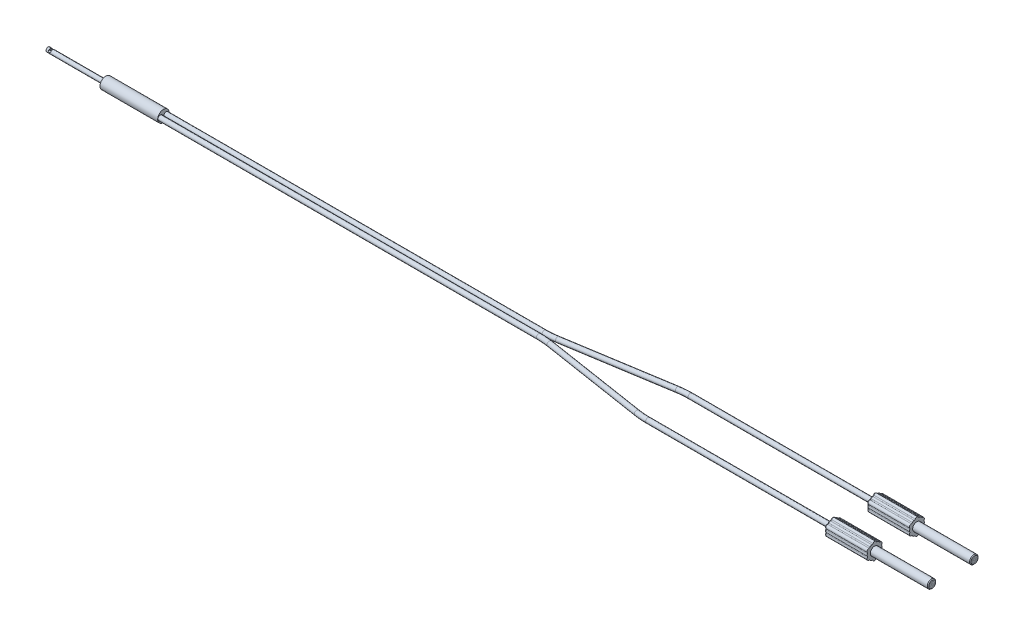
ISO-10303-21;
HEADER;
FILE_DESCRIPTION(('STEP AP214'),'2;1');
FILE_NAME('part.step','',(''),(''),'','','');
FILE_SCHEMA(('AUTOMOTIVE_DESIGN { 1 0 10303 214 1 1 1 1 }'));
ENDSEC;
DATA;
#1=APPLICATION_CONTEXT('core data for automotive mechanical design processes');
#2=APPLICATION_PROTOCOL_DEFINITION('international standard','automotive_design',2000,#1);
#3=PRODUCT_CONTEXT('',#1,'mechanical');
#4=PRODUCT('Part','Part','',(#3));
#5=PRODUCT_RELATED_PRODUCT_CATEGORY('part','',(#4));
#6=PRODUCT_DEFINITION_FORMATION('','',#4);
#7=PRODUCT_DEFINITION_CONTEXT('part definition',#1,'design');
#8=PRODUCT_DEFINITION('design','',#6,#7);
#9=PRODUCT_DEFINITION_SHAPE('','',#8);
#10=(LENGTH_UNIT() NAMED_UNIT(*) SI_UNIT(.MILLI.,.METRE.));
#11=(NAMED_UNIT(*) PLANE_ANGLE_UNIT() SI_UNIT($,.RADIAN.));
#12=(NAMED_UNIT(*) SI_UNIT($,.STERADIAN.) SOLID_ANGLE_UNIT());
#13=UNCERTAINTY_MEASURE_WITH_UNIT(LENGTH_MEASURE(1.E-05),#10,'distance_accuracy_value','');
#14=(GEOMETRIC_REPRESENTATION_CONTEXT(3) GLOBAL_UNCERTAINTY_ASSIGNED_CONTEXT((#13)) GLOBAL_UNIT_ASSIGNED_CONTEXT((#10,
#11,#12)) REPRESENTATION_CONTEXT('',''));
#15=CARTESIAN_POINT('',(0.,0.,0.));
#16=DIRECTION('',(0.,0.,1.));
#17=DIRECTION('',(1.,0.,0.));
#18=AXIS2_PLACEMENT_3D('',#15,#16,#17);
#19=CARTESIAN_POINT('',(205.5,0.,5.5));
#20=DIRECTION('',(1.,0.,0.));
#21=DIRECTION('',(0.,-0.00297522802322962,-0.99999557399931));
#22=AXIS2_PLACEMENT_3D('',#19,#20,#21);
#23=PLANE('',#22);
#24=CARTESIAN_POINT('',(205.5,0.,5.5));
#25=DIRECTION('',(1.,0.,0.));
#26=DIRECTION('',(0.,-0.00297522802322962,-0.99999557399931));
#27=AXIS2_PLACEMENT_3D('',#24,#25,#26);
#28=CIRCLE('',#27,0.9);
#29=CARTESIAN_POINT('',(205.5,-0.00267770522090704,4.60000398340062));
#30=VERTEX_POINT('',#29);
#31=EDGE_CURVE('E1267',#30,#30,#28,.T.);
#32=ORIENTED_EDGE('',*,*,#31,.T.);
#33=EDGE_LOOP('',(#32));
#34=FACE_BOUND('',#33,.T.);
#35=CARTESIAN_POINT('',(205.5,0.,5.5));
#36=DIRECTION('',(1.,0.,0.));
#37=DIRECTION('',(0.,-0.00297522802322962,-0.99999557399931));
#38=AXIS2_PLACEMENT_3D('',#35,#36,#37);
#39=CIRCLE('',#38,0.6);
#40=CARTESIAN_POINT('',(205.5,-0.00178513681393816,4.90000265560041));
#41=VERTEX_POINT('',#40);
#42=EDGE_CURVE('E31',#41,#41,#39,.F.);
#43=ORIENTED_EDGE('',*,*,#42,.T.);
#44=EDGE_LOOP('',(#43));
#45=FACE_BOUND('',#44,.T.);
#46=ADVANCED_FACE('F23',(#34,#45),#23,.T.);
#47=ORIENTED_EDGE('',*,*,#42,.F.);
#48=EDGE_LOOP('',(#47));
#49=FACE_BOUND('',#48,.T.);
#50=CARTESIAN_POINT('',(205.5,0.,5.5));
#51=DIRECTION('',(1.,0.,0.));
#52=DIRECTION('',(0.,-0.00297522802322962,-0.99999557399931));
#53=AXIS2_PLACEMENT_3D('',#50,#51,#52);
#54=CIRCLE('',#53,0.25);
#55=CARTESIAN_POINT('',(205.5,-0.000743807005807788,5.25000110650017));
#56=VERTEX_POINT('',#55);
#57=EDGE_CURVE('E1273',#56,#56,#54,.F.);
#58=ORIENTED_EDGE('',*,*,#57,.T.);
#59=EDGE_LOOP('',(#58));
#60=FACE_BOUND('',#59,.T.);
#61=ADVANCED_FACE('F1279',(#49,#60),#23,.T.);
#62=CARTESIAN_POINT('',(179.5,0.412234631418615,3.36700775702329));
#63=DIRECTION('',(1.,0.,0.));
#64=DIRECTION('',(0.,-0.00297522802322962,-0.99999557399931));
#65=AXIS2_PLACEMENT_3D('',#62,#63,#64);
#66=CYLINDRICAL_SURFACE('',#65,0.3);
#67=DIRECTION('',(1.,0.,0.));
#68=VECTOR('',#67,1.);
#69=CARTESIAN_POINT('',(179.5,0.256028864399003,3.62313225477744));
#70=LINE('',#69,#68);
#71=CARTESIAN_POINT('',(179.8,0.256028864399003,3.62313225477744));
#72=VERTEX_POINT('',#71);
#73=CARTESIAN_POINT('',(190.5,0.256028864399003,3.62313225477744));
#74=VERTEX_POINT('',#73);
#75=EDGE_CURVE('E1098',#72,#74,#70,.T.);
#76=ORIENTED_EDGE('',*,*,#75,.F.);
#77=CARTESIAN_POINT('',(179.8,0.412234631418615,3.36700775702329));
#78=DIRECTION('',(1.,0.,0.));
#79=DIRECTION('',(0.,-0.00297522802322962,-0.99999557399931));
#80=AXIS2_PLACEMENT_3D('',#77,#78,#79);
#81=CIRCLE('',#80,0.3);
#82=CARTESIAN_POINT('',(179.8,0.569961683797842,3.62219822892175));
#83=VERTEX_POINT('',#82);
#84=EDGE_CURVE('E1178',#72,#83,#81,.F.);
#85=ORIENTED_EDGE('',*,*,#84,.T.);
#86=DIRECTION('',(1.,0.,0.));
#87=VECTOR('',#86,1.);
#88=CARTESIAN_POINT('',(179.5,0.569961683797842,3.62219822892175));
#89=LINE('',#88,#87);
#90=CARTESIAN_POINT('',(190.5,0.569961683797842,3.62219822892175));
#91=VERTEX_POINT('',#90);
#92=EDGE_CURVE('E1052',#83,#91,#89,.T.);
#93=ORIENTED_EDGE('',*,*,#92,.T.);
#94=CARTESIAN_POINT('',(190.5,0.412234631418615,3.36700775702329));
#95=DIRECTION('',(1.,0.,0.));
#96=DIRECTION('',(0.,-0.00297522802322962,-0.99999557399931));
#97=AXIS2_PLACEMENT_3D('',#94,#95,#96);
#98=CIRCLE('',#97,0.3);
#99=EDGE_CURVE('E979',#91,#74,#98,.T.);
#100=ORIENTED_EDGE('',*,*,#99,.T.);
#101=EDGE_LOOP('',(#76,#85,#93,#100));
#102=FACE_BOUND('',#101,.T.);
#103=ADVANCED_FACE('F1282',(#102),#66,.F.);
#104=CARTESIAN_POINT('',(179.5,-0.00431408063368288,4.05000641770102));
#105=DIRECTION('',(1.,0.,0.));
#106=DIRECTION('',(0.,-0.00297522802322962,-0.99999557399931));
#107=AXIS2_PLACEMENT_3D('',#104,#105,#106);
#108=CYLINDRICAL_SURFACE('',#107,0.5);
#109=DIRECTION('',(1.,0.,0.));
#110=VECTOR('',#109,1.);
#111=CARTESIAN_POINT('',(179.5,-0.267192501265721,3.62468896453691));
#112=LINE('',#111,#110);
#113=CARTESIAN_POINT('',(179.8,-0.267192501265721,3.62468896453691));
#114=VERTEX_POINT('',#113);
#115=CARTESIAN_POINT('',(190.5,-0.267192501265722,3.62468896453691));
#116=VERTEX_POINT('',#115);
#117=EDGE_CURVE('E1096',#114,#116,#112,.T.);
#118=ORIENTED_EDGE('',*,*,#117,.F.);
#119=CARTESIAN_POINT('',(179.8,-0.00431408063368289,4.05000641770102));
#120=DIRECTION('',(1.,0.,0.));
#121=DIRECTION('',(0.,-0.00297522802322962,-0.99999557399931));
#122=AXIS2_PLACEMENT_3D('',#119,#120,#121);
#123=CIRCLE('',#122,0.5);
#124=EDGE_CURVE('E1176',#114,#72,#123,.T.);
#125=ORIENTED_EDGE('',*,*,#124,.T.);
#126=ORIENTED_EDGE('',*,*,#75,.T.);
#127=CARTESIAN_POINT('',(190.5,-0.00431408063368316,4.05000641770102));
#128=DIRECTION('',(-1.,0.,0.));
#129=DIRECTION('',(0.,0.00297522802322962,0.99999557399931));
#130=AXIS2_PLACEMENT_3D('',#127,#128,#129);
#131=CIRCLE('',#130,0.5);
#132=EDGE_CURVE('E982',#74,#116,#131,.T.);
#133=ORIENTED_EDGE('',*,*,#132,.T.);
#134=EDGE_LOOP('',(#118,#125,#126,#133));
#135=FACE_BOUND('',#134,.T.);
#136=ADVANCED_FACE('F1321',(#135),#108,.T.);
#137=CARTESIAN_POINT('',(179.5,-0.424919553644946,3.36949849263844));
#138=DIRECTION('',(1.,0.,0.));
#139=DIRECTION('',(0.,-0.00297522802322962,-0.99999557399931));
#140=AXIS2_PLACEMENT_3D('',#137,#138,#139);
#141=CYLINDRICAL_SURFACE('',#140,0.3);
#142=DIRECTION('',(1.,0.,0.));
#143=VECTOR('',#142,1.);
#144=CARTESIAN_POINT('',(179.5,-0.581125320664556,3.62562299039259));
#145=LINE('',#144,#143);
#146=CARTESIAN_POINT('',(179.8,-0.581125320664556,3.62562299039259));
#147=VERTEX_POINT('',#146);
#148=CARTESIAN_POINT('',(190.5,-0.581125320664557,3.62562299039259));
#149=VERTEX_POINT('',#148);
#150=EDGE_CURVE('E1094',#147,#149,#145,.T.);
#151=ORIENTED_EDGE('',*,*,#150,.F.);
#152=CARTESIAN_POINT('',(179.8,-0.424919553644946,3.36949849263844));
#153=DIRECTION('',(1.,0.,0.));
#154=DIRECTION('',(0.,-0.00297522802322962,-0.99999557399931));
#155=AXIS2_PLACEMENT_3D('',#152,#153,#154);
#156=CIRCLE('',#155,0.3);
#157=EDGE_CURVE('E1174',#147,#114,#156,.F.);
#158=ORIENTED_EDGE('',*,*,#157,.T.);
#159=ORIENTED_EDGE('',*,*,#117,.T.);
#160=CARTESIAN_POINT('',(190.5,-0.424919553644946,3.36949849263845));
#161=DIRECTION('',(1.,0.,0.));
#162=DIRECTION('',(0.,-0.00297522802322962,-0.99999557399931));
#163=AXIS2_PLACEMENT_3D('',#160,#161,#162);
#164=CIRCLE('',#163,0.3);
#165=EDGE_CURVE('E986',#116,#149,#164,.T.);
#166=ORIENTED_EDGE('',*,*,#165,.T.);
#167=EDGE_LOOP('',(#151,#158,#159,#166));
#168=FACE_BOUND('',#167,.T.);
#169=ADVANCED_FACE('F1330',(#168),#141,.F.);
#170=CARTESIAN_POINT('',(179.5,-0.841468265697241,4.05249715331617));
#171=DIRECTION('',(1.,0.,0.));
#172=DIRECTION('',(0.,-0.00297522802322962,-0.99999557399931));
#173=AXIS2_PLACEMENT_3D('',#170,#171,#172);
#174=CYLINDRICAL_SURFACE('',#173,0.5);
#175=DIRECTION('',(1.,0.,0.));
#176=VECTOR('',#175,1.);
#177=CARTESIAN_POINT('',(179.5,-1.34124319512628,4.06749781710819));
#178=LINE('',#177,#176);
#179=CARTESIAN_POINT('',(179.8,-1.34124319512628,4.06749781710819));
#180=VERTEX_POINT('',#179);
#181=CARTESIAN_POINT('',(190.5,-1.34124319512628,4.0674978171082));
#182=VERTEX_POINT('',#181);
#183=EDGE_CURVE('E1092',#180,#182,#178,.T.);
#184=ORIENTED_EDGE('',*,*,#183,.F.);
#185=CARTESIAN_POINT('',(179.8,-0.841468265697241,4.05249715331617));
#186=DIRECTION('',(1.,0.,0.));
#187=DIRECTION('',(0.,-0.00297522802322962,-0.99999557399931));
#188=AXIS2_PLACEMENT_3D('',#185,#186,#187);
#189=CIRCLE('',#188,0.5);
#190=EDGE_CURVE('E1172',#180,#147,#189,.T.);
#191=ORIENTED_EDGE('',*,*,#190,.T.);
#192=ORIENTED_EDGE('',*,*,#150,.T.);
#193=CARTESIAN_POINT('',(190.5,-0.841468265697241,4.05249715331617));
#194=DIRECTION('',(-1.,0.,0.));
#195=DIRECTION('',(0.,-0.00297522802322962,-0.99999557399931));
#196=AXIS2_PLACEMENT_3D('',#193,#194,#195);
#197=CIRCLE('',#196,0.5);
#198=EDGE_CURVE('E989',#149,#182,#197,.T.);
#199=ORIENTED_EDGE('',*,*,#198,.T.);
#200=EDGE_LOOP('',(#184,#191,#192,#199));
#201=FACE_BOUND('',#200,.T.);
#202=ADVANCED_FACE('F1339',(#201),#174,.T.);
#203=CARTESIAN_POINT('',(179.5,-1.6411081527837,4.07649821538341));
#204=DIRECTION('',(1.,0.,0.));
#205=DIRECTION('',(0.,-0.00297522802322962,-0.99999557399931));
#206=AXIS2_PLACEMENT_3D('',#203,#204,#205);
#207=CYLINDRICAL_SURFACE('',#206,0.3);
#208=DIRECTION('',(1.,0.,0.));
#209=VECTOR('',#208,1.);
#210=CARTESIAN_POINT('',(179.5,-1.49740071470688,4.3398386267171));
#211=LINE('',#210,#209);
#212=CARTESIAN_POINT('',(179.8,-1.49740071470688,4.3398386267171));
#213=VERTEX_POINT('',#212);
#214=CARTESIAN_POINT('',(190.5,-1.49740071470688,4.3398386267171));
#215=VERTEX_POINT('',#214);
#216=EDGE_CURVE('E1090',#213,#215,#211,.T.);
#217=ORIENTED_EDGE('',*,*,#216,.F.);
#218=CARTESIAN_POINT('',(179.8,-1.6411081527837,4.07649821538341));
#219=DIRECTION('',(1.,0.,0.));
#220=DIRECTION('',(0.,-0.00297522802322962,-0.99999557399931));
#221=AXIS2_PLACEMENT_3D('',#218,#219,#220);
#222=CIRCLE('',#221,0.3);
#223=EDGE_CURVE('E1170',#213,#180,#222,.F.);
#224=ORIENTED_EDGE('',*,*,#223,.T.);
#225=ORIENTED_EDGE('',*,*,#183,.T.);
#226=CARTESIAN_POINT('',(190.5,-1.6411081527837,4.07649821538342));
#227=DIRECTION('',(1.,0.,0.));
#228=DIRECTION('',(0.,-0.00297522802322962,-0.99999557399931));
#229=AXIS2_PLACEMENT_3D('',#226,#227,#228);
#230=CIRCLE('',#229,0.3);
#231=EDGE_CURVE('E992',#182,#215,#230,.T.);
#232=ORIENTED_EDGE('',*,*,#231,.T.);
#233=EDGE_LOOP('',(#217,#224,#225,#232));
#234=FACE_BOUND('',#233,.T.);
#235=ADVANCED_FACE('F1348',(#234),#207,.F.);
#236=CARTESIAN_POINT('',(179.5,-1.25788831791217,4.77873931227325));
#237=DIRECTION('',(1.,0.,0.));
#238=DIRECTION('',(0.,-0.00297522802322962,-0.99999557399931));
#239=AXIS2_PLACEMENT_3D('',#236,#237,#238);
#240=CYLINDRICAL_SURFACE('',#239,0.500000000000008);
#241=DIRECTION('',(1.,0.,0.));
#242=VECTOR('',#241,1.);
#243=CARTESIAN_POINT('',(179.5,-1.75766324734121,4.79373997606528));
#244=LINE('',#243,#242);
#245=CARTESIAN_POINT('',(179.8,-1.75766324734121,4.79373997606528));
#246=VERTEX_POINT('',#245);
#247=CARTESIAN_POINT('',(190.5,-1.75766324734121,4.79373997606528));
#248=VERTEX_POINT('',#247);
#249=EDGE_CURVE('E1088',#246,#248,#244,.T.);
#250=ORIENTED_EDGE('',*,*,#249,.F.);
#251=CARTESIAN_POINT('',(179.8,-1.25788831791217,4.77873931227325));
#252=DIRECTION('',(1.,0.,0.));
#253=DIRECTION('',(0.,-0.00297522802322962,-0.99999557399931));
#254=AXIS2_PLACEMENT_3D('',#251,#252,#253);
#255=CIRCLE('',#254,0.500000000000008);
#256=EDGE_CURVE('E1168',#246,#213,#255,.T.);
#257=ORIENTED_EDGE('',*,*,#256,.T.);
#258=ORIENTED_EDGE('',*,*,#216,.T.);
#259=CARTESIAN_POINT('',(190.5,-1.25788831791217,4.77873931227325));
#260=DIRECTION('',(-1.,0.,0.));
#261=DIRECTION('',(0.,0.00297522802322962,0.99999557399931));
#262=AXIS2_PLACEMENT_3D('',#259,#260,#261);
#263=CIRCLE('',#262,0.500000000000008);
#264=EDGE_CURVE('E995',#215,#248,#263,.T.);
#265=ORIENTED_EDGE('',*,*,#264,.T.);
#266=EDGE_LOOP('',(#250,#257,#258,#265));
#267=FACE_BOUND('',#266,.T.);
#268=ADVANCED_FACE('F1357',(#267),#240,.T.);
#269=CARTESIAN_POINT('',(179.5,-2.05752820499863,4.80274037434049));
#270=DIRECTION('',(1.,0.,0.));
#271=DIRECTION('',(0.,-0.00297522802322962,-0.99999557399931));
#272=AXIS2_PLACEMENT_3D('',#269,#270,#271);
#273=CYLINDRICAL_SURFACE('',#272,0.3);
#274=DIRECTION('',(1.,0.,0.));
#275=VECTOR('',#274,1.);
#276=CARTESIAN_POINT('',(179.5,-1.91382076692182,5.06608078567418));
#277=LINE('',#276,#275);
#278=CARTESIAN_POINT('',(179.8,-1.91382076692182,5.06608078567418));
#279=VERTEX_POINT('',#278);
#280=CARTESIAN_POINT('',(190.5,-1.91382076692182,5.06608078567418));
#281=VERTEX_POINT('',#280);
#282=EDGE_CURVE('E1086',#279,#281,#277,.T.);
#283=ORIENTED_EDGE('',*,*,#282,.F.);
#284=CARTESIAN_POINT('',(179.8,-2.05752820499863,4.80274037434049));
#285=DIRECTION('',(1.,0.,0.));
#286=DIRECTION('',(0.,-0.00297522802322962,-0.99999557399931));
#287=AXIS2_PLACEMENT_3D('',#284,#285,#286);
#288=CIRCLE('',#287,0.3);
#289=EDGE_CURVE('E1166',#279,#246,#288,.F.);
#290=ORIENTED_EDGE('',*,*,#289,.T.);
#291=ORIENTED_EDGE('',*,*,#249,.T.);
#292=CARTESIAN_POINT('',(190.5,-2.05752820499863,4.80274037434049));
#293=DIRECTION('',(1.,0.,0.));
#294=DIRECTION('',(0.,-0.00297522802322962,-0.99999557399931));
#295=AXIS2_PLACEMENT_3D('',#292,#293,#294);
#296=CIRCLE('',#295,0.3);
#297=EDGE_CURVE('E998',#248,#281,#296,.T.);
#298=ORIENTED_EDGE('',*,*,#297,.T.);
#299=EDGE_LOOP('',(#283,#290,#291,#298));
#300=FACE_BOUND('',#299,.T.);
#301=ADVANCED_FACE('F1366',(#300),#273,.F.);
#302=CARTESIAN_POINT('',(179.5,-1.67430837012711,5.50498147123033));
#303=DIRECTION('',(1.,0.,0.));
#304=DIRECTION('',(0.,-0.00297522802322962,-0.99999557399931));
#305=AXIS2_PLACEMENT_3D('',#302,#303,#304);
#306=CYLINDRICAL_SURFACE('',#305,0.5);
#307=DIRECTION('',(1.,0.,0.));
#308=VECTOR('',#307,1.);
#309=CARTESIAN_POINT('',(179.5,-1.9112048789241,5.94529958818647));
#310=LINE('',#309,#308);
#311=CARTESIAN_POINT('',(179.8,-1.9112048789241,5.94529958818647));
#312=VERTEX_POINT('',#311);
#313=CARTESIAN_POINT('',(190.5,-1.9112048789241,5.94529958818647));
#314=VERTEX_POINT('',#313);
#315=EDGE_CURVE('E1084',#312,#314,#310,.T.);
#316=ORIENTED_EDGE('',*,*,#315,.F.);
#317=CARTESIAN_POINT('',(179.8,-1.67430837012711,5.50498147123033));
#318=DIRECTION('',(1.,0.,0.));
#319=DIRECTION('',(0.,-0.00297522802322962,-0.99999557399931));
#320=AXIS2_PLACEMENT_3D('',#317,#318,#319);
#321=CIRCLE('',#320,0.5);
#322=EDGE_CURVE('E1164',#312,#279,#321,.T.);
#323=ORIENTED_EDGE('',*,*,#322,.T.);
#324=ORIENTED_EDGE('',*,*,#282,.T.);
#325=CARTESIAN_POINT('',(190.5,-1.67430837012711,5.50498147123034));
#326=DIRECTION('',(-1.,0.,0.));
#327=DIRECTION('',(0.,0.00297522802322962,0.99999557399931));
#328=AXIS2_PLACEMENT_3D('',#325,#326,#327);
#329=CIRCLE('',#328,0.5);
#330=EDGE_CURVE('E1001',#281,#314,#329,.T.);
#331=ORIENTED_EDGE('',*,*,#330,.T.);
#332=EDGE_LOOP('',(#316,#323,#324,#331));
#333=FACE_BOUND('',#332,.T.);
#334=ADVANCED_FACE('F1375',(#333),#306,.T.);
#335=CARTESIAN_POINT('',(179.5,-2.0533427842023,6.20949045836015));
#336=DIRECTION('',(1.,0.,0.));
#337=DIRECTION('',(0.,-0.00297522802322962,-0.99999557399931));
#338=AXIS2_PLACEMENT_3D('',#335,#336,#337);
#339=CYLINDRICAL_SURFACE('',#338,0.3);
#340=DIRECTION('',(1.,0.,0.));
#341=VECTOR('',#340,1.);
#342=CARTESIAN_POINT('',(179.5,-1.75342957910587,6.21670637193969));
#343=LINE('',#342,#341);
#344=CARTESIAN_POINT('',(179.8,-1.75342957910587,6.21670637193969));
#345=VERTEX_POINT('',#344);
#346=CARTESIAN_POINT('',(190.5,-1.75342957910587,6.21670637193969));
#347=VERTEX_POINT('',#346);
#348=EDGE_CURVE('E1082',#345,#347,#343,.T.);
#349=ORIENTED_EDGE('',*,*,#348,.F.);
#350=CARTESIAN_POINT('',(179.8,-2.0533427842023,6.20949045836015));
#351=DIRECTION('',(1.,0.,0.));
#352=DIRECTION('',(0.,-0.00297522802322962,-0.99999557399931));
#353=AXIS2_PLACEMENT_3D('',#350,#351,#352);
#354=CIRCLE('',#353,0.3);
#355=EDGE_CURVE('E1162',#345,#312,#354,.F.);
#356=ORIENTED_EDGE('',*,*,#355,.T.);
#357=ORIENTED_EDGE('',*,*,#315,.T.);
#358=CARTESIAN_POINT('',(190.5,-2.0533427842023,6.20949045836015));
#359=DIRECTION('',(1.,0.,0.));
#360=DIRECTION('',(0.,-0.00297522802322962,-0.99999557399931));
#361=AXIS2_PLACEMENT_3D('',#358,#359,#360);
#362=CIRCLE('',#361,0.3);
#363=EDGE_CURVE('E1004',#314,#347,#362,.T.);
#364=ORIENTED_EDGE('',*,*,#363,.T.);
#365=EDGE_LOOP('',(#349,#356,#357,#364));
#366=FACE_BOUND('',#365,.T.);
#367=ADVANCED_FACE('F1384',(#366),#339,.F.);
#368=CARTESIAN_POINT('',(179.5,-1.25357423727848,6.22873289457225));
#369=DIRECTION('',(1.,0.,0.));
#370=DIRECTION('',(0.,-0.00297522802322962,-0.99999557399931));
#371=AXIS2_PLACEMENT_3D('',#368,#369,#370);
#372=CYLINDRICAL_SURFACE('',#371,0.500000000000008);
#373=DIRECTION('',(1.,0.,0.));
#374=VECTOR('',#373,1.);
#375=CARTESIAN_POINT('',(179.5,-1.49047074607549,6.66905101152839));
#376=LINE('',#375,#374);
#377=CARTESIAN_POINT('',(179.8,-1.49047074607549,6.66905101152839));
#378=VERTEX_POINT('',#377);
#379=CARTESIAN_POINT('',(190.5,-1.49047074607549,6.66905101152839));
#380=VERTEX_POINT('',#379);
#381=EDGE_CURVE('E1080',#378,#380,#376,.T.);
#382=ORIENTED_EDGE('',*,*,#381,.F.);
#383=CARTESIAN_POINT('',(179.8,-1.25357423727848,6.22873289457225));
#384=DIRECTION('',(1.,0.,0.));
#385=DIRECTION('',(0.,-0.00297522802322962,-0.99999557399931));
#386=AXIS2_PLACEMENT_3D('',#383,#384,#385);
#387=CIRCLE('',#386,0.500000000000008);
#388=EDGE_CURVE('E1160',#378,#345,#387,.T.);
#389=ORIENTED_EDGE('',*,*,#388,.T.);
#390=ORIENTED_EDGE('',*,*,#348,.T.);
#391=CARTESIAN_POINT('',(190.5,-1.25357423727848,6.22873289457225));
#392=DIRECTION('',(-1.,0.,0.));
#393=DIRECTION('',(0.,-0.00297522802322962,-0.99999557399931));
#394=AXIS2_PLACEMENT_3D('',#391,#392,#393);
#395=CIRCLE('',#394,0.500000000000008);
#396=EDGE_CURVE('E1007',#347,#380,#395,.T.);
#397=ORIENTED_EDGE('',*,*,#396,.T.);
#398=EDGE_LOOP('',(#382,#389,#390,#397));
#399=FACE_BOUND('',#398,.T.);
#400=ADVANCED_FACE('F1393',(#399),#372,.T.);
#401=CARTESIAN_POINT('',(179.5,-1.63260865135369,6.93324188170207));
#402=DIRECTION('',(1.,0.,0.));
#403=DIRECTION('',(0.,-0.00297522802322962,-0.99999557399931));
#404=AXIS2_PLACEMENT_3D('',#401,#402,#403);
#405=CYLINDRICAL_SURFACE('',#404,0.3);
#406=DIRECTION('',(1.,0.,0.));
#407=VECTOR('',#406,1.);
#408=CARTESIAN_POINT('',(179.5,-1.33269544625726,6.94045779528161));
#409=LINE('',#408,#407);
#410=CARTESIAN_POINT('',(179.8,-1.33269544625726,6.94045779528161));
#411=VERTEX_POINT('',#410);
#412=CARTESIAN_POINT('',(190.5,-1.33269544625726,6.94045779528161));
#413=VERTEX_POINT('',#412);
#414=EDGE_CURVE('E1078',#411,#413,#409,.T.);
#415=ORIENTED_EDGE('',*,*,#414,.F.);
#416=CARTESIAN_POINT('',(179.8,-1.63260865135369,6.93324188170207));
#417=DIRECTION('',(1.,0.,0.));
#418=DIRECTION('',(0.,-0.00297522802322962,-0.99999557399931));
#419=AXIS2_PLACEMENT_3D('',#416,#417,#418);
#420=CIRCLE('',#419,0.3);
#421=EDGE_CURVE('E1158',#411,#378,#420,.F.);
#422=ORIENTED_EDGE('',*,*,#421,.T.);
#423=ORIENTED_EDGE('',*,*,#381,.T.);
#424=CARTESIAN_POINT('',(190.5,-1.63260865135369,6.93324188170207));
#425=DIRECTION('',(1.,0.,0.));
#426=DIRECTION('',(0.,-0.00297522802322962,-0.99999557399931));
#427=AXIS2_PLACEMENT_3D('',#424,#425,#426);
#428=CIRCLE('',#427,0.3);
#429=EDGE_CURVE('E1010',#380,#413,#428,.T.);
#430=ORIENTED_EDGE('',*,*,#429,.T.);
#431=EDGE_LOOP('',(#415,#422,#423,#430));
#432=FACE_BOUND('',#431,.T.);
#433=ADVANCED_FACE('F1402',(#432),#405,.F.);
#434=CARTESIAN_POINT('',(179.5,-0.832840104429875,6.95248431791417));
#435=DIRECTION('',(1.,0.,0.));
#436=DIRECTION('',(0.,-0.00297522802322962,-0.99999557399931));
#437=AXIS2_PLACEMENT_3D('',#434,#435,#436);
#438=CYLINDRICAL_SURFACE('',#437,0.5);
#439=DIRECTION('',(1.,0.,0.));
#440=VECTOR('',#439,1.);
#441=CARTESIAN_POINT('',(179.5,-0.569961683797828,7.37780177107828));
#442=LINE('',#441,#440);
#443=CARTESIAN_POINT('',(179.8,-0.569961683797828,7.37780177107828));
#444=VERTEX_POINT('',#443);
#445=CARTESIAN_POINT('',(190.5,-0.569961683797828,7.37780177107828));
#446=VERTEX_POINT('',#445);
#447=EDGE_CURVE('E1076',#444,#446,#442,.T.);
#448=ORIENTED_EDGE('',*,*,#447,.F.);
#449=CARTESIAN_POINT('',(179.8,-0.832840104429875,6.95248431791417));
#450=DIRECTION('',(1.,0.,0.));
#451=DIRECTION('',(0.,-0.00297522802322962,-0.99999557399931));
#452=AXIS2_PLACEMENT_3D('',#449,#450,#451);
#453=CIRCLE('',#452,0.5);
#454=EDGE_CURVE('E1156',#444,#411,#453,.T.);
#455=ORIENTED_EDGE('',*,*,#454,.T.);
#456=ORIENTED_EDGE('',*,*,#414,.T.);
#457=CARTESIAN_POINT('',(190.5,-0.832840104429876,6.95248431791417));
#458=DIRECTION('',(-1.,0.,0.));
#459=DIRECTION('',(0.,0.00297522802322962,0.99999557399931));
#460=AXIS2_PLACEMENT_3D('',#457,#458,#459);
#461=CIRCLE('',#460,0.5);
#462=EDGE_CURVE('E1013',#413,#446,#461,.T.);
#463=ORIENTED_EDGE('',*,*,#462,.T.);
#464=EDGE_LOOP('',(#448,#455,#456,#463));
#465=FACE_BOUND('',#464,.T.);
#466=ADVANCED_FACE('F1411',(#465),#438,.T.);
#467=CARTESIAN_POINT('',(179.5,-0.4122346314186,7.63299224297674));
#468=DIRECTION('',(1.,0.,0.));
#469=DIRECTION('',(0.,-0.00297522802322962,-0.99999557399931));
#470=AXIS2_PLACEMENT_3D('',#467,#468,#469);
#471=CYLINDRICAL_SURFACE('',#470,0.3);
#472=DIRECTION('',(1.,0.,0.));
#473=VECTOR('',#472,1.);
#474=CARTESIAN_POINT('',(179.5,-0.256028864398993,7.37686774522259));
#475=LINE('',#474,#473);
#476=CARTESIAN_POINT('',(179.8,-0.256028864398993,7.37686774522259));
#477=VERTEX_POINT('',#476);
#478=CARTESIAN_POINT('',(190.5,-0.256028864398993,7.37686774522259));
#479=VERTEX_POINT('',#478);
#480=EDGE_CURVE('E1074',#477,#479,#475,.T.);
#481=ORIENTED_EDGE('',*,*,#480,.F.);
#482=CARTESIAN_POINT('',(179.8,-0.4122346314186,7.63299224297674));
#483=DIRECTION('',(1.,0.,0.));
#484=DIRECTION('',(0.,-0.00297522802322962,-0.99999557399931));
#485=AXIS2_PLACEMENT_3D('',#482,#483,#484);
#486=CIRCLE('',#485,0.3);
#487=EDGE_CURVE('E1154',#477,#444,#486,.F.);
#488=ORIENTED_EDGE('',*,*,#487,.T.);
#489=ORIENTED_EDGE('',*,*,#447,.T.);
#490=CARTESIAN_POINT('',(190.5,-0.4122346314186,7.63299224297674));
#491=DIRECTION('',(1.,0.,0.));
#492=DIRECTION('',(0.,-0.00297522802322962,-0.99999557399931));
#493=AXIS2_PLACEMENT_3D('',#490,#491,#492);
#494=CIRCLE('',#493,0.3);
#495=EDGE_CURVE('E1016',#446,#479,#494,.T.);
#496=ORIENTED_EDGE('',*,*,#495,.T.);
#497=EDGE_LOOP('',(#481,#488,#489,#496));
#498=FACE_BOUND('',#497,.T.);
#499=ADVANCED_FACE('F1420',(#498),#471,.F.);
#500=CARTESIAN_POINT('',(179.5,0.00431408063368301,6.949993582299));
#501=DIRECTION('',(1.,0.,0.));
#502=DIRECTION('',(0.,-0.00297522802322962,-0.99999557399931));
#503=AXIS2_PLACEMENT_3D('',#500,#501,#502);
#504=CYLINDRICAL_SURFACE('',#503,0.5);
#505=DIRECTION('',(1.,0.,0.));
#506=VECTOR('',#505,1.);
#507=CARTESIAN_POINT('',(179.5,0.267192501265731,7.3753110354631));
#508=LINE('',#507,#506);
#509=CARTESIAN_POINT('',(179.8,0.267192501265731,7.3753110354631));
#510=VERTEX_POINT('',#509);
#511=CARTESIAN_POINT('',(190.5,0.267192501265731,7.37531103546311));
#512=VERTEX_POINT('',#511);
#513=EDGE_CURVE('E1072',#510,#512,#508,.T.);
#514=ORIENTED_EDGE('',*,*,#513,.F.);
#515=CARTESIAN_POINT('',(179.8,0.004314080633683,6.949993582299));
#516=DIRECTION('',(1.,0.,0.));
#517=DIRECTION('',(0.,-0.00297522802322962,-0.99999557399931));
#518=AXIS2_PLACEMENT_3D('',#515,#516,#517);
#519=CIRCLE('',#518,0.5);
#520=EDGE_CURVE('E1152',#510,#477,#519,.T.);
#521=ORIENTED_EDGE('',*,*,#520,.T.);
#522=ORIENTED_EDGE('',*,*,#480,.T.);
#523=CARTESIAN_POINT('',(190.5,0.00431408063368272,6.94999358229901));
#524=DIRECTION('',(-1.,0.,0.));
#525=DIRECTION('',(0.,-0.00297522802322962,-0.99999557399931));
#526=AXIS2_PLACEMENT_3D('',#523,#524,#525);
#527=CIRCLE('',#526,0.5);
#528=EDGE_CURVE('E1019',#479,#512,#527,.T.);
#529=ORIENTED_EDGE('',*,*,#528,.T.);
#530=EDGE_LOOP('',(#514,#521,#522,#529));
#531=FACE_BOUND('',#530,.T.);
#532=ADVANCED_FACE('F1429',(#531),#504,.T.);
#533=CARTESIAN_POINT('',(179.5,0.42491955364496,7.63050150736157));
#534=DIRECTION('',(1.,0.,0.));
#535=DIRECTION('',(0.,-0.00297522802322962,-0.99999557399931));
#536=AXIS2_PLACEMENT_3D('',#533,#534,#535);
#537=CYLINDRICAL_SURFACE('',#536,0.3);
#538=DIRECTION('',(1.,0.,0.));
#539=VECTOR('',#538,1.);
#540=CARTESIAN_POINT('',(179.5,0.58112532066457,7.37437700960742));
#541=LINE('',#540,#539);
#542=CARTESIAN_POINT('',(179.8,0.58112532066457,7.37437700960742));
#543=VERTEX_POINT('',#542);
#544=CARTESIAN_POINT('',(190.5,0.58112532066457,7.37437700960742));
#545=VERTEX_POINT('',#544);
#546=EDGE_CURVE('E1070',#543,#545,#541,.T.);
#547=ORIENTED_EDGE('',*,*,#546,.F.);
#548=CARTESIAN_POINT('',(179.8,0.42491955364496,7.63050150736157));
#549=DIRECTION('',(1.,0.,0.));
#550=DIRECTION('',(0.,-0.00297522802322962,-0.99999557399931));
#551=AXIS2_PLACEMENT_3D('',#548,#549,#550);
#552=CIRCLE('',#551,0.3);
#553=EDGE_CURVE('E1149',#543,#510,#552,.F.);
#554=ORIENTED_EDGE('',*,*,#553,.T.);
#555=ORIENTED_EDGE('',*,*,#513,.T.);
#556=CARTESIAN_POINT('',(190.5,0.42491955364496,7.63050150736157));
#557=DIRECTION('',(1.,0.,0.));
#558=DIRECTION('',(0.,-0.00297522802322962,-0.99999557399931));
#559=AXIS2_PLACEMENT_3D('',#556,#557,#558);
#560=CIRCLE('',#559,0.3);
#561=EDGE_CURVE('E1022',#512,#545,#560,.T.);
#562=ORIENTED_EDGE('',*,*,#561,.T.);
#563=EDGE_LOOP('',(#547,#554,#555,#562));
#564=FACE_BOUND('',#563,.T.);
#565=ADVANCED_FACE('F1438',(#564),#537,.F.);
#566=CARTESIAN_POINT('',(179.5,0.841468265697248,6.94750284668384));
#567=DIRECTION('',(1.,0.,0.));
#568=DIRECTION('',(0.,-0.00297522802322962,-0.99999557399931));
#569=AXIS2_PLACEMENT_3D('',#566,#567,#568);
#570=CYLINDRICAL_SURFACE('',#569,0.499999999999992);
#571=DIRECTION('',(1.,0.,0.));
#572=VECTOR('',#571,1.);
#573=CARTESIAN_POINT('',(179.5,1.34124319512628,6.93250218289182));
#574=LINE('',#573,#572);
#575=CARTESIAN_POINT('',(179.8,1.34124319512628,6.93250218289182));
#576=VERTEX_POINT('',#575);
#577=CARTESIAN_POINT('',(190.5,1.34124319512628,6.93250218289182));
#578=VERTEX_POINT('',#577);
#579=EDGE_CURVE('E1068',#576,#578,#574,.T.);
#580=ORIENTED_EDGE('',*,*,#579,.F.);
#581=CARTESIAN_POINT('',(179.8,0.841468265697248,6.94750284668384));
#582=DIRECTION('',(1.,0.,0.));
#583=DIRECTION('',(0.,-0.00297522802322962,-0.99999557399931));
#584=AXIS2_PLACEMENT_3D('',#581,#582,#583);
#585=CIRCLE('',#584,0.499999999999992);
#586=EDGE_CURVE('E1194',#576,#543,#585,.T.);
#587=ORIENTED_EDGE('',*,*,#586,.T.);
#588=ORIENTED_EDGE('',*,*,#546,.T.);
#589=CARTESIAN_POINT('',(190.5,0.841468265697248,6.94750284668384));
#590=DIRECTION('',(-1.,0.,0.));
#591=DIRECTION('',(0.,-0.00297522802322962,-0.99999557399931));
#592=AXIS2_PLACEMENT_3D('',#589,#590,#591);
#593=CIRCLE('',#592,0.499999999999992);
#594=EDGE_CURVE('E1025',#545,#578,#593,.T.);
#595=ORIENTED_EDGE('',*,*,#594,.T.);
#596=EDGE_LOOP('',(#580,#587,#588,#595));
#597=FACE_BOUND('',#596,.T.);
#598=ADVANCED_FACE('F1447',(#597),#570,.T.);
#599=CARTESIAN_POINT('',(179.5,1.6411081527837,6.9235017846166));
#600=DIRECTION('',(1.,0.,0.));
#601=DIRECTION('',(0.,-0.00297522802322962,-0.99999557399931));
#602=AXIS2_PLACEMENT_3D('',#599,#600,#601);
#603=CYLINDRICAL_SURFACE('',#602,0.3);
#604=DIRECTION('',(1.,0.,0.));
#605=VECTOR('',#604,1.);
#606=CARTESIAN_POINT('',(179.5,1.49740071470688,6.66016137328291));
#607=LINE('',#606,#605);
#608=CARTESIAN_POINT('',(179.8,1.49740071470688,6.66016137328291));
#609=VERTEX_POINT('',#608);
#610=CARTESIAN_POINT('',(190.5,1.49740071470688,6.66016137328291));
#611=VERTEX_POINT('',#610);
#612=EDGE_CURVE('E1066',#609,#611,#607,.T.);
#613=ORIENTED_EDGE('',*,*,#612,.F.);
#614=CARTESIAN_POINT('',(179.8,1.6411081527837,6.9235017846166));
#615=DIRECTION('',(1.,0.,0.));
#616=DIRECTION('',(0.,-0.00297522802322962,-0.99999557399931));
#617=AXIS2_PLACEMENT_3D('',#614,#615,#616);
#618=CIRCLE('',#617,0.3);
#619=EDGE_CURVE('E38',#609,#576,#618,.F.);
#620=ORIENTED_EDGE('',*,*,#619,.T.);
#621=ORIENTED_EDGE('',*,*,#579,.T.);
#622=CARTESIAN_POINT('',(190.5,1.6411081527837,6.9235017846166));
#623=DIRECTION('',(1.,0.,0.));
#624=DIRECTION('',(0.,-0.00297522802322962,-0.99999557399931));
#625=AXIS2_PLACEMENT_3D('',#622,#623,#624);
#626=CIRCLE('',#625,0.3);
#627=EDGE_CURVE('E1028',#578,#611,#626,.T.);
#628=ORIENTED_EDGE('',*,*,#627,.T.);
#629=EDGE_LOOP('',(#613,#620,#621,#628));
#630=FACE_BOUND('',#629,.T.);
#631=ADVANCED_FACE('F1456',(#630),#603,.F.);
#632=CARTESIAN_POINT('',(179.5,1.25788831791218,6.22126068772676));
#633=DIRECTION('',(1.,0.,0.));
#634=DIRECTION('',(0.,-0.00297522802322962,-0.99999557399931));
#635=AXIS2_PLACEMENT_3D('',#632,#633,#634);
#636=CYLINDRICAL_SURFACE('',#635,0.5);
#637=DIRECTION('',(1.,0.,0.));
#638=VECTOR('',#637,1.);
#639=CARTESIAN_POINT('',(179.5,1.75766324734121,6.20626002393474));
#640=LINE('',#639,#638);
#641=CARTESIAN_POINT('',(179.8,1.75766324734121,6.20626002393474));
#642=VERTEX_POINT('',#641);
#643=CARTESIAN_POINT('',(190.5,1.75766324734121,6.20626002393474));
#644=VERTEX_POINT('',#643);
#645=EDGE_CURVE('E1064',#642,#644,#640,.T.);
#646=ORIENTED_EDGE('',*,*,#645,.F.);
#647=CARTESIAN_POINT('',(179.8,1.25788831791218,6.22126068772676));
#648=DIRECTION('',(1.,0.,0.));
#649=DIRECTION('',(0.,-0.00297522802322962,-0.99999557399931));
#650=AXIS2_PLACEMENT_3D('',#647,#648,#649);
#651=CIRCLE('',#650,0.5);
#652=EDGE_CURVE('E46',#642,#609,#651,.T.);
#653=ORIENTED_EDGE('',*,*,#652,.T.);
#654=ORIENTED_EDGE('',*,*,#612,.T.);
#655=CARTESIAN_POINT('',(190.5,1.25788831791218,6.22126068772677));
#656=DIRECTION('',(-1.,0.,0.));
#657=DIRECTION('',(0.,-0.00297522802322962,-0.99999557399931));
#658=AXIS2_PLACEMENT_3D('',#655,#656,#657);
#659=CIRCLE('',#658,0.5);
#660=EDGE_CURVE('E1031',#611,#644,#659,.T.);
#661=ORIENTED_EDGE('',*,*,#660,.T.);
#662=EDGE_LOOP('',(#646,#653,#654,#661));
#663=FACE_BOUND('',#662,.T.);
#664=ADVANCED_FACE('F1465',(#663),#636,.T.);
#665=CARTESIAN_POINT('',(179.5,2.05752820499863,6.19725962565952));
#666=DIRECTION('',(1.,0.,0.));
#667=DIRECTION('',(0.,-0.00297522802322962,-0.99999557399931));
#668=AXIS2_PLACEMENT_3D('',#665,#666,#667);
#669=CYLINDRICAL_SURFACE('',#668,0.3);
#670=DIRECTION('',(1.,0.,0.));
#671=VECTOR('',#670,1.);
#672=CARTESIAN_POINT('',(179.5,1.91382076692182,5.93391921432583));
#673=LINE('',#672,#671);
#674=CARTESIAN_POINT('',(179.8,1.91382076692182,5.93391921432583));
#675=VERTEX_POINT('',#674);
#676=CARTESIAN_POINT('',(190.5,1.91382076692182,5.93391921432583));
#677=VERTEX_POINT('',#676);
#678=EDGE_CURVE('E1062',#675,#677,#673,.T.);
#679=ORIENTED_EDGE('',*,*,#678,.F.);
#680=CARTESIAN_POINT('',(179.8,2.05752820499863,6.19725962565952));
#681=DIRECTION('',(1.,0.,0.));
#682=DIRECTION('',(0.,-0.00297522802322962,-0.99999557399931));
#683=AXIS2_PLACEMENT_3D('',#680,#681,#682);
#684=CIRCLE('',#683,0.3);
#685=EDGE_CURVE('E1190',#675,#642,#684,.F.);
#686=ORIENTED_EDGE('',*,*,#685,.T.);
#687=ORIENTED_EDGE('',*,*,#645,.T.);
#688=CARTESIAN_POINT('',(190.5,2.05752820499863,6.19725962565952));
#689=DIRECTION('',(1.,0.,0.));
#690=DIRECTION('',(0.,-0.00297522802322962,-0.99999557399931));
#691=AXIS2_PLACEMENT_3D('',#688,#689,#690);
#692=CIRCLE('',#691,0.3);
#693=EDGE_CURVE('E1034',#644,#677,#692,.T.);
#694=ORIENTED_EDGE('',*,*,#693,.T.);
#695=EDGE_LOOP('',(#679,#686,#687,#694));
#696=FACE_BOUND('',#695,.T.);
#697=ADVANCED_FACE('F1473',(#696),#669,.F.);
#698=CARTESIAN_POINT('',(179.5,1.67430837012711,5.49501852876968));
#699=DIRECTION('',(1.,0.,0.));
#700=DIRECTION('',(0.,-0.00297522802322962,-0.99999557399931));
#701=AXIS2_PLACEMENT_3D('',#698,#699,#700);
#702=CYLINDRICAL_SURFACE('',#701,0.5);
#703=DIRECTION('',(1.,0.,0.));
#704=VECTOR('',#703,1.);
#705=CARTESIAN_POINT('',(179.5,1.91120487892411,5.05470041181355));
#706=LINE('',#705,#704);
#707=CARTESIAN_POINT('',(179.8,1.91120487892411,5.05470041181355));
#708=VERTEX_POINT('',#707);
#709=CARTESIAN_POINT('',(190.5,1.91120487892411,5.05470041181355));
#710=VERTEX_POINT('',#709);
#711=EDGE_CURVE('E1060',#708,#710,#706,.T.);
#712=ORIENTED_EDGE('',*,*,#711,.F.);
#713=CARTESIAN_POINT('',(179.8,1.67430837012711,5.49501852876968));
#714=DIRECTION('',(1.,0.,0.));
#715=DIRECTION('',(0.,-0.00297522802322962,-0.99999557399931));
#716=AXIS2_PLACEMENT_3D('',#713,#714,#715);
#717=CIRCLE('',#716,0.5);
#718=EDGE_CURVE('E1188',#708,#675,#717,.T.);
#719=ORIENTED_EDGE('',*,*,#718,.T.);
#720=ORIENTED_EDGE('',*,*,#678,.T.);
#721=CARTESIAN_POINT('',(190.5,1.67430837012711,5.49501852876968));
#722=DIRECTION('',(-1.,0.,0.));
#723=DIRECTION('',(0.,0.00297522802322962,0.99999557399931));
#724=AXIS2_PLACEMENT_3D('',#721,#722,#723);
#725=CIRCLE('',#724,0.5);
#726=EDGE_CURVE('E1037',#677,#710,#725,.T.);
#727=ORIENTED_EDGE('',*,*,#726,.T.);
#728=EDGE_LOOP('',(#712,#719,#720,#727));
#729=FACE_BOUND('',#728,.T.);
#730=ADVANCED_FACE('F1481',(#729),#702,.T.);
#731=CARTESIAN_POINT('',(179.5,2.05334278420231,4.79050954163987));
#732=DIRECTION('',(1.,0.,0.));
#733=DIRECTION('',(0.,-0.00297522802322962,-0.99999557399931));
#734=AXIS2_PLACEMENT_3D('',#731,#732,#733);
#735=CYLINDRICAL_SURFACE('',#734,0.3);
#736=DIRECTION('',(1.,0.,0.));
#737=VECTOR('',#736,1.);
#738=CARTESIAN_POINT('',(179.5,1.75342957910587,4.78329362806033));
#739=LINE('',#738,#737);
#740=CARTESIAN_POINT('',(179.8,1.75342957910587,4.78329362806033));
#741=VERTEX_POINT('',#740);
#742=CARTESIAN_POINT('',(190.5,1.75342957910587,4.78329362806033));
#743=VERTEX_POINT('',#742);
#744=EDGE_CURVE('E1058',#741,#743,#739,.T.);
#745=ORIENTED_EDGE('',*,*,#744,.F.);
#746=CARTESIAN_POINT('',(179.8,2.05334278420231,4.79050954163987));
#747=DIRECTION('',(1.,0.,0.));
#748=DIRECTION('',(0.,-0.00297522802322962,-0.99999557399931));
#749=AXIS2_PLACEMENT_3D('',#746,#747,#748);
#750=CIRCLE('',#749,0.3);
#751=EDGE_CURVE('E1186',#741,#708,#750,.F.);
#752=ORIENTED_EDGE('',*,*,#751,.T.);
#753=ORIENTED_EDGE('',*,*,#711,.T.);
#754=CARTESIAN_POINT('',(190.5,2.05334278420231,4.79050954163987));
#755=DIRECTION('',(1.,0.,0.));
#756=DIRECTION('',(0.,-0.00297522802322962,-0.99999557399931));
#757=AXIS2_PLACEMENT_3D('',#754,#755,#756);
#758=CIRCLE('',#757,0.3);
#759=EDGE_CURVE('E1040',#710,#743,#758,.T.);
#760=ORIENTED_EDGE('',*,*,#759,.T.);
#761=EDGE_LOOP('',(#745,#752,#753,#760));
#762=FACE_BOUND('',#761,.T.);
#763=ADVANCED_FACE('F1490',(#762),#735,.F.);
#764=CARTESIAN_POINT('',(179.5,1.25357423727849,4.77126710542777));
#765=DIRECTION('',(1.,0.,0.));
#766=DIRECTION('',(0.,-0.00297522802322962,-0.99999557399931));
#767=AXIS2_PLACEMENT_3D('',#764,#765,#766);
#768=CYLINDRICAL_SURFACE('',#767,0.5);
#769=DIRECTION('',(1.,0.,0.));
#770=VECTOR('',#769,1.);
#771=CARTESIAN_POINT('',(179.5,1.49047074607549,4.33094898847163));
#772=LINE('',#771,#770);
#773=CARTESIAN_POINT('',(179.8,1.49047074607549,4.33094898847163));
#774=VERTEX_POINT('',#773);
#775=CARTESIAN_POINT('',(190.5,1.49047074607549,4.33094898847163));
#776=VERTEX_POINT('',#775);
#777=EDGE_CURVE('E1056',#774,#776,#772,.T.);
#778=ORIENTED_EDGE('',*,*,#777,.F.);
#779=CARTESIAN_POINT('',(179.8,1.25357423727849,4.77126710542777));
#780=DIRECTION('',(1.,0.,0.));
#781=DIRECTION('',(0.,-0.00297522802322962,-0.99999557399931));
#782=AXIS2_PLACEMENT_3D('',#779,#780,#781);
#783=CIRCLE('',#782,0.5);
#784=EDGE_CURVE('E1184',#774,#741,#783,.T.);
#785=ORIENTED_EDGE('',*,*,#784,.T.);
#786=ORIENTED_EDGE('',*,*,#744,.T.);
#787=CARTESIAN_POINT('',(190.5,1.25357423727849,4.77126710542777));
#788=DIRECTION('',(-1.,0.,0.));
#789=DIRECTION('',(0.,0.00297522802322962,0.99999557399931));
#790=AXIS2_PLACEMENT_3D('',#787,#788,#789);
#791=CIRCLE('',#790,0.5);
#792=EDGE_CURVE('E1043',#743,#776,#791,.T.);
#793=ORIENTED_EDGE('',*,*,#792,.T.);
#794=EDGE_LOOP('',(#778,#785,#786,#793));
#795=FACE_BOUND('',#794,.T.);
#796=ADVANCED_FACE('F1499',(#795),#768,.T.);
#797=CARTESIAN_POINT('',(179.5,1.63260865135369,4.06675811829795));
#798=DIRECTION('',(1.,0.,0.));
#799=DIRECTION('',(0.,-0.00297522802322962,-0.99999557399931));
#800=AXIS2_PLACEMENT_3D('',#797,#798,#799);
#801=CYLINDRICAL_SURFACE('',#800,0.3);
#802=DIRECTION('',(1.,0.,0.));
#803=VECTOR('',#802,1.);
#804=CARTESIAN_POINT('',(179.5,1.33269544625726,4.05954220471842));
#805=LINE('',#804,#803);
#806=CARTESIAN_POINT('',(179.8,1.33269544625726,4.05954220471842));
#807=VERTEX_POINT('',#806);
#808=CARTESIAN_POINT('',(190.5,1.33269544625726,4.05954220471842));
#809=VERTEX_POINT('',#808);
#810=EDGE_CURVE('E1054',#807,#809,#805,.T.);
#811=ORIENTED_EDGE('',*,*,#810,.F.);
#812=CARTESIAN_POINT('',(179.8,1.63260865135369,4.06675811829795));
#813=DIRECTION('',(1.,0.,0.));
#814=DIRECTION('',(0.,-0.00297522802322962,-0.99999557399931));
#815=AXIS2_PLACEMENT_3D('',#812,#813,#814);
#816=CIRCLE('',#815,0.3);
#817=EDGE_CURVE('E1182',#807,#774,#816,.F.);
#818=ORIENTED_EDGE('',*,*,#817,.T.);
#819=ORIENTED_EDGE('',*,*,#777,.T.);
#820=CARTESIAN_POINT('',(190.5,1.63260865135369,4.06675811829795));
#821=DIRECTION('',(1.,0.,0.));
#822=DIRECTION('',(0.,0.00297522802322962,0.99999557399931));
#823=AXIS2_PLACEMENT_3D('',#820,#821,#822);
#824=CIRCLE('',#823,0.3);
#825=EDGE_CURVE('E1046',#776,#809,#824,.T.);
#826=ORIENTED_EDGE('',*,*,#825,.T.);
#827=EDGE_LOOP('',(#811,#818,#819,#826));
#828=FACE_BOUND('',#827,.T.);
#829=ADVANCED_FACE('F1508',(#828),#801,.F.);
#830=CARTESIAN_POINT('',(179.5,0.832840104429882,4.04751568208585));
#831=DIRECTION('',(1.,0.,0.));
#832=DIRECTION('',(0.,-0.00297522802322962,-0.99999557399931));
#833=AXIS2_PLACEMENT_3D('',#830,#831,#832);
#834=CYLINDRICAL_SURFACE('',#833,0.499999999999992);
#835=ORIENTED_EDGE('',*,*,#92,.F.);
#836=CARTESIAN_POINT('',(179.8,0.832840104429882,4.04751568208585));
#837=DIRECTION('',(1.,0.,0.));
#838=DIRECTION('',(0.,-0.00297522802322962,-0.99999557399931));
#839=AXIS2_PLACEMENT_3D('',#836,#837,#838);
#840=CIRCLE('',#839,0.499999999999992);
#841=EDGE_CURVE('E1180',#83,#807,#840,.T.);
#842=ORIENTED_EDGE('',*,*,#841,.T.);
#843=ORIENTED_EDGE('',*,*,#810,.T.);
#844=CARTESIAN_POINT('',(190.5,0.832840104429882,4.04751568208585));
#845=DIRECTION('',(-1.,0.,0.));
#846=DIRECTION('',(0.,0.00297522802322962,0.99999557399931));
#847=AXIS2_PLACEMENT_3D('',#844,#845,#846);
#848=CIRCLE('',#847,0.499999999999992);
#849=EDGE_CURVE('E1049',#809,#91,#848,.T.);
#850=ORIENTED_EDGE('',*,*,#849,.T.);
#851=EDGE_LOOP('',(#835,#842,#843,#850));
#852=FACE_BOUND('',#851,.T.);
#853=ADVANCED_FACE('F1517',(#852),#834,.T.);
#854=CARTESIAN_POINT('',(179.5,0.203960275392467,3.70850708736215));
#855=DIRECTION('',(1.,0.,0.));
#856=DIRECTION('',(0.,-0.00297522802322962,-0.99999557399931));
#857=AXIS2_PLACEMENT_3D('',#854,#855,#856);
#858=PLANE('',#857);
#859=CARTESIAN_POINT('',(179.5,0.,5.5));
#860=DIRECTION('',(1.,0.,0.));
#861=DIRECTION('',(0.,-0.00297522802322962,-0.99999557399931));
#862=AXIS2_PLACEMENT_3D('',#859,#860,#861);
#863=CIRCLE('',#862,1.1);
#864=CARTESIAN_POINT('',(179.5,-0.00327275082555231,4.40000486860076));
#865=VERTEX_POINT('',#864);
#866=EDGE_CURVE('E1196',#865,#865,#863,.T.);
#867=ORIENTED_EDGE('',*,*,#866,.T.);
#868=EDGE_LOOP('',(#867));
#869=FACE_BOUND('',#868,.T.);
#870=CARTESIAN_POINT('',(179.5,0.00431408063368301,6.949993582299));
#871=DIRECTION('',(1.,0.,0.));
#872=DIRECTION('',(0.,-0.00297522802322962,-0.99999557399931));
#873=AXIS2_PLACEMENT_3D('',#870,#871,#872);
#874=CIRCLE('',#873,0.199999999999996);
#875=CARTESIAN_POINT('',(179.5,-0.0998230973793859,7.12074324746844));
#876=VERTEX_POINT('',#875);
#877=CARTESIAN_POINT('',(179.5,0.109465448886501,7.12012056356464));
#878=VERTEX_POINT('',#877);
#879=EDGE_CURVE('E1144',#876,#878,#874,.F.);
#880=ORIENTED_EDGE('',*,*,#879,.T.);
#881=CARTESIAN_POINT('',(179.5,0.42491955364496,7.63050150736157));
#882=DIRECTION('',(1.,0.,0.));
#883=DIRECTION('',(0.,-0.00297522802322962,-0.99999557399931));
#884=AXIS2_PLACEMENT_3D('',#881,#882,#883);
#885=CIRCLE('',#884,0.6);
#886=CARTESIAN_POINT('',(179.5,0.737331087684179,7.11825251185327));
#887=VERTEX_POINT('',#886);
#888=EDGE_CURVE('E1146',#878,#887,#885,.T.);
#889=ORIENTED_EDGE('',*,*,#888,.T.);
#890=CARTESIAN_POINT('',(179.5,0.841468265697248,6.94750284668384));
#891=DIRECTION('',(1.,0.,0.));
#892=DIRECTION('',(0.,-0.00297522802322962,-0.99999557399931));
#893=AXIS2_PLACEMENT_3D('',#890,#891,#892);
#894=CIRCLE('',#893,0.199999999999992);
#895=CARTESIAN_POINT('',(179.5,1.04137823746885,6.94150258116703));
#896=VERTEX_POINT('',#895);
#897=EDGE_CURVE('E1100',#887,#896,#894,.F.);
#898=ORIENTED_EDGE('',*,*,#897,.T.);
#899=CARTESIAN_POINT('',(179.5,1.6411081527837,6.9235017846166));
#900=DIRECTION('',(1.,0.,0.));
#901=DIRECTION('',(0.,-0.00297522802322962,-0.99999557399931));
#902=AXIS2_PLACEMENT_3D('',#899,#900,#901);
#903=CIRCLE('',#902,0.6);
#904=CARTESIAN_POINT('',(179.5,1.35369327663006,6.39682096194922));
#905=VERTEX_POINT('',#904);
#906=EDGE_CURVE('E1102',#896,#905,#903,.T.);
#907=ORIENTED_EDGE('',*,*,#906,.T.);
#908=CARTESIAN_POINT('',(179.5,1.25788831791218,6.22126068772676));
#909=DIRECTION('',(1.,0.,0.));
#910=DIRECTION('',(0.,-0.00297522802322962,-0.99999557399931));
#911=AXIS2_PLACEMENT_3D('',#908,#909,#910);
#912=CIRCLE('',#911,0.2);
#913=CARTESIAN_POINT('',(179.5,1.45779828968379,6.21526042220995));
#914=VERTEX_POINT('',#913);
#915=EDGE_CURVE('E1104',#905,#914,#912,.F.);
#916=ORIENTED_EDGE('',*,*,#915,.T.);
#917=CARTESIAN_POINT('',(179.5,2.05752820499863,6.19725962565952));
#918=DIRECTION('',(1.,0.,0.));
#919=DIRECTION('',(0.,-0.00297522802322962,-0.99999557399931));
#920=AXIS2_PLACEMENT_3D('',#917,#918,#919);
#921=CIRCLE('',#920,0.6);
#922=CARTESIAN_POINT('',(179.5,1.770113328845,5.67057880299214));
#923=VERTEX_POINT('',#922);
#924=EDGE_CURVE('E1106',#914,#923,#921,.T.);
#925=ORIENTED_EDGE('',*,*,#924,.T.);
#926=CARTESIAN_POINT('',(179.5,1.67430837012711,5.49501852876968));
#927=DIRECTION('',(1.,0.,0.));
#928=DIRECTION('',(0.,-0.00297522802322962,-0.99999557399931));
#929=AXIS2_PLACEMENT_3D('',#926,#927,#928);
#930=CIRCLE('',#929,0.2);
#931=CARTESIAN_POINT('',(179.5,1.76906697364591,5.31889128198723));
#932=VERTEX_POINT('',#931);
#933=EDGE_CURVE('E1108',#923,#932,#930,.F.);
#934=ORIENTED_EDGE('',*,*,#933,.T.);
#935=CARTESIAN_POINT('',(179.5,2.05334278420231,4.79050954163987));
#936=DIRECTION('',(1.,0.,0.));
#937=DIRECTION('',(0.,-0.00297522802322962,-0.99999557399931));
#938=AXIS2_PLACEMENT_3D('',#935,#936,#937);
#939=CIRCLE('',#938,0.6);
#940=CARTESIAN_POINT('',(179.5,1.45351637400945,4.77607771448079));
#941=VERTEX_POINT('',#940);
#942=EDGE_CURVE('E1110',#932,#941,#939,.T.);
#943=ORIENTED_EDGE('',*,*,#942,.T.);
#944=CARTESIAN_POINT('',(179.5,1.25357423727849,4.77126710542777));
#945=DIRECTION('',(1.,0.,0.));
#946=DIRECTION('',(0.,-0.00297522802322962,-0.99999557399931));
#947=AXIS2_PLACEMENT_3D('',#944,#945,#946);
#948=CIRCLE('',#947,0.2);
#949=CARTESIAN_POINT('',(179.5,1.34833284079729,4.59513985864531));
#950=VERTEX_POINT('',#949);
#951=EDGE_CURVE('E1112',#941,#950,#948,.F.);
#952=ORIENTED_EDGE('',*,*,#951,.T.);
#953=CARTESIAN_POINT('',(179.5,1.63260865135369,4.06675811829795));
#954=DIRECTION('',(1.,0.,0.));
#955=DIRECTION('',(0.,-0.00297522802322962,-0.99999557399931));
#956=AXIS2_PLACEMENT_3D('',#953,#954,#955);
#957=CIRCLE('',#956,0.6);
#958=CARTESIAN_POINT('',(179.5,1.03278224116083,4.05232629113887));
#959=VERTEX_POINT('',#958);
#960=EDGE_CURVE('E1114',#950,#959,#957,.T.);
#961=ORIENTED_EDGE('',*,*,#960,.T.);
#962=CARTESIAN_POINT('',(179.5,0.832840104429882,4.04751568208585));
#963=DIRECTION('',(1.,0.,0.));
#964=DIRECTION('',(0.,-0.00297522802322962,-0.99999557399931));
#965=AXIS2_PLACEMENT_3D('',#962,#963,#964);
#966=CIRCLE('',#965,0.199999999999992);
#967=CARTESIAN_POINT('',(179.5,0.727688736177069,3.87738870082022));
#968=VERTEX_POINT('',#967);
#969=EDGE_CURVE('E1116',#959,#968,#966,.F.);
#970=ORIENTED_EDGE('',*,*,#969,.T.);
#971=CARTESIAN_POINT('',(179.5,0.412234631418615,3.36700775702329));
#972=DIRECTION('',(1.,0.,0.));
#973=DIRECTION('',(0.,-0.00297522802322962,-0.99999557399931));
#974=AXIS2_PLACEMENT_3D('',#971,#972,#973);
#975=CIRCLE('',#974,0.6);
#976=CARTESIAN_POINT('',(179.5,0.0998230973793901,3.87925675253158));
#977=VERTEX_POINT('',#976);
#978=EDGE_CURVE('E1118',#968,#977,#975,.T.);
#979=ORIENTED_EDGE('',*,*,#978,.T.);
#980=CARTESIAN_POINT('',(179.5,-0.00431408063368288,4.05000641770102));
#981=DIRECTION('',(1.,0.,0.));
#982=DIRECTION('',(0.,-0.00297522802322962,-0.99999557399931));
#983=AXIS2_PLACEMENT_3D('',#980,#981,#982);
#984=CIRCLE('',#983,0.199999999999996);
#985=CARTESIAN_POINT('',(179.5,-0.109465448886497,3.87987943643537));
#986=VERTEX_POINT('',#985);
#987=EDGE_CURVE('E1120',#977,#986,#984,.F.);
#988=ORIENTED_EDGE('',*,*,#987,.T.);
#989=CARTESIAN_POINT('',(179.5,-0.424919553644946,3.36949849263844));
#990=DIRECTION('',(1.,0.,0.));
#991=DIRECTION('',(0.,-0.00297522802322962,-0.99999557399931));
#992=AXIS2_PLACEMENT_3D('',#989,#990,#991);
#993=CIRCLE('',#992,0.6);
#994=CARTESIAN_POINT('',(179.5,-0.737331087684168,3.88174748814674));
#995=VERTEX_POINT('',#994);
#996=EDGE_CURVE('E1122',#986,#995,#993,.T.);
#997=ORIENTED_EDGE('',*,*,#996,.T.);
#998=CARTESIAN_POINT('',(179.5,-0.841468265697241,4.05249715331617));
#999=DIRECTION('',(1.,0.,0.));
#1000=DIRECTION('',(0.,-0.00297522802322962,-0.99999557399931));
#1001=AXIS2_PLACEMENT_3D('',#998,#999,#1000);
#1002=CIRCLE('',#1001,0.2);
#1003=CARTESIAN_POINT('',(179.5,-1.04137823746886,4.05849741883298));
#1004=VERTEX_POINT('',#1003);
#1005=EDGE_CURVE('E1124',#995,#1004,#1002,.F.);
#1006=ORIENTED_EDGE('',*,*,#1005,.T.);
#1007=CARTESIAN_POINT('',(179.5,-1.6411081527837,4.07649821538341));
#1008=DIRECTION('',(1.,0.,0.));
#1009=DIRECTION('',(0.,-0.00297522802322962,-0.99999557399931));
#1010=AXIS2_PLACEMENT_3D('',#1007,#1008,#1009);
#1011=CIRCLE('',#1010,0.6);
#1012=CARTESIAN_POINT('',(179.5,-1.35369327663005,4.60317903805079));
#1013=VERTEX_POINT('',#1012);
#1014=EDGE_CURVE('E1126',#1004,#1013,#1011,.T.);
#1015=ORIENTED_EDGE('',*,*,#1014,.T.);
#1016=CARTESIAN_POINT('',(179.5,-1.25788831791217,4.77873931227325));
#1017=DIRECTION('',(1.,0.,0.));
#1018=DIRECTION('',(0.,-0.00297522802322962,-0.99999557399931));
#1019=AXIS2_PLACEMENT_3D('',#1016,#1017,#1018);
#1020=CIRCLE('',#1019,0.200000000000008);
#1021=CARTESIAN_POINT('',(179.5,-1.45779828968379,4.78473957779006));
#1022=VERTEX_POINT('',#1021);
#1023=EDGE_CURVE('E1128',#1013,#1022,#1020,.F.);
#1024=ORIENTED_EDGE('',*,*,#1023,.T.);
#1025=CARTESIAN_POINT('',(179.5,-2.05752820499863,4.80274037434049));
#1026=DIRECTION('',(1.,0.,0.));
#1027=DIRECTION('',(0.,-0.00297522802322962,-0.99999557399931));
#1028=AXIS2_PLACEMENT_3D('',#1025,#1026,#1027);
#1029=CIRCLE('',#1028,0.6);
#1030=CARTESIAN_POINT('',(179.5,-1.770113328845,5.32942119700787));
#1031=VERTEX_POINT('',#1030);
#1032=EDGE_CURVE('E1130',#1022,#1031,#1029,.T.);
#1033=ORIENTED_EDGE('',*,*,#1032,.T.);
#1034=CARTESIAN_POINT('',(179.5,-1.67430837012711,5.50498147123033));
#1035=DIRECTION('',(1.,0.,0.));
#1036=DIRECTION('',(0.,-0.00297522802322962,-0.99999557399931));
#1037=AXIS2_PLACEMENT_3D('',#1034,#1035,#1036);
#1038=CIRCLE('',#1037,0.2);
#1039=CARTESIAN_POINT('',(179.5,-1.76906697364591,5.68110871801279));
#1040=VERTEX_POINT('',#1039);
#1041=EDGE_CURVE('E1132',#1031,#1040,#1038,.F.);
#1042=ORIENTED_EDGE('',*,*,#1041,.T.);
#1043=CARTESIAN_POINT('',(179.5,-2.0533427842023,6.20949045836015));
#1044=DIRECTION('',(1.,0.,0.));
#1045=DIRECTION('',(0.,-0.00297522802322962,-0.99999557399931));
#1046=AXIS2_PLACEMENT_3D('',#1043,#1044,#1045);
#1047=CIRCLE('',#1046,0.6);
#1048=CARTESIAN_POINT('',(179.5,-1.45351637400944,6.22392228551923));
#1049=VERTEX_POINT('',#1048);
#1050=EDGE_CURVE('E1134',#1040,#1049,#1047,.T.);
#1051=ORIENTED_EDGE('',*,*,#1050,.T.);
#1052=CARTESIAN_POINT('',(179.5,-1.25357423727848,6.22873289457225));
#1053=DIRECTION('',(1.,0.,0.));
#1054=DIRECTION('',(0.,-0.00297522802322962,-0.99999557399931));
#1055=AXIS2_PLACEMENT_3D('',#1052,#1053,#1054);
#1056=CIRCLE('',#1055,0.200000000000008);
#1057=CARTESIAN_POINT('',(179.5,-1.34833284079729,6.40486014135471));
#1058=VERTEX_POINT('',#1057);
#1059=EDGE_CURVE('E1136',#1049,#1058,#1056,.F.);
#1060=ORIENTED_EDGE('',*,*,#1059,.T.);
#1061=CARTESIAN_POINT('',(179.5,-1.63260865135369,6.93324188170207));
#1062=DIRECTION('',(1.,0.,0.));
#1063=DIRECTION('',(0.,-0.00297522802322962,-0.99999557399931));
#1064=AXIS2_PLACEMENT_3D('',#1061,#1062,#1063);
#1065=CIRCLE('',#1064,0.6);
#1066=CARTESIAN_POINT('',(179.5,-1.03278224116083,6.94767370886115));
#1067=VERTEX_POINT('',#1066);
#1068=EDGE_CURVE('E1138',#1058,#1067,#1065,.T.);
#1069=ORIENTED_EDGE('',*,*,#1068,.T.);
#1070=CARTESIAN_POINT('',(179.5,-0.832840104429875,6.95248431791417));
#1071=DIRECTION('',(1.,0.,0.));
#1072=DIRECTION('',(0.,-0.00297522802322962,-0.99999557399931));
#1073=AXIS2_PLACEMENT_3D('',#1070,#1071,#1072);
#1074=CIRCLE('',#1073,0.2);
#1075=CARTESIAN_POINT('',(179.5,-0.727688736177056,7.12261129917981));
#1076=VERTEX_POINT('',#1075);
#1077=EDGE_CURVE('E1140',#1067,#1076,#1074,.F.);
#1078=ORIENTED_EDGE('',*,*,#1077,.T.);
#1079=CARTESIAN_POINT('',(179.5,-0.4122346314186,7.63299224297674));
#1080=DIRECTION('',(1.,0.,0.));
#1081=DIRECTION('',(0.,-0.00297522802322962,-0.99999557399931));
#1082=AXIS2_PLACEMENT_3D('',#1079,#1080,#1081);
#1083=CIRCLE('',#1082,0.6);
#1084=EDGE_CURVE('E1142',#1076,#876,#1083,.T.);
#1085=ORIENTED_EDGE('',*,*,#1084,.T.);
#1086=EDGE_LOOP('',(#880,#889,#898,#907,#916,#925,#934,#943,#952,#961,#970,#979,#988,#997,#1006,
#1015,#1024,#1033,#1042,#1051,#1060,#1069,#1078,#1085));
#1087=FACE_BOUND('',#1086,.T.);
#1088=ADVANCED_FACE('F1526',(#869,#1087),#858,.F.);
#1089=CARTESIAN_POINT('',(190.5,0.203960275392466,3.70850708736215));
#1090=DIRECTION('',(1.,0.,0.));
#1091=DIRECTION('',(0.,-0.00297522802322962,-0.99999557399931));
#1092=AXIS2_PLACEMENT_3D('',#1089,#1090,#1091);
#1093=PLANE('',#1092);
#1094=CARTESIAN_POINT('',(190.5,0.,5.5));
#1095=DIRECTION('',(1.,0.,0.));
#1096=DIRECTION('',(0.,-0.00297522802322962,-0.99999557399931));
#1097=AXIS2_PLACEMENT_3D('',#1094,#1095,#1096);
#1098=CIRCLE('',#1097,1.1);
#1099=CARTESIAN_POINT('',(190.5,-0.00327275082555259,4.40000486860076));
#1100=VERTEX_POINT('',#1099);
#1101=EDGE_CURVE('E856',#1100,#1100,#1098,.T.);
#1102=ORIENTED_EDGE('',*,*,#1101,.F.);
#1103=EDGE_LOOP('',(#1102));
#1104=FACE_BOUND('',#1103,.T.);
#1105=ORIENTED_EDGE('',*,*,#99,.F.);
#1106=ORIENTED_EDGE('',*,*,#849,.F.);
#1107=ORIENTED_EDGE('',*,*,#825,.F.);
#1108=ORIENTED_EDGE('',*,*,#792,.F.);
#1109=ORIENTED_EDGE('',*,*,#759,.F.);
#1110=ORIENTED_EDGE('',*,*,#726,.F.);
#1111=ORIENTED_EDGE('',*,*,#693,.F.);
#1112=ORIENTED_EDGE('',*,*,#660,.F.);
#1113=ORIENTED_EDGE('',*,*,#627,.F.);
#1114=ORIENTED_EDGE('',*,*,#594,.F.);
#1115=ORIENTED_EDGE('',*,*,#561,.F.);
#1116=ORIENTED_EDGE('',*,*,#528,.F.);
#1117=ORIENTED_EDGE('',*,*,#495,.F.);
#1118=ORIENTED_EDGE('',*,*,#462,.F.);
#1119=ORIENTED_EDGE('',*,*,#429,.F.);
#1120=ORIENTED_EDGE('',*,*,#396,.F.);
#1121=ORIENTED_EDGE('',*,*,#363,.F.);
#1122=ORIENTED_EDGE('',*,*,#330,.F.);
#1123=ORIENTED_EDGE('',*,*,#297,.F.);
#1124=ORIENTED_EDGE('',*,*,#264,.F.);
#1125=ORIENTED_EDGE('',*,*,#231,.F.);
#1126=ORIENTED_EDGE('',*,*,#198,.F.);
#1127=ORIENTED_EDGE('',*,*,#165,.F.);
#1128=ORIENTED_EDGE('',*,*,#132,.F.);
#1129=EDGE_LOOP('',(#1105,#1106,#1107,#1108,#1109,#1110,#1111,#1112,#1113,#1114,#1115,#1116,
#1117,#1118,#1119,#1120,#1121,#1122,#1123,#1124,#1125,#1126,#1127,#1128));
#1130=FACE_BOUND('',#1129,.T.);
#1131=ADVANCED_FACE('F1535',(#1104,#1130),#1093,.T.);
#1132=CARTESIAN_POINT('',(179.8,-0.424919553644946,3.36949849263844));
#1133=DIRECTION('',(1.,0.,0.));
#1134=DIRECTION('',(0.,-0.00297522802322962,-0.99999557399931));
#1135=AXIS2_PLACEMENT_3D('',#1132,#1133,#1134);
#1136=TOROIDAL_SURFACE('',#1135,0.6,0.3);
#1137=CARTESIAN_POINT('',(179.8,-0.109465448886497,3.87987943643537));
#1138=DIRECTION('',(0.,0.850634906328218,-0.525756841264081));
#1139=DIRECTION('',(0.,-0.525756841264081,-0.850634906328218));
#1140=AXIS2_PLACEMENT_3D('',#1137,#1138,#1139);
#1141=CIRCLE('',#1140,0.3);
#1142=EDGE_CURVE('E1260',#114,#986,#1141,.T.);
#1143=ORIENTED_EDGE('',*,*,#1142,.F.);
#1144=ORIENTED_EDGE('',*,*,#157,.F.);
#1145=CARTESIAN_POINT('',(179.8,-0.737331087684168,3.88174748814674));
#1146=DIRECTION('',(0.,-0.853748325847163,-0.52068589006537));
#1147=DIRECTION('',(0.,-0.52068589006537,0.853748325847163));
#1148=AXIS2_PLACEMENT_3D('',#1145,#1146,#1147);
#1149=CIRCLE('',#1148,0.3);
#1150=EDGE_CURVE('E983',#995,#147,#1149,.T.);
#1151=ORIENTED_EDGE('',*,*,#1150,.F.);
#1152=ORIENTED_EDGE('',*,*,#996,.F.);
#1153=EDGE_LOOP('',(#1143,#1144,#1151,#1152));
#1154=FACE_BOUND('',#1153,.T.);
#1155=ADVANCED_FACE('F1544',(#1154),#1136,.T.);
#1156=CARTESIAN_POINT('',(179.8,-0.841468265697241,4.05249715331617));
#1157=DIRECTION('',(1.,0.,0.));
#1158=DIRECTION('',(0.,-0.00297522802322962,-0.99999557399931));
#1159=AXIS2_PLACEMENT_3D('',#1156,#1157,#1158);
#1160=DEGENERATE_TOROIDAL_SURFACE('',#1159,0.2,0.3,.T.);
#1161=ORIENTED_EDGE('',*,*,#1150,.T.);
#1162=ORIENTED_EDGE('',*,*,#190,.F.);
#1163=CARTESIAN_POINT('',(179.8,-1.04137823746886,4.05849741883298));
#1164=DIRECTION('',(0.,0.0300013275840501,0.999549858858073));
#1165=DIRECTION('',(0.,0.999549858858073,-0.0300013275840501));
#1166=AXIS2_PLACEMENT_3D('',#1163,#1164,#1165);
#1167=CIRCLE('',#1166,0.3);
#1168=EDGE_CURVE('E1257',#1004,#180,#1167,.T.);
#1169=ORIENTED_EDGE('',*,*,#1168,.F.);
#1170=ORIENTED_EDGE('',*,*,#1005,.F.);
#1171=EDGE_LOOP('',(#1161,#1162,#1169,#1170));
#1172=FACE_BOUND('',#1171,.T.);
#1173=ADVANCED_FACE('F1553',(#1172),#1160,.T.);
#1174=CARTESIAN_POINT('',(179.8,-0.00431408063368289,4.05000641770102));
#1175=DIRECTION('',(1.,0.,0.));
#1176=DIRECTION('',(0.,-0.00297522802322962,-0.99999557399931));
#1177=AXIS2_PLACEMENT_3D('',#1174,#1175,#1176);
#1178=DEGENERATE_TOROIDAL_SURFACE('',#1177,0.199999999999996,0.3,.T.);
#1179=ORIENTED_EDGE('',*,*,#1142,.T.);
#1180=ORIENTED_EDGE('',*,*,#987,.F.);
#1181=CARTESIAN_POINT('',(179.8,0.0998230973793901,3.87925675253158));
#1182=DIRECTION('',(0.,0.853748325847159,0.520685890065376));
#1183=DIRECTION('',(0.,0.520685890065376,-0.85374832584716));
#1184=AXIS2_PLACEMENT_3D('',#1181,#1182,#1183);
#1185=CIRCLE('',#1184,0.3);
#1186=EDGE_CURVE('E1254',#72,#977,#1185,.T.);
#1187=ORIENTED_EDGE('',*,*,#1186,.F.);
#1188=ORIENTED_EDGE('',*,*,#124,.F.);
#1189=EDGE_LOOP('',(#1179,#1180,#1187,#1188));
#1190=FACE_BOUND('',#1189,.T.);
#1191=ADVANCED_FACE('F1562',(#1190),#1178,.T.);
#1192=CARTESIAN_POINT('',(179.8,-1.6411081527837,4.07649821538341));
#1193=DIRECTION('',(1.,0.,0.));
#1194=DIRECTION('',(0.,-0.00297522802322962,-0.99999557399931));
#1195=AXIS2_PLACEMENT_3D('',#1192,#1193,#1194);
#1196=TOROIDAL_SURFACE('',#1195,0.6,0.3);
#1197=ORIENTED_EDGE('',*,*,#1168,.T.);
#1198=ORIENTED_EDGE('',*,*,#223,.F.);
#1199=CARTESIAN_POINT('',(179.8,-1.35369327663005,4.60317903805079));
#1200=DIRECTION('',(0.,-0.877801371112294,0.479024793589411));
#1201=DIRECTION('',(0.,0.479024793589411,0.877801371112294));
#1202=AXIS2_PLACEMENT_3D('',#1199,#1200,#1201);
#1203=CIRCLE('',#1202,0.3);
#1204=EDGE_CURVE('E1251',#1013,#213,#1203,.T.);
#1205=ORIENTED_EDGE('',*,*,#1204,.F.);
#1206=ORIENTED_EDGE('',*,*,#1014,.F.);
#1207=EDGE_LOOP('',(#1197,#1198,#1205,#1206));
#1208=FACE_BOUND('',#1207,.T.);
#1209=ADVANCED_FACE('F1571',(#1208),#1196,.T.);
#1210=CARTESIAN_POINT('',(179.8,0.412234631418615,3.36700775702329));
#1211=DIRECTION('',(1.,0.,0.));
#1212=DIRECTION('',(0.,-0.00297522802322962,-0.99999557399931));
#1213=AXIS2_PLACEMENT_3D('',#1210,#1211,#1212);
#1214=TOROIDAL_SURFACE('',#1213,0.6,0.3);
#1215=ORIENTED_EDGE('',*,*,#1186,.T.);
#1216=ORIENTED_EDGE('',*,*,#978,.F.);
#1217=CARTESIAN_POINT('',(179.8,0.727688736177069,3.87738870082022));
#1218=DIRECTION('',(0.,0.850634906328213,-0.525756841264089));
#1219=DIRECTION('',(0.,-0.525756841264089,-0.850634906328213));
#1220=AXIS2_PLACEMENT_3D('',#1217,#1218,#1219);
#1221=CIRCLE('',#1220,0.3);
#1222=EDGE_CURVE('E1248',#83,#968,#1221,.T.);
#1223=ORIENTED_EDGE('',*,*,#1222,.F.);
#1224=ORIENTED_EDGE('',*,*,#84,.F.);
#1225=EDGE_LOOP('',(#1215,#1216,#1223,#1224));
#1226=FACE_BOUND('',#1225,.T.);
#1227=ADVANCED_FACE('F1580',(#1226),#1214,.T.);
#1228=CARTESIAN_POINT('',(179.8,-1.25788831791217,4.77873931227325));
#1229=DIRECTION('',(1.,0.,0.));
#1230=DIRECTION('',(0.,-0.00297522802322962,-0.99999557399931));
#1231=AXIS2_PLACEMENT_3D('',#1228,#1229,#1230);
#1232=DEGENERATE_TOROIDAL_SURFACE('',#1231,0.200000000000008,0.3,.T.);
#1233=ORIENTED_EDGE('',*,*,#1204,.T.);
#1234=ORIENTED_EDGE('',*,*,#256,.F.);
#1235=CARTESIAN_POINT('',(179.8,-1.45779828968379,4.78473957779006));
#1236=DIRECTION('',(0.,0.0300013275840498,0.999549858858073));
#1237=DIRECTION('',(0.,0.999549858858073,-0.0300013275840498));
#1238=AXIS2_PLACEMENT_3D('',#1235,#1236,#1237);
#1239=CIRCLE('',#1238,0.3);
#1240=EDGE_CURVE('E1245',#1022,#246,#1239,.T.);
#1241=ORIENTED_EDGE('',*,*,#1240,.F.);
#1242=ORIENTED_EDGE('',*,*,#1023,.F.);
#1243=EDGE_LOOP('',(#1233,#1234,#1241,#1242));
#1244=FACE_BOUND('',#1243,.T.);
#1245=ADVANCED_FACE('F1589',(#1244),#1232,.T.);
#1246=CARTESIAN_POINT('',(179.8,0.832840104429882,4.04751568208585));
#1247=DIRECTION('',(1.,0.,0.));
#1248=DIRECTION('',(0.,-0.00297522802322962,-0.99999557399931));
#1249=AXIS2_PLACEMENT_3D('',#1246,#1247,#1248);
#1250=DEGENERATE_TOROIDAL_SURFACE('',#1249,0.199999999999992,0.3,.T.);
#1251=ORIENTED_EDGE('',*,*,#1222,.T.);
#1252=ORIENTED_EDGE('',*,*,#969,.F.);
#1253=CARTESIAN_POINT('',(179.8,1.03278224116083,4.05232629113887));
#1254=DIRECTION('',(0.,-0.0240530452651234,0.999710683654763));
#1255=DIRECTION('',(0.,0.999710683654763,0.0240530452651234));
#1256=AXIS2_PLACEMENT_3D('',#1253,#1254,#1255);
#1257=CIRCLE('',#1256,0.3);
#1258=EDGE_CURVE('E1242',#807,#959,#1257,.T.);
#1259=ORIENTED_EDGE('',*,*,#1258,.F.);
#1260=ORIENTED_EDGE('',*,*,#841,.F.);
#1261=EDGE_LOOP('',(#1251,#1252,#1259,#1260));
#1262=FACE_BOUND('',#1261,.T.);
#1263=ADVANCED_FACE('F1598',(#1262),#1250,.T.);
#1264=CARTESIAN_POINT('',(179.8,-2.05752820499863,4.80274037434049));
#1265=DIRECTION('',(1.,0.,0.));
#1266=DIRECTION('',(0.,-0.00297522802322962,-0.99999557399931));
#1267=AXIS2_PLACEMENT_3D('',#1264,#1265,#1266);
#1268=TOROIDAL_SURFACE('',#1267,0.6,0.3);
#1269=ORIENTED_EDGE('',*,*,#1240,.T.);
#1270=ORIENTED_EDGE('',*,*,#289,.F.);
#1271=CARTESIAN_POINT('',(179.8,-1.770113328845,5.32942119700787));
#1272=DIRECTION('',(0.,-0.8778013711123,0.479024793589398));
#1273=DIRECTION('',(0.,0.479024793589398,0.877801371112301));
#1274=AXIS2_PLACEMENT_3D('',#1271,#1272,#1273);
#1275=CIRCLE('',#1274,0.3);
#1276=EDGE_CURVE('E1239',#1031,#279,#1275,.T.);
#1277=ORIENTED_EDGE('',*,*,#1276,.F.);
#1278=ORIENTED_EDGE('',*,*,#1032,.F.);
#1279=EDGE_LOOP('',(#1269,#1270,#1277,#1278));
#1280=FACE_BOUND('',#1279,.T.);
#1281=ADVANCED_FACE('F1607',(#1280),#1268,.T.);
#1282=CARTESIAN_POINT('',(179.8,1.63260865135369,4.06675811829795));
#1283=DIRECTION('',(1.,0.,0.));
#1284=DIRECTION('',(0.,-0.00297522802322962,-0.99999557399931));
#1285=AXIS2_PLACEMENT_3D('',#1282,#1283,#1284);
#1286=TOROIDAL_SURFACE('',#1285,0.6,0.3);
#1287=ORIENTED_EDGE('',*,*,#1258,.T.);
#1288=ORIENTED_EDGE('',*,*,#960,.F.);
#1289=CARTESIAN_POINT('',(179.8,1.34833284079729,4.59513985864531));
#1290=DIRECTION('',(0.,0.880636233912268,0.473793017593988));
#1291=DIRECTION('',(0.,0.473793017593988,-0.880636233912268));
#1292=AXIS2_PLACEMENT_3D('',#1289,#1290,#1291);
#1293=CIRCLE('',#1292,0.3);
#1294=EDGE_CURVE('E1236',#774,#950,#1293,.T.);
#1295=ORIENTED_EDGE('',*,*,#1294,.F.);
#1296=ORIENTED_EDGE('',*,*,#817,.F.);
#1297=EDGE_LOOP('',(#1287,#1288,#1295,#1296));
#1298=FACE_BOUND('',#1297,.T.);
#1299=ADVANCED_FACE('F1616',(#1298),#1286,.T.);
#1300=CARTESIAN_POINT('',(179.8,-1.67430837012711,5.50498147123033));
#1301=DIRECTION('',(1.,0.,0.));
#1302=DIRECTION('',(0.,-0.00297522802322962,-0.99999557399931));
#1303=AXIS2_PLACEMENT_3D('',#1300,#1301,#1302);
#1304=DEGENERATE_TOROIDAL_SURFACE('',#1303,0.2,0.3,.T.);
#1305=ORIENTED_EDGE('',*,*,#1276,.T.);
#1306=ORIENTED_EDGE('',*,*,#322,.F.);
#1307=CARTESIAN_POINT('',(179.8,-1.76906697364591,5.68110871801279));
#1308=DIRECTION('',(0.,0.88063623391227,0.473793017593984));
#1309=DIRECTION('',(0.,0.473793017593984,-0.88063623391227));
#1310=AXIS2_PLACEMENT_3D('',#1307,#1308,#1309);
#1311=CIRCLE('',#1310,0.3);
#1312=EDGE_CURVE('E1233',#1040,#312,#1311,.T.);
#1313=ORIENTED_EDGE('',*,*,#1312,.F.);
#1314=ORIENTED_EDGE('',*,*,#1041,.F.);
#1315=EDGE_LOOP('',(#1305,#1306,#1313,#1314));
#1316=FACE_BOUND('',#1315,.T.);
#1317=ADVANCED_FACE('F1625',(#1316),#1304,.T.);
#1318=CARTESIAN_POINT('',(179.8,1.25357423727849,4.77126710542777));
#1319=DIRECTION('',(1.,0.,0.));
#1320=DIRECTION('',(0.,-0.00297522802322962,-0.99999557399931));
#1321=AXIS2_PLACEMENT_3D('',#1318,#1319,#1320);
#1322=DEGENERATE_TOROIDAL_SURFACE('',#1321,0.2,0.3,.T.);
#1323=ORIENTED_EDGE('',*,*,#1294,.T.);
#1324=ORIENTED_EDGE('',*,*,#951,.F.);
#1325=CARTESIAN_POINT('',(179.8,1.45351637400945,4.77607771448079));
#1326=DIRECTION('',(0.,-0.0240530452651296,0.999710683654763));
#1327=DIRECTION('',(0.,0.999710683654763,0.0240530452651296));
#1328=AXIS2_PLACEMENT_3D('',#1325,#1326,#1327);
#1329=CIRCLE('',#1328,0.3);
#1330=EDGE_CURVE('E1230',#741,#941,#1329,.T.);
#1331=ORIENTED_EDGE('',*,*,#1330,.F.);
#1332=ORIENTED_EDGE('',*,*,#784,.F.);
#1333=EDGE_LOOP('',(#1323,#1324,#1331,#1332));
#1334=FACE_BOUND('',#1333,.T.);
#1335=ADVANCED_FACE('F1634',(#1334),#1322,.T.);
#1336=CARTESIAN_POINT('',(179.8,-2.0533427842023,6.20949045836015));
#1337=DIRECTION('',(1.,0.,0.));
#1338=DIRECTION('',(0.,-0.00297522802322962,-0.99999557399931));
#1339=AXIS2_PLACEMENT_3D('',#1336,#1337,#1338);
#1340=TOROIDAL_SURFACE('',#1339,0.6,0.3);
#1341=ORIENTED_EDGE('',*,*,#1312,.T.);
#1342=ORIENTED_EDGE('',*,*,#355,.F.);
#1343=CARTESIAN_POINT('',(179.8,-1.45351637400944,6.22392228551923));
#1344=DIRECTION('',(0.,-0.0240530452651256,0.999710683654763));
#1345=DIRECTION('',(0.,0.999710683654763,0.0240530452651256));
#1346=AXIS2_PLACEMENT_3D('',#1343,#1344,#1345);
#1347=CIRCLE('',#1346,0.3);
#1348=EDGE_CURVE('E1227',#1049,#345,#1347,.T.);
#1349=ORIENTED_EDGE('',*,*,#1348,.F.);
#1350=ORIENTED_EDGE('',*,*,#1050,.F.);
#1351=EDGE_LOOP('',(#1341,#1342,#1349,#1350));
#1352=FACE_BOUND('',#1351,.T.);
#1353=ADVANCED_FACE('F1643',(#1352),#1340,.T.);
#1354=CARTESIAN_POINT('',(179.8,2.05334278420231,4.79050954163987));
#1355=DIRECTION('',(1.,0.,0.));
#1356=DIRECTION('',(0.,-0.00297522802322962,-0.99999557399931));
#1357=AXIS2_PLACEMENT_3D('',#1354,#1355,#1356);
#1358=TOROIDAL_SURFACE('',#1357,0.6,0.3);
#1359=ORIENTED_EDGE('',*,*,#1330,.T.);
#1360=ORIENTED_EDGE('',*,*,#942,.F.);
#1361=CARTESIAN_POINT('',(179.8,1.76906697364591,5.31889128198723));
#1362=DIRECTION('',(0.,0.880636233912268,0.473793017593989));
#1363=DIRECTION('',(0.,0.473793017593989,-0.880636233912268));
#1364=AXIS2_PLACEMENT_3D('',#1361,#1362,#1363);
#1365=CIRCLE('',#1364,0.3);
#1366=EDGE_CURVE('E1224',#708,#932,#1365,.T.);
#1367=ORIENTED_EDGE('',*,*,#1366,.F.);
#1368=ORIENTED_EDGE('',*,*,#751,.F.);
#1369=EDGE_LOOP('',(#1359,#1360,#1367,#1368));
#1370=FACE_BOUND('',#1369,.T.);
#1371=ADVANCED_FACE('F1652',(#1370),#1358,.T.);
#1372=CARTESIAN_POINT('',(179.8,-1.25357423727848,6.22873289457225));
#1373=DIRECTION('',(1.,0.,0.));
#1374=DIRECTION('',(0.,-0.00297522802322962,-0.99999557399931));
#1375=AXIS2_PLACEMENT_3D('',#1372,#1373,#1374);
#1376=DEGENERATE_TOROIDAL_SURFACE('',#1375,0.200000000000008,0.3,.T.);
#1377=ORIENTED_EDGE('',*,*,#1348,.T.);
#1378=ORIENTED_EDGE('',*,*,#388,.F.);
#1379=CARTESIAN_POINT('',(179.8,-1.34833284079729,6.40486014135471));
#1380=DIRECTION('',(0.,0.880636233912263,0.473793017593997));
#1381=DIRECTION('',(0.,0.473793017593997,-0.880636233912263));
#1382=AXIS2_PLACEMENT_3D('',#1379,#1380,#1381);
#1383=CIRCLE('',#1382,0.3);
#1384=EDGE_CURVE('E1221',#1058,#378,#1383,.T.);
#1385=ORIENTED_EDGE('',*,*,#1384,.F.);
#1386=ORIENTED_EDGE('',*,*,#1059,.F.);
#1387=EDGE_LOOP('',(#1377,#1378,#1385,#1386));
#1388=FACE_BOUND('',#1387,.T.);
#1389=ADVANCED_FACE('F1661',(#1388),#1376,.T.);
#1390=CARTESIAN_POINT('',(179.8,1.67430837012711,5.49501852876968));
#1391=DIRECTION('',(1.,0.,0.));
#1392=DIRECTION('',(0.,-0.00297522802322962,-0.99999557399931));
#1393=AXIS2_PLACEMENT_3D('',#1390,#1391,#1392);
#1394=DEGENERATE_TOROIDAL_SURFACE('',#1393,0.2,0.3,.T.);
#1395=ORIENTED_EDGE('',*,*,#1366,.T.);
#1396=ORIENTED_EDGE('',*,*,#933,.F.);
#1397=CARTESIAN_POINT('',(179.8,1.770113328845,5.67057880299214));
#1398=DIRECTION('',(0.,-0.877801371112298,0.479024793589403));
#1399=DIRECTION('',(0.,0.479024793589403,0.877801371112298));
#1400=AXIS2_PLACEMENT_3D('',#1397,#1398,#1399);
#1401=CIRCLE('',#1400,0.3);
#1402=EDGE_CURVE('E1218',#675,#923,#1401,.T.);
#1403=ORIENTED_EDGE('',*,*,#1402,.F.);
#1404=ORIENTED_EDGE('',*,*,#718,.F.);
#1405=EDGE_LOOP('',(#1395,#1396,#1403,#1404));
#1406=FACE_BOUND('',#1405,.T.);
#1407=ADVANCED_FACE('F1670',(#1406),#1394,.T.);
#1408=CARTESIAN_POINT('',(179.8,-1.63260865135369,6.93324188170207));
#1409=DIRECTION('',(1.,0.,0.));
#1410=DIRECTION('',(0.,-0.00297522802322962,-0.99999557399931));
#1411=AXIS2_PLACEMENT_3D('',#1408,#1409,#1410);
#1412=TOROIDAL_SURFACE('',#1411,0.6,0.3);
#1413=ORIENTED_EDGE('',*,*,#1384,.T.);
#1414=ORIENTED_EDGE('',*,*,#421,.F.);
#1415=CARTESIAN_POINT('',(179.8,-1.03278224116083,6.94767370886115));
#1416=DIRECTION('',(0.,-0.024053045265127,0.999710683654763));
#1417=DIRECTION('',(0.,0.999710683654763,0.024053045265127));
#1418=AXIS2_PLACEMENT_3D('',#1415,#1416,#1417);
#1419=CIRCLE('',#1418,0.3);
#1420=EDGE_CURVE('E1215',#1067,#411,#1419,.T.);
#1421=ORIENTED_EDGE('',*,*,#1420,.F.);
#1422=ORIENTED_EDGE('',*,*,#1068,.F.);
#1423=EDGE_LOOP('',(#1413,#1414,#1421,#1422));
#1424=FACE_BOUND('',#1423,.T.);
#1425=ADVANCED_FACE('F1679',(#1424),#1412,.T.);
#1426=CARTESIAN_POINT('',(179.8,2.05752820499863,6.19725962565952));
#1427=DIRECTION('',(1.,0.,0.));
#1428=DIRECTION('',(0.,-0.00297522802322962,-0.99999557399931));
#1429=AXIS2_PLACEMENT_3D('',#1426,#1427,#1428);
#1430=TOROIDAL_SURFACE('',#1429,0.6,0.3);
#1431=ORIENTED_EDGE('',*,*,#1402,.T.);
#1432=ORIENTED_EDGE('',*,*,#924,.F.);
#1433=CARTESIAN_POINT('',(179.8,1.45779828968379,6.21526042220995));
#1434=DIRECTION('',(0.,0.0300013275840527,0.999549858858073));
#1435=DIRECTION('',(0.,0.999549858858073,-0.0300013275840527));
#1436=AXIS2_PLACEMENT_3D('',#1433,#1434,#1435);
#1437=CIRCLE('',#1436,0.3);
#1438=EDGE_CURVE('E1212',#642,#914,#1437,.T.);
#1439=ORIENTED_EDGE('',*,*,#1438,.F.);
#1440=ORIENTED_EDGE('',*,*,#685,.F.);
#1441=EDGE_LOOP('',(#1431,#1432,#1439,#1440));
#1442=FACE_BOUND('',#1441,.T.);
#1443=ADVANCED_FACE('F1688',(#1442),#1430,.T.);
#1444=CARTESIAN_POINT('',(179.8,-0.832840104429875,6.95248431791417));
#1445=DIRECTION('',(1.,0.,0.));
#1446=DIRECTION('',(0.,-0.00297522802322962,-0.99999557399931));
#1447=AXIS2_PLACEMENT_3D('',#1444,#1445,#1446);
#1448=DEGENERATE_TOROIDAL_SURFACE('',#1447,0.2,0.3,.T.);
#1449=ORIENTED_EDGE('',*,*,#1420,.T.);
#1450=ORIENTED_EDGE('',*,*,#454,.F.);
#1451=CARTESIAN_POINT('',(179.8,-0.727688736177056,7.12261129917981));
#1452=DIRECTION('',(0.,0.85063490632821,-0.525756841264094));
#1453=DIRECTION('',(0.,-0.525756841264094,-0.85063490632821));
#1454=AXIS2_PLACEMENT_3D('',#1451,#1452,#1453);
#1455=CIRCLE('',#1454,0.3);
#1456=EDGE_CURVE('E1209',#1076,#444,#1455,.T.);
#1457=ORIENTED_EDGE('',*,*,#1456,.F.);
#1458=ORIENTED_EDGE('',*,*,#1077,.F.);
#1459=EDGE_LOOP('',(#1449,#1450,#1457,#1458));
#1460=FACE_BOUND('',#1459,.T.);
#1461=ADVANCED_FACE('F1697',(#1460),#1448,.T.);
#1462=CARTESIAN_POINT('',(179.8,1.25788831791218,6.22126068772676));
#1463=DIRECTION('',(1.,0.,0.));
#1464=DIRECTION('',(0.,-0.00297522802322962,-0.99999557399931));
#1465=AXIS2_PLACEMENT_3D('',#1462,#1463,#1464);
#1466=DEGENERATE_TOROIDAL_SURFACE('',#1465,0.2,0.3,.T.);
#1467=ORIENTED_EDGE('',*,*,#1438,.T.);
#1468=ORIENTED_EDGE('',*,*,#915,.F.);
#1469=CARTESIAN_POINT('',(179.8,1.35369327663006,6.39682096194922));
#1470=DIRECTION('',(0.,-0.877801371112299,0.479024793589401));
#1471=DIRECTION('',(0.,0.479024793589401,0.877801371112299));
#1472=AXIS2_PLACEMENT_3D('',#1469,#1470,#1471);
#1473=CIRCLE('',#1472,0.3);
#1474=EDGE_CURVE('E1206',#609,#905,#1473,.T.);
#1475=ORIENTED_EDGE('',*,*,#1474,.F.);
#1476=ORIENTED_EDGE('',*,*,#652,.F.);
#1477=EDGE_LOOP('',(#1467,#1468,#1475,#1476));
#1478=FACE_BOUND('',#1477,.T.);
#1479=ADVANCED_FACE('F1706',(#1478),#1466,.T.);
#1480=CARTESIAN_POINT('',(179.8,-0.4122346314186,7.63299224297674));
#1481=DIRECTION('',(1.,0.,0.));
#1482=DIRECTION('',(0.,-0.00297522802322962,-0.99999557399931));
#1483=AXIS2_PLACEMENT_3D('',#1480,#1481,#1482);
#1484=TOROIDAL_SURFACE('',#1483,0.6,0.3);
#1485=ORIENTED_EDGE('',*,*,#1456,.T.);
#1486=ORIENTED_EDGE('',*,*,#487,.F.);
#1487=CARTESIAN_POINT('',(179.8,-0.0998230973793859,7.12074324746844));
#1488=DIRECTION('',(0.,0.853748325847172,0.520685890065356));
#1489=DIRECTION('',(0.,0.520685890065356,-0.853748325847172));
#1490=AXIS2_PLACEMENT_3D('',#1487,#1488,#1489);
#1491=CIRCLE('',#1490,0.3);
#1492=EDGE_CURVE('E1203',#876,#477,#1491,.T.);
#1493=ORIENTED_EDGE('',*,*,#1492,.F.);
#1494=ORIENTED_EDGE('',*,*,#1084,.F.);
#1495=EDGE_LOOP('',(#1485,#1486,#1493,#1494));
#1496=FACE_BOUND('',#1495,.T.);
#1497=ADVANCED_FACE('F1715',(#1496),#1484,.T.);
#1498=CARTESIAN_POINT('',(179.8,1.6411081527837,6.9235017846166));
#1499=DIRECTION('',(1.,0.,0.));
#1500=DIRECTION('',(0.,-0.00297522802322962,-0.99999557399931));
#1501=AXIS2_PLACEMENT_3D('',#1498,#1499,#1500);
#1502=TOROIDAL_SURFACE('',#1501,0.6,0.3);
#1503=ORIENTED_EDGE('',*,*,#1474,.T.);
#1504=ORIENTED_EDGE('',*,*,#906,.F.);
#1505=CARTESIAN_POINT('',(179.8,1.04137823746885,6.94150258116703));
#1506=DIRECTION('',(0.,0.0300013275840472,0.999549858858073));
#1507=DIRECTION('',(0.,0.999549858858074,-0.0300013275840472));
#1508=AXIS2_PLACEMENT_3D('',#1505,#1506,#1507);
#1509=CIRCLE('',#1508,0.3);
#1510=EDGE_CURVE('E1200',#576,#896,#1509,.T.);
#1511=ORIENTED_EDGE('',*,*,#1510,.F.);
#1512=ORIENTED_EDGE('',*,*,#619,.F.);
#1513=EDGE_LOOP('',(#1503,#1504,#1511,#1512));
#1514=FACE_BOUND('',#1513,.T.);
#1515=ADVANCED_FACE('F1724',(#1514),#1502,.T.);
#1516=CARTESIAN_POINT('',(179.8,0.004314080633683,6.949993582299));
#1517=DIRECTION('',(1.,0.,0.));
#1518=DIRECTION('',(0.,-0.00297522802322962,-0.99999557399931));
#1519=AXIS2_PLACEMENT_3D('',#1516,#1517,#1518);
#1520=DEGENERATE_TOROIDAL_SURFACE('',#1519,0.199999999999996,0.3,.T.);
#1521=ORIENTED_EDGE('',*,*,#1492,.T.);
#1522=ORIENTED_EDGE('',*,*,#520,.F.);
#1523=CARTESIAN_POINT('',(179.8,0.1094654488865,7.12012056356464));
#1524=DIRECTION('',(0.,0.850634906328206,-0.5257568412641));
#1525=DIRECTION('',(0.,-0.5257568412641,-0.850634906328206));
#1526=AXIS2_PLACEMENT_3D('',#1523,#1524,#1525);
#1527=CIRCLE('',#1526,0.3);
#1528=EDGE_CURVE('E1198',#878,#510,#1527,.T.);
#1529=ORIENTED_EDGE('',*,*,#1528,.F.);
#1530=ORIENTED_EDGE('',*,*,#879,.F.);
#1531=EDGE_LOOP('',(#1521,#1522,#1529,#1530));
#1532=FACE_BOUND('',#1531,.T.);
#1533=ADVANCED_FACE('F1733',(#1532),#1520,.T.);
#1534=CARTESIAN_POINT('',(179.8,0.841468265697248,6.94750284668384));
#1535=DIRECTION('',(1.,0.,0.));
#1536=DIRECTION('',(0.,-0.00297522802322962,-0.99999557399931));
#1537=AXIS2_PLACEMENT_3D('',#1534,#1535,#1536);
#1538=DEGENERATE_TOROIDAL_SURFACE('',#1537,0.199999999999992,0.3,.T.);
#1539=ORIENTED_EDGE('',*,*,#1510,.T.);
#1540=ORIENTED_EDGE('',*,*,#897,.F.);
#1541=CARTESIAN_POINT('',(179.8,0.737331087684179,7.11825251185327));
#1542=DIRECTION('',(0.,-0.853748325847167,-0.520685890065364));
#1543=DIRECTION('',(0.,-0.520685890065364,0.853748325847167));
#1544=AXIS2_PLACEMENT_3D('',#1541,#1542,#1543);
#1545=CIRCLE('',#1544,0.3);
#1546=EDGE_CURVE('E978',#543,#887,#1545,.T.);
#1547=ORIENTED_EDGE('',*,*,#1546,.F.);
#1548=ORIENTED_EDGE('',*,*,#586,.F.);
#1549=EDGE_LOOP('',(#1539,#1540,#1547,#1548));
#1550=FACE_BOUND('',#1549,.T.);
#1551=ADVANCED_FACE('F1742',(#1550),#1538,.T.);
#1552=CARTESIAN_POINT('',(179.8,0.42491955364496,7.63050150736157));
#1553=DIRECTION('',(1.,0.,0.));
#1554=DIRECTION('',(0.,-0.00297522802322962,-0.99999557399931));
#1555=AXIS2_PLACEMENT_3D('',#1552,#1553,#1554);
#1556=TOROIDAL_SURFACE('',#1555,0.6,0.3);
#1557=ORIENTED_EDGE('',*,*,#1528,.T.);
#1558=ORIENTED_EDGE('',*,*,#553,.F.);
#1559=ORIENTED_EDGE('',*,*,#1546,.T.);
#1560=ORIENTED_EDGE('',*,*,#888,.F.);
#1561=EDGE_LOOP('',(#1557,#1558,#1559,#1560));
#1562=FACE_BOUND('',#1561,.T.);
#1563=ADVANCED_FACE('F1751',(#1562),#1556,.T.);
#1564=CARTESIAN_POINT('',(180.,0.,5.5));
#1565=DIRECTION('',(-1.,0.,0.));
#1566=DIRECTION('',(0.,0.00297522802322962,0.99999557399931));
#1567=AXIS2_PLACEMENT_3D('',#1564,#1565,#1566);
#1568=CONICAL_SURFACE('',#1567,0.6,0.78539816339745);
#1569=CARTESIAN_POINT('',(179.975,0.,5.5));
#1570=DIRECTION('',(-1.,0.,0.));
#1571=DIRECTION('',(0.,0.,1.));
#1572=AXIS2_PLACEMENT_3D('',#1569,#1570,#1571);
#1573=CIRCLE('',#1572,0.625);
#1574=CARTESIAN_POINT('',(179.975,0.,6.125));
#1575=VERTEX_POINT('',#1574);
#1576=EDGE_CURVE('E12',#1575,#1575,#1573,.T.);
#1577=ORIENTED_EDGE('',*,*,#1576,.F.);
#1578=EDGE_LOOP('',(#1577));
#1579=FACE_BOUND('',#1578,.T.);
#1580=ORIENTED_EDGE('',*,*,#866,.F.);
#1581=EDGE_LOOP('',(#1580));
#1582=FACE_BOUND('',#1581,.T.);
#1583=ADVANCED_FACE('F1296',(#1579,#1582),#1568,.F.);
#1584=CARTESIAN_POINT('',(205.5,0.,5.5));
#1585=DIRECTION('',(-1.,0.,0.));
#1586=DIRECTION('',(0.,0.00297522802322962,0.99999557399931));
#1587=AXIS2_PLACEMENT_3D('',#1584,#1585,#1586);
#1588=CYLINDRICAL_SURFACE('',#1587,1.1);
#1589=CARTESIAN_POINT('',(205.3,0.,5.5));
#1590=DIRECTION('',(1.,0.,0.));
#1591=DIRECTION('',(0.,-0.00297522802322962,-0.99999557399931));
#1592=AXIS2_PLACEMENT_3D('',#1589,#1590,#1591);
#1593=CIRCLE('',#1592,1.1);
#1594=CARTESIAN_POINT('',(205.3,-0.00327275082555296,4.40000486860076));
#1595=VERTEX_POINT('',#1594);
#1596=EDGE_CURVE('E1270',#1595,#1595,#1593,.F.);
#1597=ORIENTED_EDGE('',*,*,#1596,.T.);
#1598=EDGE_LOOP('',(#1597));
#1599=FACE_BOUND('',#1598,.T.);
#1600=ORIENTED_EDGE('',*,*,#1101,.T.);
#1601=EDGE_LOOP('',(#1600));
#1602=FACE_BOUND('',#1601,.T.);
#1603=ADVANCED_FACE('F1288',(#1599,#1602),#1588,.T.);
#1604=ORIENTED_EDGE('',*,*,#57,.F.);
#1605=EDGE_LOOP('',(#1604));
#1606=FACE_BOUND('',#1605,.T.);
#1607=ADVANCED_FACE('F1284',(#1606),#23,.T.);
#1608=CARTESIAN_POINT('',(205.5,0.,5.5));
#1609=DIRECTION('',(-1.,0.,0.));
#1610=DIRECTION('',(0.,0.00297522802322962,0.99999557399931));
#1611=AXIS2_PLACEMENT_3D('',#1608,#1609,#1610);
#1612=CONICAL_SURFACE('',#1611,0.9,0.785398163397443);
#1613=ORIENTED_EDGE('',*,*,#1596,.F.);
#1614=EDGE_LOOP('',(#1613));
#1615=FACE_BOUND('',#1614,.T.);
#1616=ORIENTED_EDGE('',*,*,#31,.F.);
#1617=EDGE_LOOP('',(#1616));
#1618=FACE_BOUND('',#1617,.T.);
#1619=ADVANCED_FACE('F25',(#1615,#1618),#1612,.T.);
#1620=CARTESIAN_POINT('',(-29.4,1.29777928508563,-5.));
#1621=DIRECTION('',(-1.,0.,0.));
#1622=DIRECTION('',(0.,0.,1.));
#1623=AXIS2_PLACEMENT_3D('',#1620,#1621,#1622);
#1624=PLANE('',#1623);
#1625=CARTESIAN_POINT('',(-29.4,0.,0.));
#1626=DIRECTION('',(-1.,0.,0.));
#1627=DIRECTION('',(0.,0.,1.));
#1628=AXIS2_PLACEMENT_3D('',#1625,#1626,#1627);
#1629=CIRCLE('',#1628,0.51);
#1630=CARTESIAN_POINT('',(-29.4,0.,-0.51));
#1631=VERTEX_POINT('',#1630);
#1632=CARTESIAN_POINT('',(-29.4,0.507543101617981,-0.05));
#1633=VERTEX_POINT('',#1632);
#1634=EDGE_CURVE('E857',#1631,#1633,#1629,.F.);
#1635=ORIENTED_EDGE('',*,*,#1634,.F.);
#1636=DIRECTION('',(0.,0.,1.));
#1637=VECTOR('',#1636,1.);
#1638=CARTESIAN_POINT('',(-29.4,0.,-5.));
#1639=LINE('',#1638,#1637);
#1640=CARTESIAN_POINT('',(-29.4,0.,-0.55));
#1641=VERTEX_POINT('',#1640);
#1642=EDGE_CURVE('E933',#1641,#1631,#1639,.T.);
#1643=ORIENTED_EDGE('',*,*,#1642,.F.);
#1644=CARTESIAN_POINT('',(-29.4,0.,0.));
#1645=DIRECTION('',(-1.,0.,0.));
#1646=DIRECTION('',(0.,0.,1.));
#1647=AXIS2_PLACEMENT_3D('',#1644,#1645,#1646);
#1648=CIRCLE('',#1647,0.55);
#1649=CARTESIAN_POINT('',(-29.4,0.,0.55));
#1650=VERTEX_POINT('',#1649);
#1651=EDGE_CURVE('E953',#1650,#1641,#1648,.T.);
#1652=ORIENTED_EDGE('',*,*,#1651,.F.);
#1653=CARTESIAN_POINT('',(-29.4,0.,0.51));
#1654=VERTEX_POINT('',#1653);
#1655=EDGE_CURVE('E927',#1654,#1650,#1639,.T.);
#1656=ORIENTED_EDGE('',*,*,#1655,.F.);
#1657=CARTESIAN_POINT('',(-29.4,0.507543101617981,0.05));
#1658=VERTEX_POINT('',#1657);
#1659=EDGE_CURVE('E973',#1658,#1654,#1629,.F.);
#1660=ORIENTED_EDGE('',*,*,#1659,.F.);
#1661=EDGE_CURVE('E975',#1633,#1658,#1629,.F.);
#1662=ORIENTED_EDGE('',*,*,#1661,.F.);
#1663=EDGE_LOOP('',(#1635,#1643,#1652,#1656,#1660,#1662));
#1664=FACE_BOUND('',#1663,.T.);
#1665=ADVANCED_FACE('F1294',(#1664),#1624,.F.);
#1666=CARTESIAN_POINT('',(-29.4,0.,-0.26));
#1667=DIRECTION('',(1.,0.,0.));
#1668=DIRECTION('',(0.,0.,-1.));
#1669=AXIS2_PLACEMENT_3D('',#1666,#1667,#1668);
#1670=CIRCLE('',#1669,0.25);
#1671=CARTESIAN_POINT('',(-29.4,0.135646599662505,-0.05));
#1672=VERTEX_POINT('',#1671);
#1673=EDGE_CURVE('E921',#1631,#1672,#1670,.T.);
#1674=ORIENTED_EDGE('',*,*,#1673,.F.);
#1675=ORIENTED_EDGE('',*,*,#1634,.T.);
#1676=DIRECTION('',(0.,-1.,0.));
#1677=VECTOR('',#1676,1.);
#1678=CARTESIAN_POINT('',(-29.4,1.29777928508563,-0.05));
#1679=LINE('',#1678,#1677);
#1680=EDGE_CURVE('E906',#1633,#1672,#1679,.T.);
#1681=ORIENTED_EDGE('',*,*,#1680,.T.);
#1682=EDGE_LOOP('',(#1674,#1675,#1681));
#1683=FACE_BOUND('',#1682,.T.);
#1684=ADVANCED_FACE('F1801',(#1683),#1624,.F.);
#1685=DIRECTION('',(0.,0.,-1.));
#1686=VECTOR('',#1685,1.);
#1687=CARTESIAN_POINT('',(-29.4,0.507543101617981,-5.));
#1688=LINE('',#1687,#1686);
#1689=EDGE_CURVE('E909',#1658,#1633,#1688,.T.);
#1690=ORIENTED_EDGE('',*,*,#1689,.T.);
#1691=ORIENTED_EDGE('',*,*,#1661,.T.);
#1692=EDGE_LOOP('',(#1690,#1691));
#1693=FACE_BOUND('',#1692,.T.);
#1694=ADVANCED_FACE('F1813',(#1693),#1624,.F.);
#1695=CARTESIAN_POINT('',(-28.8,1.29777928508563,-5.));
#1696=DIRECTION('',(1.,0.,0.));
#1697=DIRECTION('',(0.,0.,-1.));
#1698=AXIS2_PLACEMENT_3D('',#1695,#1696,#1697);
#1699=PLANE('',#1698);
#1700=CARTESIAN_POINT('',(-28.8,0.,0.));
#1701=DIRECTION('',(1.,0.,0.));
#1702=DIRECTION('',(0.,0.,-1.));
#1703=AXIS2_PLACEMENT_3D('',#1700,#1701,#1702);
#1704=CIRCLE('',#1703,0.51);
#1705=CARTESIAN_POINT('',(-28.8,0.,0.51));
#1706=VERTEX_POINT('',#1705);
#1707=CARTESIAN_POINT('',(-28.8,0.507543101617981,0.05));
#1708=VERTEX_POINT('',#1707);
#1709=EDGE_CURVE('E972',#1706,#1708,#1704,.F.);
#1710=ORIENTED_EDGE('',*,*,#1709,.F.);
#1711=DIRECTION('',(0.,0.,1.));
#1712=VECTOR('',#1711,1.);
#1713=CARTESIAN_POINT('',(-28.8,0.,-5.));
#1714=LINE('',#1713,#1712);
#1715=CARTESIAN_POINT('',(-28.8,0.,0.55));
#1716=VERTEX_POINT('',#1715);
#1717=EDGE_CURVE('E932',#1706,#1716,#1714,.T.);
#1718=ORIENTED_EDGE('',*,*,#1717,.T.);
#1719=CARTESIAN_POINT('',(-28.8,0.,0.));
#1720=DIRECTION('',(1.,0.,0.));
#1721=DIRECTION('',(0.,0.,-1.));
#1722=AXIS2_PLACEMENT_3D('',#1719,#1720,#1721);
#1723=CIRCLE('',#1722,0.55);
#1724=CARTESIAN_POINT('',(-28.8,0.,-0.55));
#1725=VERTEX_POINT('',#1724);
#1726=EDGE_CURVE('E950',#1725,#1716,#1723,.T.);
#1727=ORIENTED_EDGE('',*,*,#1726,.F.);
#1728=CARTESIAN_POINT('',(-28.8,0.,-0.51));
#1729=VERTEX_POINT('',#1728);
#1730=EDGE_CURVE('E928',#1725,#1729,#1714,.T.);
#1731=ORIENTED_EDGE('',*,*,#1730,.T.);
#1732=CARTESIAN_POINT('',(-28.8,0.507543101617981,-0.05));
#1733=VERTEX_POINT('',#1732);
#1734=EDGE_CURVE('E864',#1733,#1729,#1704,.F.);
#1735=ORIENTED_EDGE('',*,*,#1734,.F.);
#1736=EDGE_CURVE('E971',#1708,#1733,#1704,.F.);
#1737=ORIENTED_EDGE('',*,*,#1736,.F.);
#1738=EDGE_LOOP('',(#1710,#1718,#1727,#1731,#1735,#1737));
#1739=FACE_BOUND('',#1738,.T.);
#1740=ADVANCED_FACE('F1822',(#1739),#1699,.F.);
#1741=CARTESIAN_POINT('',(-28.8,0.,0.26));
#1742=DIRECTION('',(1.,0.,0.));
#1743=DIRECTION('',(0.,0.,-1.));
#1744=AXIS2_PLACEMENT_3D('',#1741,#1742,#1743);
#1745=CIRCLE('',#1744,0.25);
#1746=CARTESIAN_POINT('',(-28.8,0.135646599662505,0.05));
#1747=VERTEX_POINT('',#1746);
#1748=EDGE_CURVE('E915',#1747,#1706,#1745,.T.);
#1749=ORIENTED_EDGE('',*,*,#1748,.T.);
#1750=ORIENTED_EDGE('',*,*,#1709,.T.);
#1751=DIRECTION('',(0.,1.,0.));
#1752=VECTOR('',#1751,1.);
#1753=CARTESIAN_POINT('',(-28.8,0.507543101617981,0.05));
#1754=LINE('',#1753,#1752);
#1755=EDGE_CURVE('E889',#1747,#1708,#1754,.T.);
#1756=ORIENTED_EDGE('',*,*,#1755,.F.);
#1757=EDGE_LOOP('',(#1749,#1750,#1756));
#1758=FACE_BOUND('',#1757,.T.);
#1759=ADVANCED_FACE('F1832',(#1758),#1699,.F.);
#1760=DIRECTION('',(0.,0.,-1.));
#1761=VECTOR('',#1760,1.);
#1762=CARTESIAN_POINT('',(-28.8,0.507543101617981,0.05));
#1763=LINE('',#1762,#1761);
#1764=EDGE_CURVE('E894',#1708,#1733,#1763,.T.);
#1765=ORIENTED_EDGE('',*,*,#1764,.F.);
#1766=ORIENTED_EDGE('',*,*,#1736,.T.);
#1767=EDGE_LOOP('',(#1765,#1766));
#1768=FACE_BOUND('',#1767,.T.);
#1769=ADVANCED_FACE('F1844',(#1768),#1699,.F.);
#1770=CARTESIAN_POINT('',(-28.8,0.,-5.));
#1771=DIRECTION('',(0.,-1.,0.));
#1772=DIRECTION('',(1.,0.,0.));
#1773=AXIS2_PLACEMENT_3D('',#1770,#1771,#1772);
#1774=PLANE('',#1773);
#1775=DIRECTION('',(-1.,0.,0.));
#1776=VECTOR('',#1775,1.);
#1777=CARTESIAN_POINT('',(-28.0928932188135,0.,0.51));
#1778=LINE('',#1777,#1776);
#1779=EDGE_CURVE('E918',#1654,#1706,#1778,.F.);
#1780=ORIENTED_EDGE('',*,*,#1779,.F.);
#1781=ORIENTED_EDGE('',*,*,#1655,.T.);
#1782=DIRECTION('',(-1.,0.,0.));
#1783=VECTOR('',#1782,1.);
#1784=CARTESIAN_POINT('',(-30.,0.,0.55));
#1785=LINE('',#1784,#1783);
#1786=EDGE_CURVE('E956',#1716,#1650,#1785,.T.);
#1787=ORIENTED_EDGE('',*,*,#1786,.F.);
#1788=ORIENTED_EDGE('',*,*,#1717,.F.);
#1789=EDGE_LOOP('',(#1780,#1781,#1787,#1788));
#1790=FACE_BOUND('',#1789,.T.);
#1791=ADVANCED_FACE('F1853',(#1790),#1774,.F.);
#1792=DIRECTION('',(-1.,0.,0.));
#1793=VECTOR('',#1792,1.);
#1794=CARTESIAN_POINT('',(-28.0928932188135,0.,-0.51));
#1795=LINE('',#1794,#1793);
#1796=EDGE_CURVE('E962',#1729,#1631,#1795,.T.);
#1797=ORIENTED_EDGE('',*,*,#1796,.F.);
#1798=ORIENTED_EDGE('',*,*,#1730,.F.);
#1799=DIRECTION('',(-1.,0.,0.));
#1800=VECTOR('',#1799,1.);
#1801=CARTESIAN_POINT('',(-30.,0.,-0.55));
#1802=LINE('',#1801,#1800);
#1803=EDGE_CURVE('E947',#1641,#1725,#1802,.F.);
#1804=ORIENTED_EDGE('',*,*,#1803,.F.);
#1805=ORIENTED_EDGE('',*,*,#1642,.T.);
#1806=EDGE_LOOP('',(#1797,#1798,#1804,#1805));
#1807=FACE_BOUND('',#1806,.T.);
#1808=ADVANCED_FACE('F1863',(#1807),#1774,.F.);
#1809=CARTESIAN_POINT('',(-30.,0.,0.));
#1810=DIRECTION('',(1.,0.,0.));
#1811=DIRECTION('',(0.,0.,-1.));
#1812=AXIS2_PLACEMENT_3D('',#1809,#1810,#1811);
#1813=PLANE('',#1812);
#1814=CARTESIAN_POINT('',(-30.,0.,0.));
#1815=DIRECTION('',(1.,0.,0.));
#1816=DIRECTION('',(0.,0.,-1.));
#1817=AXIS2_PLACEMENT_3D('',#1814,#1815,#1816);
#1818=CIRCLE('',#1817,0.51);
#1819=CARTESIAN_POINT('',(-30.,-0.507543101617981,0.05));
#1820=VERTEX_POINT('',#1819);
#1821=CARTESIAN_POINT('',(-30.,0.507543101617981,0.05));
#1822=VERTEX_POINT('',#1821);
#1823=EDGE_CURVE('E960',#1820,#1822,#1818,.F.);
#1824=ORIENTED_EDGE('',*,*,#1823,.F.);
#1825=ORIENTED_EDGE('',*,*,#1823,.T.);
#1826=EDGE_LOOP('',(#1824,#1825));
#1827=FACE_BOUND('',#1826,.T.);
#1828=CARTESIAN_POINT('',(-30.,0.507543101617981,-0.05));
#1829=VERTEX_POINT('',#1828);
#1830=CARTESIAN_POINT('',(-30.,-0.507543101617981,-0.05));
#1831=VERTEX_POINT('',#1830);
#1832=EDGE_CURVE('E959',#1829,#1831,#1818,.F.);
#1833=ORIENTED_EDGE('',*,*,#1832,.T.);
#1834=ORIENTED_EDGE('',*,*,#1832,.F.);
#1835=EDGE_LOOP('',(#1833,#1834));
#1836=FACE_BOUND('',#1835,.T.);
#1837=CARTESIAN_POINT('',(-30.,0.,0.));
#1838=DIRECTION('',(-1.,0.,0.));
#1839=DIRECTION('',(0.,0.,1.));
#1840=AXIS2_PLACEMENT_3D('',#1837,#1838,#1839);
#1841=CIRCLE('',#1840,0.55);
#1842=CARTESIAN_POINT('',(-30.,0.,0.55));
#1843=VERTEX_POINT('',#1842);
#1844=EDGE_CURVE('E944',#1843,#1843,#1841,.T.);
#1845=ORIENTED_EDGE('',*,*,#1844,.T.);
#1846=EDGE_LOOP('',(#1845));
#1847=FACE_BOUND('',#1846,.T.);
#1848=ADVANCED_FACE('F1874',(#1827,#1836,#1847),#1813,.F.);
#1849=CARTESIAN_POINT('',(-30.,0.,0.));
#1850=DIRECTION('',(-1.,0.,0.));
#1851=DIRECTION('',(0.,0.,1.));
#1852=AXIS2_PLACEMENT_3D('',#1849,#1850,#1851);
#1853=CYLINDRICAL_SURFACE('',#1852,0.55);
#1854=ORIENTED_EDGE('',*,*,#1726,.T.);
#1855=ORIENTED_EDGE('',*,*,#1786,.T.);
#1856=ORIENTED_EDGE('',*,*,#1651,.T.);
#1857=ORIENTED_EDGE('',*,*,#1803,.T.);
#1858=EDGE_LOOP('',(#1854,#1855,#1856,#1857));
#1859=FACE_BOUND('',#1858,.T.);
#1860=ORIENTED_EDGE('',*,*,#1844,.F.);
#1861=EDGE_LOOP('',(#1860));
#1862=FACE_BOUND('',#1861,.T.);
#1863=CARTESIAN_POINT('',(-15.,0.,0.));
#1864=DIRECTION('',(-1.,0.,0.));
#1865=DIRECTION('',(0.,0.,1.));
#1866=AXIS2_PLACEMENT_3D('',#1863,#1864,#1865);
#1867=CIRCLE('',#1866,0.55);
#1868=CARTESIAN_POINT('',(-15.,0.,0.55));
#1869=VERTEX_POINT('',#1868);
#1870=EDGE_CURVE('E941',#1869,#1869,#1867,.T.);
#1871=ORIENTED_EDGE('',*,*,#1870,.T.);
#1872=EDGE_LOOP('',(#1871));
#1873=FACE_BOUND('',#1872,.T.);
#1874=ADVANCED_FACE('F1884',(#1859,#1862,#1873),#1853,.T.);
#1875=CARTESIAN_POINT('',(-15.,0.55,0.));
#1876=DIRECTION('',(1.,0.,0.));
#1877=DIRECTION('',(0.,0.,-1.));
#1878=AXIS2_PLACEMENT_3D('',#1875,#1876,#1877);
#1879=PLANE('',#1878);
#1880=ORIENTED_EDGE('',*,*,#1870,.F.);
#1881=EDGE_LOOP('',(#1880));
#1882=FACE_BOUND('',#1881,.T.);
#1883=CARTESIAN_POINT('',(-15.,0.,0.));
#1884=DIRECTION('',(-1.,0.,0.));
#1885=DIRECTION('',(0.,0.,1.));
#1886=AXIS2_PLACEMENT_3D('',#1883,#1884,#1885);
#1887=CIRCLE('',#1886,1.5);
#1888=CARTESIAN_POINT('',(-15.,0.,1.5));
#1889=VERTEX_POINT('',#1888);
#1890=EDGE_CURVE('E938',#1889,#1889,#1887,.T.);
#1891=ORIENTED_EDGE('',*,*,#1890,.T.);
#1892=EDGE_LOOP('',(#1891));
#1893=FACE_BOUND('',#1892,.T.);
#1894=ADVANCED_FACE('F1893',(#1882,#1893),#1879,.F.);
#1895=CARTESIAN_POINT('',(-30.,0.,0.));
#1896=DIRECTION('',(-1.,0.,0.));
#1897=DIRECTION('',(0.,0.,1.));
#1898=AXIS2_PLACEMENT_3D('',#1895,#1896,#1897);
#1899=CYLINDRICAL_SURFACE('',#1898,1.5);
#1900=ORIENTED_EDGE('',*,*,#1890,.F.);
#1901=EDGE_LOOP('',(#1900));
#1902=FACE_BOUND('',#1901,.T.);
#1903=CARTESIAN_POINT('',(0.,0.,0.));
#1904=DIRECTION('',(-1.,0.,0.));
#1905=DIRECTION('',(0.,0.,1.));
#1906=AXIS2_PLACEMENT_3D('',#1903,#1904,#1905);
#1907=CIRCLE('',#1906,1.5);
#1908=CARTESIAN_POINT('',(0.,0.,1.5));
#1909=VERTEX_POINT('',#1908);
#1910=EDGE_CURVE('E931',#1909,#1909,#1907,.T.);
#1911=ORIENTED_EDGE('',*,*,#1910,.T.);
#1912=EDGE_LOOP('',(#1911));
#1913=FACE_BOUND('',#1912,.T.);
#1914=ADVANCED_FACE('F1904',(#1902,#1913),#1899,.T.);
#1915=CARTESIAN_POINT('',(0.,1.5,0.));
#1916=DIRECTION('',(-1.,0.,0.));
#1917=DIRECTION('',(0.,0.,1.));
#1918=AXIS2_PLACEMENT_3D('',#1915,#1916,#1917);
#1919=PLANE('',#1918);
#1920=CARTESIAN_POINT('',(0.,0.,0.8));
#1921=DIRECTION('',(1.,0.,0.));
#1922=DIRECTION('',(0.,0.,-1.));
#1923=AXIS2_PLACEMENT_3D('',#1920,#1921,#1922);
#1924=CIRCLE('',#1923,0.625);
#1925=CARTESIAN_POINT('',(0.,0.,0.175));
#1926=VERTEX_POINT('',#1925);
#1927=EDGE_CURVE('E861',#1926,#1926,#1924,.T.);
#1928=ORIENTED_EDGE('',*,*,#1927,.F.);
#1929=EDGE_LOOP('',(#1928));
#1930=FACE_BOUND('',#1929,.T.);
#1931=CARTESIAN_POINT('',(0.,0.,-0.7));
#1932=DIRECTION('',(1.,0.,0.));
#1933=DIRECTION('',(0.,0.,-1.));
#1934=AXIS2_PLACEMENT_3D('',#1931,#1932,#1933);
#1935=CIRCLE('',#1934,0.625);
#1936=CARTESIAN_POINT('',(0.,0.,-1.325));
#1937=VERTEX_POINT('',#1936);
#1938=EDGE_CURVE('E865',#1937,#1937,#1935,.T.);
#1939=ORIENTED_EDGE('',*,*,#1938,.F.);
#1940=EDGE_LOOP('',(#1939));
#1941=FACE_BOUND('',#1940,.T.);
#1942=ORIENTED_EDGE('',*,*,#1910,.F.);
#1943=EDGE_LOOP('',(#1942));
#1944=FACE_BOUND('',#1943,.T.);
#1945=ADVANCED_FACE('F1915',(#1930,#1941,#1944),#1919,.F.);
#1946=DIRECTION('',(0.,1.,0.));
#1947=VECTOR('',#1946,1.);
#1948=CARTESIAN_POINT('',(-29.4,1.29777928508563,0.05));
#1949=LINE('',#1948,#1947);
#1950=CARTESIAN_POINT('',(-29.4,0.135646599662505,0.05));
#1951=VERTEX_POINT('',#1950);
#1952=EDGE_CURVE('E892',#1951,#1658,#1949,.T.);
#1953=ORIENTED_EDGE('',*,*,#1952,.T.);
#1954=ORIENTED_EDGE('',*,*,#1659,.T.);
#1955=CARTESIAN_POINT('',(-29.4,0.,0.26));
#1956=DIRECTION('',(1.,0.,0.));
#1957=DIRECTION('',(0.,0.,-1.));
#1958=AXIS2_PLACEMENT_3D('',#1955,#1956,#1957);
#1959=CIRCLE('',#1958,0.25);
#1960=EDGE_CURVE('E912',#1951,#1654,#1959,.T.);
#1961=ORIENTED_EDGE('',*,*,#1960,.F.);
#1962=EDGE_LOOP('',(#1953,#1954,#1961));
#1963=FACE_BOUND('',#1962,.T.);
#1964=ADVANCED_FACE('F1804',(#1963),#1624,.F.);
#1965=DIRECTION('',(0.,-1.,0.));
#1966=VECTOR('',#1965,1.);
#1967=CARTESIAN_POINT('',(-28.8,0.507543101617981,-0.05));
#1968=LINE('',#1967,#1966);
#1969=CARTESIAN_POINT('',(-28.8,0.135646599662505,-0.05));
#1970=VERTEX_POINT('',#1969);
#1971=EDGE_CURVE('E890',#1733,#1970,#1968,.T.);
#1972=ORIENTED_EDGE('',*,*,#1971,.F.);
#1973=ORIENTED_EDGE('',*,*,#1734,.T.);
#1974=CARTESIAN_POINT('',(-28.8,0.,-0.26));
#1975=DIRECTION('',(1.,0.,0.));
#1976=DIRECTION('',(0.,0.,-1.));
#1977=AXIS2_PLACEMENT_3D('',#1974,#1975,#1976);
#1978=CIRCLE('',#1977,0.25);
#1979=EDGE_CURVE('E924',#1729,#1970,#1978,.T.);
#1980=ORIENTED_EDGE('',*,*,#1979,.T.);
#1981=EDGE_LOOP('',(#1972,#1973,#1980));
#1982=FACE_BOUND('',#1981,.T.);
#1983=ADVANCED_FACE('F1835',(#1982),#1699,.F.);
#1984=CARTESIAN_POINT('',(-28.0928932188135,0.,-0.26));
#1985=DIRECTION('',(-1.,0.,0.));
#1986=DIRECTION('',(0.,0.,1.));
#1987=AXIS2_PLACEMENT_3D('',#1984,#1985,#1986);
#1988=CYLINDRICAL_SURFACE('',#1987,0.25);
#1989=ORIENTED_EDGE('',*,*,#1673,.T.);
#1990=DIRECTION('',(-1.,0.,0.));
#1991=VECTOR('',#1990,1.);
#1992=CARTESIAN_POINT('',(-28.0928932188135,0.135646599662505,-0.05));
#1993=LINE('',#1992,#1991);
#1994=EDGE_CURVE('E880',#1672,#1970,#1993,.F.);
#1995=ORIENTED_EDGE('',*,*,#1994,.T.);
#1996=ORIENTED_EDGE('',*,*,#1979,.F.);
#1997=ORIENTED_EDGE('',*,*,#1796,.T.);
#1998=EDGE_LOOP('',(#1989,#1995,#1996,#1997));
#1999=FACE_BOUND('',#1998,.T.);
#2000=ADVANCED_FACE('F1944',(#1999),#1988,.T.);
#2001=CARTESIAN_POINT('',(-28.0928932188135,0.,0.26));
#2002=DIRECTION('',(-1.,0.,0.));
#2003=DIRECTION('',(0.,0.,1.));
#2004=AXIS2_PLACEMENT_3D('',#2001,#2002,#2003);
#2005=CYLINDRICAL_SURFACE('',#2004,0.25);
#2006=ORIENTED_EDGE('',*,*,#1748,.F.);
#2007=DIRECTION('',(-1.,0.,0.));
#2008=VECTOR('',#2007,1.);
#2009=CARTESIAN_POINT('',(-28.0928932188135,0.135646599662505,0.05));
#2010=LINE('',#2009,#2008);
#2011=EDGE_CURVE('E965',#1747,#1951,#2010,.T.);
#2012=ORIENTED_EDGE('',*,*,#2011,.T.);
#2013=ORIENTED_EDGE('',*,*,#1960,.T.);
#2014=ORIENTED_EDGE('',*,*,#1779,.T.);
#2015=EDGE_LOOP('',(#2006,#2012,#2013,#2014));
#2016=FACE_BOUND('',#2015,.T.);
#2017=ADVANCED_FACE('F1953',(#2016),#2005,.T.);
#2018=CARTESIAN_POINT('',(-27.78,0.507543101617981,0.05));
#2019=DIRECTION('',(0.,1.,0.));
#2020=DIRECTION('',(0.,0.,1.));
#2021=AXIS2_PLACEMENT_3D('',#2018,#2019,#2020);
#2022=PLANE('',#2021);
#2023=ORIENTED_EDGE('',*,*,#1689,.F.);
#2024=DIRECTION('',(-1.,0.,0.));
#2025=VECTOR('',#2024,1.);
#2026=CARTESIAN_POINT('',(-27.78,0.507543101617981,0.05));
#2027=LINE('',#2026,#2025);
#2028=EDGE_CURVE('E897',#1708,#1658,#2027,.T.);
#2029=ORIENTED_EDGE('',*,*,#2028,.F.);
#2030=ORIENTED_EDGE('',*,*,#1764,.T.);
#2031=DIRECTION('',(-1.,0.,0.));
#2032=VECTOR('',#2031,1.);
#2033=CARTESIAN_POINT('',(-27.78,0.507543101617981,-0.05));
#2034=LINE('',#2033,#2032);
#2035=EDGE_CURVE('E893',#1733,#1633,#2034,.T.);
#2036=ORIENTED_EDGE('',*,*,#2035,.T.);
#2037=EDGE_LOOP('',(#2023,#2029,#2030,#2036));
#2038=FACE_BOUND('',#2037,.T.);
#2039=ADVANCED_FACE('F1964',(#2038),#2022,.T.);
#2040=CARTESIAN_POINT('',(-27.78,0.507543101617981,-0.05));
#2041=DIRECTION('',(0.,0.,-1.));
#2042=DIRECTION('',(0.,1.,0.));
#2043=AXIS2_PLACEMENT_3D('',#2040,#2041,#2042);
#2044=PLANE('',#2043);
#2045=ORIENTED_EDGE('',*,*,#1680,.F.);
#2046=ORIENTED_EDGE('',*,*,#2035,.F.);
#2047=ORIENTED_EDGE('',*,*,#1971,.T.);
#2048=ORIENTED_EDGE('',*,*,#1994,.F.);
#2049=EDGE_LOOP('',(#2045,#2046,#2047,#2048));
#2050=FACE_BOUND('',#2049,.T.);
#2051=ADVANCED_FACE('F1975',(#2050),#2044,.T.);
#2052=CARTESIAN_POINT('',(-27.78,0.507543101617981,0.05));
#2053=DIRECTION('',(0.,0.,1.));
#2054=DIRECTION('',(0.,-1.,0.));
#2055=AXIS2_PLACEMENT_3D('',#2052,#2053,#2054);
#2056=PLANE('',#2055);
#2057=ORIENTED_EDGE('',*,*,#1952,.F.);
#2058=ORIENTED_EDGE('',*,*,#2011,.F.);
#2059=ORIENTED_EDGE('',*,*,#1755,.T.);
#2060=ORIENTED_EDGE('',*,*,#2028,.T.);
#2061=EDGE_LOOP('',(#2057,#2058,#2059,#2060));
#2062=FACE_BOUND('',#2061,.T.);
#2063=ADVANCED_FACE('F1986',(#2062),#2056,.T.);
#2064=CARTESIAN_POINT('',(131.589889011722,0.,-5.5));
#2065=DIRECTION('',(1.,0.,0.));
#2066=DIRECTION('',(0.,0.,-1.));
#2067=AXIS2_PLACEMENT_3D('',#2064,#2065,#2066);
#2068=CYLINDRICAL_SURFACE('',#2067,0.625);
#2069=CARTESIAN_POINT('',(179.975,0.,-5.5));
#2070=DIRECTION('',(-1.,0.,0.));
#2071=DIRECTION('',(0.,0.,1.));
#2072=AXIS2_PLACEMENT_3D('',#2069,#2070,#2071);
#2073=CIRCLE('',#2072,0.625);
#2074=CARTESIAN_POINT('',(179.975,0.,-4.875));
#2075=VERTEX_POINT('',#2074);
#2076=EDGE_CURVE('E853',#2075,#2075,#2073,.F.);
#2077=ORIENTED_EDGE('',*,*,#2076,.F.);
#2078=EDGE_LOOP('',(#2077));
#2079=FACE_BOUND('',#2078,.T.);
#2080=CARTESIAN_POINT('',(131.589889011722,0.,-5.5));
#2081=DIRECTION('',(1.,0.,0.));
#2082=DIRECTION('',(0.,0.,-1.));
#2083=AXIS2_PLACEMENT_3D('',#2080,#2081,#2082);
#2084=CIRCLE('',#2083,0.625);
#2085=CARTESIAN_POINT('',(131.589889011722,0.,-6.125));
#2086=VERTEX_POINT('',#2085);
#2087=EDGE_CURVE('E886',#2086,#2086,#2084,.T.);
#2088=ORIENTED_EDGE('',*,*,#2087,.T.);
#2089=EDGE_LOOP('',(#2088));
#2090=FACE_BOUND('',#2089,.T.);
#2091=ADVANCED_FACE('F1997',(#2079,#2090),#2068,.T.);
#2092=CARTESIAN_POINT('',(131.589889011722,0.,14.5));
#2093=DIRECTION('',(0.,-1.,0.));
#2094=DIRECTION('',(0.,0.,-1.));
#2095=AXIS2_PLACEMENT_3D('',#2092,#2093,#2094);
#2096=TOROIDAL_SURFACE('',#2095,20.,0.625);
#2097=CARTESIAN_POINT('',(128.430078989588,0.,-5.24881263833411));
#2098=DIRECTION('',(0.987440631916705,0.,-0.157990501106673));
#2099=DIRECTION('',(-0.157990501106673,0.,-0.987440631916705));
#2100=AXIS2_PLACEMENT_3D('',#2097,#2098,#2099);
#2101=CIRCLE('',#2100,0.625);
#2102=CARTESIAN_POINT('',(128.331334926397,0.,-5.86596303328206));
#2103=VERTEX_POINT('',#2102);
#2104=EDGE_CURVE('E883',#2103,#2103,#2101,.T.);
#2105=CARTESIAN_POINT('',(131.589889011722,0.,14.5));
#2106=DIRECTION('',(0.,-1.,0.));
#2107=DIRECTION('',(0.,0.,-1.));
#2108=AXIS2_PLACEMENT_3D('',#2105,#2106,#2107);
#2109=CIRCLE('',#2108,20.625);
#2110=EDGE_CURVE('',#2103,#2086,#2109,.T.);
#2111=ORIENTED_EDGE('',*,*,#2104,.T.);
#2112=ORIENTED_EDGE('',*,*,#2087,.F.);
#2113=ORIENTED_EDGE('',*,*,#2110,.T.);
#2114=ORIENTED_EDGE('',*,*,#2110,.F.);
#2115=EDGE_LOOP('',(#2111,#2113,#2112,#2114));
#2116=FACE_BOUND('',#2115,.T.);
#2117=ADVANCED_FACE('F2008',(#2116),#2096,.T.);
#2118=CARTESIAN_POINT('',(101.569921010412,0.,-0.951187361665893));
#2119=DIRECTION('',(0.987440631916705,0.,-0.157990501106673));
#2120=DIRECTION('',(-0.157990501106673,0.,-0.987440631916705));
#2121=AXIS2_PLACEMENT_3D('',#2118,#2119,#2120);
#2122=CYLINDRICAL_SURFACE('',#2121,0.625);
#2123=CARTESIAN_POINT('',(101.569921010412,0.,-0.951187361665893));
#2124=DIRECTION('',(0.987440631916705,0.,-0.157990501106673));
#2125=DIRECTION('',(-0.157990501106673,0.,-0.987440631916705));
#2126=AXIS2_PLACEMENT_3D('',#2123,#2124,#2125);
#2127=CIRCLE('',#2126,0.625);
#2128=CARTESIAN_POINT('',(101.668665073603,0.,-0.334036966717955));
#2129=VERTEX_POINT('',#2128);
#2130=EDGE_CURVE('E877',#2129,#2129,#2127,.T.);
#2131=ORIENTED_EDGE('',*,*,#2130,.T.);
#2132=EDGE_LOOP('',(#2131));
#2133=FACE_BOUND('',#2132,.T.);
#2134=ORIENTED_EDGE('',*,*,#2104,.F.);
#2135=EDGE_LOOP('',(#2134));
#2136=FACE_BOUND('',#2135,.T.);
#2137=ADVANCED_FACE('F2018',(#2133,#2136),#2122,.T.);
#2138=CARTESIAN_POINT('',(98.4101109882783,0.,-20.7));
#2139=DIRECTION('',(0.,1.,0.));
#2140=DIRECTION('',(0.,0.,1.));
#2141=AXIS2_PLACEMENT_3D('',#2138,#2139,#2140);
#2142=TOROIDAL_SURFACE('',#2141,20.,0.625);
#2143=CARTESIAN_POINT('',(98.4101109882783,0.,-0.7));
#2144=DIRECTION('',(1.,0.,0.));
#2145=DIRECTION('',(0.,0.,-1.));
#2146=AXIS2_PLACEMENT_3D('',#2143,#2144,#2145);
#2147=CIRCLE('',#2146,0.625);
#2148=CARTESIAN_POINT('',(98.4101109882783,0.,-0.0749999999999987));
#2149=VERTEX_POINT('',#2148);
#2150=EDGE_CURVE('E874',#2149,#2149,#2147,.T.);
#2151=CARTESIAN_POINT('',(98.4101109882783,0.,-20.7));
#2152=DIRECTION('',(0.,1.,0.));
#2153=DIRECTION('',(0.,0.,1.));
#2154=AXIS2_PLACEMENT_3D('',#2151,#2152,#2153);
#2155=CIRCLE('',#2154,20.625);
#2156=EDGE_CURVE('',#2149,#2129,#2155,.T.);
#2157=ORIENTED_EDGE('',*,*,#2150,.T.);
#2158=ORIENTED_EDGE('',*,*,#2130,.F.);
#2159=ORIENTED_EDGE('',*,*,#2156,.T.);
#2160=ORIENTED_EDGE('',*,*,#2156,.F.);
#2161=EDGE_LOOP('',(#2157,#2159,#2158,#2160));
#2162=FACE_BOUND('',#2161,.T.);
#2163=ADVANCED_FACE('F2028',(#2162),#2142,.T.);
#2164=CARTESIAN_POINT('',(98.4101109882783,0.,-0.7));
#2165=DIRECTION('',(-1.,0.,0.));
#2166=DIRECTION('',(0.,0.,1.));
#2167=AXIS2_PLACEMENT_3D('',#2164,#2165,#2166);
#2168=CYLINDRICAL_SURFACE('',#2167,0.625);
#2169=ORIENTED_EDGE('',*,*,#2150,.F.);
#2170=EDGE_LOOP('',(#2169));
#2171=FACE_BOUND('',#2170,.T.);
#2172=ORIENTED_EDGE('',*,*,#1938,.T.);
#2173=EDGE_LOOP('',(#2172));
#2174=FACE_BOUND('',#2173,.T.);
#2175=ADVANCED_FACE('F2038',(#2171,#2174),#2168,.T.);
#2176=CARTESIAN_POINT('',(131.557169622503,0.,5.5));
#2177=DIRECTION('',(1.,0.,0.));
#2178=DIRECTION('',(0.,0.,-1.));
#2179=AXIS2_PLACEMENT_3D('',#2176,#2177,#2178);
#2180=CYLINDRICAL_SURFACE('',#2179,0.625);
#2181=ORIENTED_EDGE('',*,*,#1576,.T.);
#2182=EDGE_LOOP('',(#2181));
#2183=FACE_BOUND('',#2182,.T.);
#2184=CARTESIAN_POINT('',(131.557169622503,0.,5.5));
#2185=DIRECTION('',(1.,0.,0.));
#2186=DIRECTION('',(0.,0.,-1.));
#2187=AXIS2_PLACEMENT_3D('',#2184,#2185,#2186);
#2188=CIRCLE('',#2187,0.625);
#2189=CARTESIAN_POINT('',(131.557169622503,0.,6.125));
#2190=VERTEX_POINT('',#2189);
#2191=EDGE_CURVE('E871',#2190,#2190,#2188,.T.);
#2192=ORIENTED_EDGE('',*,*,#2191,.T.);
#2193=EDGE_LOOP('',(#2192));
#2194=FACE_BOUND('',#2193,.T.);
#2195=ADVANCED_FACE('F2048',(#2183,#2194),#2180,.T.);
#2196=CARTESIAN_POINT('',(131.557169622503,0.,-14.5));
#2197=DIRECTION('',(0.,1.,0.));
#2198=DIRECTION('',(0.,0.,1.));
#2199=AXIS2_PLACEMENT_3D('',#2196,#2197,#2198);
#2200=TOROIDAL_SURFACE('',#2199,20.,0.625);
#2201=CARTESIAN_POINT('',(128.461595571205,0.,5.25898330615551));
#2202=DIRECTION('',(0.987949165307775,0.,0.154778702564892));
#2203=DIRECTION('',(0.154778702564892,0.,-0.987949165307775));
#2204=AXIS2_PLACEMENT_3D('',#2201,#2202,#2203);
#2205=CIRCLE('',#2204,0.625);
#2206=CARTESIAN_POINT('',(128.364858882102,0.,5.87645153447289));
#2207=VERTEX_POINT('',#2206);
#2208=EDGE_CURVE('E868',#2207,#2207,#2205,.T.);
#2209=CARTESIAN_POINT('',(131.557169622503,0.,-14.5));
#2210=DIRECTION('',(0.,1.,0.));
#2211=DIRECTION('',(0.,0.,1.));
#2212=AXIS2_PLACEMENT_3D('',#2209,#2210,#2211);
#2213=CIRCLE('',#2212,20.625);
#2214=EDGE_CURVE('',#2207,#2190,#2213,.T.);
#2215=ORIENTED_EDGE('',*,*,#2208,.T.);
#2216=ORIENTED_EDGE('',*,*,#2191,.F.);
#2217=ORIENTED_EDGE('',*,*,#2214,.T.);
#2218=ORIENTED_EDGE('',*,*,#2214,.F.);
#2219=EDGE_LOOP('',(#2215,#2217,#2216,#2218));
#2220=FACE_BOUND('',#2219,.T.);
#2221=ADVANCED_FACE('F2058',(#2220),#2200,.T.);
#2222=CARTESIAN_POINT('',(101.538404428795,0.,1.0410166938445));
#2223=DIRECTION('',(0.987949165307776,0.,0.154778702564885));
#2224=DIRECTION('',(0.154778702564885,0.,-0.987949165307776));
#2225=AXIS2_PLACEMENT_3D('',#2222,#2223,#2224);
#2226=CYLINDRICAL_SURFACE('',#2225,0.625);
#2227=CARTESIAN_POINT('',(101.538404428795,0.,1.0410166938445));
#2228=DIRECTION('',(0.987949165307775,0.,0.154778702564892));
#2229=DIRECTION('',(0.154778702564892,0.,-0.987949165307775));
#2230=AXIS2_PLACEMENT_3D('',#2227,#2228,#2229);
#2231=CIRCLE('',#2230,0.625);
#2232=CARTESIAN_POINT('',(101.635141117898,0.,0.423548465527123));
#2233=VERTEX_POINT('',#2232);
#2234=EDGE_CURVE('E860',#2233,#2233,#2231,.T.);
#2235=ORIENTED_EDGE('',*,*,#2234,.T.);
#2236=EDGE_LOOP('',(#2235));
#2237=FACE_BOUND('',#2236,.T.);
#2238=ORIENTED_EDGE('',*,*,#2208,.F.);
#2239=EDGE_LOOP('',(#2238));
#2240=FACE_BOUND('',#2239,.T.);
#2241=ADVANCED_FACE('F2068',(#2237,#2240),#2226,.T.);
#2242=CARTESIAN_POINT('',(98.4428303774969,0.,20.8));
#2243=DIRECTION('',(0.,-1.,0.));
#2244=DIRECTION('',(0.,0.,-1.));
#2245=AXIS2_PLACEMENT_3D('',#2242,#2243,#2244);
#2246=TOROIDAL_SURFACE('',#2245,20.,0.625);
#2247=CARTESIAN_POINT('',(98.4428303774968,0.,0.8));
#2248=DIRECTION('',(1.,0.,0.));
#2249=DIRECTION('',(0.,0.,-1.));
#2250=AXIS2_PLACEMENT_3D('',#2247,#2248,#2249);
#2251=CIRCLE('',#2250,0.625);
#2252=CARTESIAN_POINT('',(98.4428303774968,0.,0.174999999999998));
#2253=VERTEX_POINT('',#2252);
#2254=EDGE_CURVE('E852',#2253,#2253,#2251,.T.);
#2255=CARTESIAN_POINT('',(98.4428303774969,0.,20.8));
#2256=DIRECTION('',(0.,-1.,0.));
#2257=DIRECTION('',(0.,0.,-1.));
#2258=AXIS2_PLACEMENT_3D('',#2255,#2256,#2257);
#2259=CIRCLE('',#2258,20.625);
#2260=EDGE_CURVE('',#2253,#2233,#2259,.T.);
#2261=ORIENTED_EDGE('',*,*,#2254,.T.);
#2262=ORIENTED_EDGE('',*,*,#2234,.F.);
#2263=ORIENTED_EDGE('',*,*,#2260,.T.);
#2264=ORIENTED_EDGE('',*,*,#2260,.F.);
#2265=EDGE_LOOP('',(#2261,#2263,#2262,#2264));
#2266=FACE_BOUND('',#2265,.T.);
#2267=ADVANCED_FACE('F2078',(#2266),#2246,.T.);
#2268=CARTESIAN_POINT('',(98.4428303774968,0.,0.8));
#2269=DIRECTION('',(-1.,0.,0.));
#2270=DIRECTION('',(0.,0.,1.));
#2271=AXIS2_PLACEMENT_3D('',#2268,#2269,#2270);
#2272=CYLINDRICAL_SURFACE('',#2271,0.625);
#2273=ORIENTED_EDGE('',*,*,#2254,.F.);
#2274=EDGE_LOOP('',(#2273));
#2275=FACE_BOUND('',#2274,.T.);
#2276=ORIENTED_EDGE('',*,*,#1927,.T.);
#2277=EDGE_LOOP('',(#2276));
#2278=FACE_BOUND('',#2277,.T.);
#2279=ADVANCED_FACE('F2088',(#2275,#2278),#2272,.T.);
#2280=CARTESIAN_POINT('',(205.5,0.,-5.5));
#2281=DIRECTION('',(1.,0.,0.));
#2282=DIRECTION('',(0.,-0.00297522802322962,-0.99999557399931));
#2283=AXIS2_PLACEMENT_3D('',#2280,#2281,#2282);
#2284=PLANE('',#2283);
#2285=CARTESIAN_POINT('',(205.5,0.,-5.5));
#2286=DIRECTION('',(1.,0.,0.));
#2287=DIRECTION('',(0.,-0.00297522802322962,-0.99999557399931));
#2288=AXIS2_PLACEMENT_3D('',#2285,#2286,#2287);
#2289=CIRCLE('',#2288,0.9);
#2290=CARTESIAN_POINT('',(205.5,-0.00267770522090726,-6.39999601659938));
#2291=VERTEX_POINT('',#2290);
#2292=EDGE_CURVE('E840',#2291,#2291,#2289,.T.);
#2293=ORIENTED_EDGE('',*,*,#2292,.T.);
#2294=EDGE_LOOP('',(#2293));
#2295=FACE_BOUND('',#2294,.T.);
#2296=CARTESIAN_POINT('',(205.5,0.,-5.5));
#2297=DIRECTION('',(1.,0.,0.));
#2298=DIRECTION('',(0.,-0.00297522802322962,-0.99999557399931));
#2299=AXIS2_PLACEMENT_3D('',#2296,#2297,#2298);
#2300=CIRCLE('',#2299,0.6);
#2301=CARTESIAN_POINT('',(205.5,-0.00178513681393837,-6.09999734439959));
#2302=VERTEX_POINT('',#2301);
#2303=EDGE_CURVE('E849',#2302,#2302,#2300,.F.);
#2304=ORIENTED_EDGE('',*,*,#2303,.T.);
#2305=EDGE_LOOP('',(#2304));
#2306=FACE_BOUND('',#2305,.T.);
#2307=ADVANCED_FACE('F2098',(#2295,#2306),#2284,.T.);
#2308=ORIENTED_EDGE('',*,*,#2303,.F.);
#2309=EDGE_LOOP('',(#2308));
#2310=FACE_BOUND('',#2309,.T.);
#2311=CARTESIAN_POINT('',(205.5,0.,-5.5));
#2312=DIRECTION('',(1.,0.,0.));
#2313=DIRECTION('',(0.,-0.00297522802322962,-0.99999557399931));
#2314=AXIS2_PLACEMENT_3D('',#2311,#2312,#2313);
#2315=CIRCLE('',#2314,0.25);
#2316=CARTESIAN_POINT('',(205.5,-0.000743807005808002,-5.74999889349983));
#2317=VERTEX_POINT('',#2316);
#2318=EDGE_CURVE('E846',#2317,#2317,#2315,.F.);
#2319=ORIENTED_EDGE('',*,*,#2318,.T.);
#2320=EDGE_LOOP('',(#2319));
#2321=FACE_BOUND('',#2320,.T.);
#2322=ADVANCED_FACE('F2108',(#2310,#2321),#2284,.T.);
#2323=CARTESIAN_POINT('',(179.5,0.412234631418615,-7.63299224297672));
#2324=DIRECTION('',(1.,0.,0.));
#2325=DIRECTION('',(0.,-0.00297522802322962,-0.99999557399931));
#2326=AXIS2_PLACEMENT_3D('',#2323,#2324,#2325);
#2327=CYLINDRICAL_SURFACE('',#2326,0.3);
#2328=DIRECTION('',(1.,0.,0.));
#2329=VECTOR('',#2328,1.);
#2330=CARTESIAN_POINT('',(179.5,0.256028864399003,-7.37686774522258));
#2331=LINE('',#2330,#2329);
#2332=CARTESIAN_POINT('',(179.8,0.256028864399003,-7.37686774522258));
#2333=VERTEX_POINT('',#2332);
#2334=CARTESIAN_POINT('',(190.5,0.256028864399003,-7.37686774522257));
#2335=VERTEX_POINT('',#2334);
#2336=EDGE_CURVE('E533',#2333,#2335,#2331,.T.);
#2337=ORIENTED_EDGE('',*,*,#2336,.F.);
#2338=CARTESIAN_POINT('',(179.8,0.412234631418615,-7.63299224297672));
#2339=DIRECTION('',(1.,0.,0.));
#2340=DIRECTION('',(0.,-0.00297522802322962,-0.99999557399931));
#2341=AXIS2_PLACEMENT_3D('',#2338,#2339,#2340);
#2342=CIRCLE('',#2341,0.3);
#2343=CARTESIAN_POINT('',(179.8,0.569961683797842,-7.37780177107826));
#2344=VERTEX_POINT('',#2343);
#2345=EDGE_CURVE('E751',#2333,#2344,#2342,.F.);
#2346=ORIENTED_EDGE('',*,*,#2345,.T.);
#2347=DIRECTION('',(1.,0.,0.));
#2348=VECTOR('',#2347,1.);
#2349=CARTESIAN_POINT('',(179.5,0.569961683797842,-7.37780177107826));
#2350=LINE('',#2349,#2348);
#2351=CARTESIAN_POINT('',(190.5,0.569961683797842,-7.37780177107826));
#2352=VERTEX_POINT('',#2351);
#2353=EDGE_CURVE('E558',#2344,#2352,#2350,.T.);
#2354=ORIENTED_EDGE('',*,*,#2353,.T.);
#2355=CARTESIAN_POINT('',(190.5,0.412234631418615,-7.63299224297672));
#2356=DIRECTION('',(1.,0.,0.));
#2357=DIRECTION('',(0.,-0.00297522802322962,-0.99999557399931));
#2358=AXIS2_PLACEMENT_3D('',#2355,#2356,#2357);
#2359=CIRCLE('',#2358,0.3);
#2360=EDGE_CURVE('E551',#2352,#2335,#2359,.T.);
#2361=ORIENTED_EDGE('',*,*,#2360,.T.);
#2362=EDGE_LOOP('',(#2337,#2346,#2354,#2361));
#2363=FACE_BOUND('',#2362,.T.);
#2364=ADVANCED_FACE('F556',(#2363),#2327,.F.);
#2365=CARTESIAN_POINT('',(179.5,-0.0043140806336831,-6.949993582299));
#2366=DIRECTION('',(1.,0.,0.));
#2367=DIRECTION('',(0.,-0.00297522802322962,-0.99999557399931));
#2368=AXIS2_PLACEMENT_3D('',#2365,#2366,#2367);
#2369=CYLINDRICAL_SURFACE('',#2368,0.5);
#2370=DIRECTION('',(1.,0.,0.));
#2371=VECTOR('',#2370,1.);
#2372=CARTESIAN_POINT('',(179.5,-0.267192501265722,-7.3753110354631));
#2373=LINE('',#2372,#2371);
#2374=CARTESIAN_POINT('',(179.8,-0.267192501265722,-7.3753110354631));
#2375=VERTEX_POINT('',#2374);
#2376=CARTESIAN_POINT('',(190.5,-0.267192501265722,-7.3753110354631));
#2377=VERTEX_POINT('',#2376);
#2378=EDGE_CURVE('E545',#2375,#2377,#2373,.T.);
#2379=ORIENTED_EDGE('',*,*,#2378,.F.);
#2380=CARTESIAN_POINT('',(179.8,-0.0043140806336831,-6.949993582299));
#2381=DIRECTION('',(1.,0.,0.));
#2382=DIRECTION('',(0.,-0.00297522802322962,-0.99999557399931));
#2383=AXIS2_PLACEMENT_3D('',#2380,#2381,#2382);
#2384=CIRCLE('',#2383,0.5);
#2385=EDGE_CURVE('E540',#2375,#2333,#2384,.T.);
#2386=ORIENTED_EDGE('',*,*,#2385,.T.);
#2387=ORIENTED_EDGE('',*,*,#2336,.T.);
#2388=CARTESIAN_POINT('',(190.5,-0.00431408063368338,-6.949993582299));
#2389=DIRECTION('',(-1.,0.,0.));
#2390=DIRECTION('',(0.,0.00297522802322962,0.99999557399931));
#2391=AXIS2_PLACEMENT_3D('',#2388,#2389,#2390);
#2392=CIRCLE('',#2391,0.5);
#2393=EDGE_CURVE('E537',#2335,#2377,#2392,.T.);
#2394=ORIENTED_EDGE('',*,*,#2393,.T.);
#2395=EDGE_LOOP('',(#2379,#2386,#2387,#2394));
#2396=FACE_BOUND('',#2395,.T.);
#2397=ADVANCED_FACE('F536',(#2396),#2369,.T.);
#2398=CARTESIAN_POINT('',(179.5,-0.424919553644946,-7.63050150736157));
#2399=DIRECTION('',(1.,0.,0.));
#2400=DIRECTION('',(0.,-0.00297522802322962,-0.99999557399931));
#2401=AXIS2_PLACEMENT_3D('',#2398,#2399,#2400);
#2402=CYLINDRICAL_SURFACE('',#2401,0.3);
#2403=DIRECTION('',(1.,0.,0.));
#2404=VECTOR('',#2403,1.);
#2405=CARTESIAN_POINT('',(179.5,-0.581125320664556,-7.37437700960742));
#2406=LINE('',#2405,#2404);
#2407=CARTESIAN_POINT('',(179.8,-0.581125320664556,-7.37437700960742));
#2408=VERTEX_POINT('',#2407);
#2409=CARTESIAN_POINT('',(190.5,-0.581125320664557,-7.37437700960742));
#2410=VERTEX_POINT('',#2409);
#2411=EDGE_CURVE('E672',#2408,#2410,#2406,.T.);
#2412=ORIENTED_EDGE('',*,*,#2411,.F.);
#2413=CARTESIAN_POINT('',(179.8,-0.424919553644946,-7.63050150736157));
#2414=DIRECTION('',(1.,0.,0.));
#2415=DIRECTION('',(0.,-0.00297522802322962,-0.99999557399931));
#2416=AXIS2_PLACEMENT_3D('',#2413,#2414,#2415);
#2417=CIRCLE('',#2416,0.3);
#2418=EDGE_CURVE('E748',#2408,#2375,#2417,.F.);
#2419=ORIENTED_EDGE('',*,*,#2418,.T.);
#2420=ORIENTED_EDGE('',*,*,#2378,.T.);
#2421=CARTESIAN_POINT('',(190.5,-0.424919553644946,-7.63050150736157));
#2422=DIRECTION('',(1.,0.,0.));
#2423=DIRECTION('',(0.,-0.00297522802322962,-0.99999557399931));
#2424=AXIS2_PLACEMENT_3D('',#2421,#2422,#2423);
#2425=CIRCLE('',#2424,0.3);
#2426=EDGE_CURVE('E554',#2377,#2410,#2425,.T.);
#2427=ORIENTED_EDGE('',*,*,#2426,.T.);
#2428=EDGE_LOOP('',(#2412,#2419,#2420,#2427));
#2429=FACE_BOUND('',#2428,.T.);
#2430=ADVANCED_FACE('F2135',(#2429),#2402,.F.);
#2431=CARTESIAN_POINT('',(179.5,-0.841468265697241,-6.94750284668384));
#2432=DIRECTION('',(1.,0.,0.));
#2433=DIRECTION('',(0.,-0.00297522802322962,-0.99999557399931));
#2434=AXIS2_PLACEMENT_3D('',#2431,#2432,#2433);
#2435=CYLINDRICAL_SURFACE('',#2434,0.5);
#2436=DIRECTION('',(1.,0.,0.));
#2437=VECTOR('',#2436,1.);
#2438=CARTESIAN_POINT('',(179.5,-1.34124319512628,-6.93250218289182));
#2439=LINE('',#2438,#2437);
#2440=CARTESIAN_POINT('',(179.8,-1.34124319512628,-6.93250218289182));
#2441=VERTEX_POINT('',#2440);
#2442=CARTESIAN_POINT('',(190.5,-1.34124319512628,-6.93250218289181));
#2443=VERTEX_POINT('',#2442);
#2444=EDGE_CURVE('E670',#2441,#2443,#2439,.T.);
#2445=ORIENTED_EDGE('',*,*,#2444,.F.);
#2446=CARTESIAN_POINT('',(179.8,-0.841468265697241,-6.94750284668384));
#2447=DIRECTION('',(1.,0.,0.));
#2448=DIRECTION('',(0.,-0.00297522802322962,-0.99999557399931));
#2449=AXIS2_PLACEMENT_3D('',#2446,#2447,#2448);
#2450=CIRCLE('',#2449,0.5);
#2451=EDGE_CURVE('E746',#2441,#2408,#2450,.T.);
#2452=ORIENTED_EDGE('',*,*,#2451,.T.);
#2453=ORIENTED_EDGE('',*,*,#2411,.T.);
#2454=CARTESIAN_POINT('',(190.5,-0.841468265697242,-6.94750284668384));
#2455=DIRECTION('',(-1.,0.,0.));
#2456=DIRECTION('',(0.,-0.00297522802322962,-0.99999557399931));
#2457=AXIS2_PLACEMENT_3D('',#2454,#2455,#2456);
#2458=CIRCLE('',#2457,0.5);
#2459=EDGE_CURVE('E569',#2410,#2443,#2458,.T.);
#2460=ORIENTED_EDGE('',*,*,#2459,.T.);
#2461=EDGE_LOOP('',(#2445,#2452,#2453,#2460));
#2462=FACE_BOUND('',#2461,.T.);
#2463=ADVANCED_FACE('F2144',(#2462),#2435,.T.);
#2464=CARTESIAN_POINT('',(179.5,-1.6411081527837,-6.9235017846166));
#2465=DIRECTION('',(1.,0.,0.));
#2466=DIRECTION('',(0.,-0.00297522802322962,-0.99999557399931));
#2467=AXIS2_PLACEMENT_3D('',#2464,#2465,#2466);
#2468=CYLINDRICAL_SURFACE('',#2467,0.3);
#2469=DIRECTION('',(1.,0.,0.));
#2470=VECTOR('',#2469,1.);
#2471=CARTESIAN_POINT('',(179.5,-1.49740071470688,-6.66016137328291));
#2472=LINE('',#2471,#2470);
#2473=CARTESIAN_POINT('',(179.8,-1.49740071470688,-6.66016137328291));
#2474=VERTEX_POINT('',#2473);
#2475=CARTESIAN_POINT('',(190.5,-1.49740071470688,-6.66016137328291));
#2476=VERTEX_POINT('',#2475);
#2477=EDGE_CURVE('E668',#2474,#2476,#2472,.T.);
#2478=ORIENTED_EDGE('',*,*,#2477,.F.);
#2479=CARTESIAN_POINT('',(179.8,-1.6411081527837,-6.9235017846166));
#2480=DIRECTION('',(1.,0.,0.));
#2481=DIRECTION('',(0.,-0.00297522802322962,-0.99999557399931));
#2482=AXIS2_PLACEMENT_3D('',#2479,#2480,#2481);
#2483=CIRCLE('',#2482,0.3);
#2484=EDGE_CURVE('E744',#2474,#2441,#2483,.F.);
#2485=ORIENTED_EDGE('',*,*,#2484,.T.);
#2486=ORIENTED_EDGE('',*,*,#2444,.T.);
#2487=CARTESIAN_POINT('',(190.5,-1.6411081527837,-6.9235017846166));
#2488=DIRECTION('',(1.,0.,0.));
#2489=DIRECTION('',(0.,-0.00297522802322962,-0.99999557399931));
#2490=AXIS2_PLACEMENT_3D('',#2487,#2488,#2489);
#2491=CIRCLE('',#2490,0.3);
#2492=EDGE_CURVE('E572',#2443,#2476,#2491,.T.);
#2493=ORIENTED_EDGE('',*,*,#2492,.T.);
#2494=EDGE_LOOP('',(#2478,#2485,#2486,#2493));
#2495=FACE_BOUND('',#2494,.T.);
#2496=ADVANCED_FACE('F2154',(#2495),#2468,.F.);
#2497=CARTESIAN_POINT('',(179.5,-1.25788831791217,-6.22126068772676));
#2498=DIRECTION('',(1.,0.,0.));
#2499=DIRECTION('',(0.,-0.00297522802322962,-0.99999557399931));
#2500=AXIS2_PLACEMENT_3D('',#2497,#2498,#2499);
#2501=CYLINDRICAL_SURFACE('',#2500,0.500000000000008);
#2502=DIRECTION('',(1.,0.,0.));
#2503=VECTOR('',#2502,1.);
#2504=CARTESIAN_POINT('',(179.5,-1.75766324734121,-6.20626002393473));
#2505=LINE('',#2504,#2503);
#2506=CARTESIAN_POINT('',(179.8,-1.75766324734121,-6.20626002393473));
#2507=VERTEX_POINT('',#2506);
#2508=CARTESIAN_POINT('',(190.5,-1.75766324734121,-6.20626002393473));
#2509=VERTEX_POINT('',#2508);
#2510=EDGE_CURVE('E666',#2507,#2509,#2505,.T.);
#2511=ORIENTED_EDGE('',*,*,#2510,.F.);
#2512=CARTESIAN_POINT('',(179.8,-1.25788831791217,-6.22126068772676));
#2513=DIRECTION('',(1.,0.,0.));
#2514=DIRECTION('',(0.,-0.00297522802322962,-0.99999557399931));
#2515=AXIS2_PLACEMENT_3D('',#2512,#2513,#2514);
#2516=CIRCLE('',#2515,0.500000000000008);
#2517=EDGE_CURVE('E742',#2507,#2474,#2516,.T.);
#2518=ORIENTED_EDGE('',*,*,#2517,.T.);
#2519=ORIENTED_EDGE('',*,*,#2477,.T.);
#2520=CARTESIAN_POINT('',(190.5,-1.25788831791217,-6.22126068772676));
#2521=DIRECTION('',(-1.,0.,0.));
#2522=DIRECTION('',(0.,0.00297522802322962,0.99999557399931));
#2523=AXIS2_PLACEMENT_3D('',#2520,#2521,#2522);
#2524=CIRCLE('',#2523,0.500000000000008);
#2525=EDGE_CURVE('E575',#2476,#2509,#2524,.T.);
#2526=ORIENTED_EDGE('',*,*,#2525,.T.);
#2527=EDGE_LOOP('',(#2511,#2518,#2519,#2526));
#2528=FACE_BOUND('',#2527,.T.);
#2529=ADVANCED_FACE('F2164',(#2528),#2501,.T.);
#2530=CARTESIAN_POINT('',(179.5,-2.05752820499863,-6.19725962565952));
#2531=DIRECTION('',(1.,0.,0.));
#2532=DIRECTION('',(0.,-0.00297522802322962,-0.99999557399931));
#2533=AXIS2_PLACEMENT_3D('',#2530,#2531,#2532);
#2534=CYLINDRICAL_SURFACE('',#2533,0.3);
#2535=DIRECTION('',(1.,0.,0.));
#2536=VECTOR('',#2535,1.);
#2537=CARTESIAN_POINT('',(179.5,-1.91382076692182,-5.93391921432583));
#2538=LINE('',#2537,#2536);
#2539=CARTESIAN_POINT('',(179.8,-1.91382076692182,-5.93391921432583));
#2540=VERTEX_POINT('',#2539);
#2541=CARTESIAN_POINT('',(190.5,-1.91382076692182,-5.93391921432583));
#2542=VERTEX_POINT('',#2541);
#2543=EDGE_CURVE('E664',#2540,#2542,#2538,.T.);
#2544=ORIENTED_EDGE('',*,*,#2543,.F.);
#2545=CARTESIAN_POINT('',(179.8,-2.05752820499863,-6.19725962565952));
#2546=DIRECTION('',(1.,0.,0.));
#2547=DIRECTION('',(0.,-0.00297522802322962,-0.99999557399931));
#2548=AXIS2_PLACEMENT_3D('',#2545,#2546,#2547);
#2549=CIRCLE('',#2548,0.3);
#2550=EDGE_CURVE('E740',#2540,#2507,#2549,.F.);
#2551=ORIENTED_EDGE('',*,*,#2550,.T.);
#2552=ORIENTED_EDGE('',*,*,#2510,.T.);
#2553=CARTESIAN_POINT('',(190.5,-2.05752820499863,-6.19725962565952));
#2554=DIRECTION('',(1.,0.,0.));
#2555=DIRECTION('',(0.,-0.00297522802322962,-0.99999557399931));
#2556=AXIS2_PLACEMENT_3D('',#2553,#2554,#2555);
#2557=CIRCLE('',#2556,0.3);
#2558=EDGE_CURVE('E578',#2509,#2542,#2557,.T.);
#2559=ORIENTED_EDGE('',*,*,#2558,.T.);
#2560=EDGE_LOOP('',(#2544,#2551,#2552,#2559));
#2561=FACE_BOUND('',#2560,.T.);
#2562=ADVANCED_FACE('F2174',(#2561),#2534,.F.);
#2563=CARTESIAN_POINT('',(179.5,-1.67430837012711,-5.49501852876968));
#2564=DIRECTION('',(1.,0.,0.));
#2565=DIRECTION('',(0.,-0.00297522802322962,-0.99999557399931));
#2566=AXIS2_PLACEMENT_3D('',#2563,#2564,#2565);
#2567=CYLINDRICAL_SURFACE('',#2566,0.5);
#2568=DIRECTION('',(1.,0.,0.));
#2569=VECTOR('',#2568,1.);
#2570=CARTESIAN_POINT('',(179.5,-1.9112048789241,-5.05470041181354));
#2571=LINE('',#2570,#2569);
#2572=CARTESIAN_POINT('',(179.8,-1.9112048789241,-5.05470041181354));
#2573=VERTEX_POINT('',#2572);
#2574=CARTESIAN_POINT('',(190.5,-1.9112048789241,-5.05470041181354));
#2575=VERTEX_POINT('',#2574);
#2576=EDGE_CURVE('E662',#2573,#2575,#2571,.T.);
#2577=ORIENTED_EDGE('',*,*,#2576,.F.);
#2578=CARTESIAN_POINT('',(179.8,-1.67430837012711,-5.49501852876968));
#2579=DIRECTION('',(1.,0.,0.));
#2580=DIRECTION('',(0.,-0.00297522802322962,-0.99999557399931));
#2581=AXIS2_PLACEMENT_3D('',#2578,#2579,#2580);
#2582=CIRCLE('',#2581,0.5);
#2583=EDGE_CURVE('E738',#2573,#2540,#2582,.T.);
#2584=ORIENTED_EDGE('',*,*,#2583,.T.);
#2585=ORIENTED_EDGE('',*,*,#2543,.T.);
#2586=CARTESIAN_POINT('',(190.5,-1.67430837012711,-5.49501852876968));
#2587=DIRECTION('',(-1.,0.,0.));
#2588=DIRECTION('',(0.,0.00297522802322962,0.99999557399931));
#2589=AXIS2_PLACEMENT_3D('',#2586,#2587,#2588);
#2590=CIRCLE('',#2589,0.5);
#2591=EDGE_CURVE('E581',#2542,#2575,#2590,.T.);
#2592=ORIENTED_EDGE('',*,*,#2591,.T.);
#2593=EDGE_LOOP('',(#2577,#2584,#2585,#2592));
#2594=FACE_BOUND('',#2593,.T.);
#2595=ADVANCED_FACE('F2184',(#2594),#2567,.T.);
#2596=CARTESIAN_POINT('',(179.5,-2.0533427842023,-4.79050954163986));
#2597=DIRECTION('',(1.,0.,0.));
#2598=DIRECTION('',(0.,-0.00297522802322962,-0.99999557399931));
#2599=AXIS2_PLACEMENT_3D('',#2596,#2597,#2598);
#2600=CYLINDRICAL_SURFACE('',#2599,0.3);
#2601=DIRECTION('',(1.,0.,0.));
#2602=VECTOR('',#2601,1.);
#2603=CARTESIAN_POINT('',(179.5,-1.75342957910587,-4.78329362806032));
#2604=LINE('',#2603,#2602);
#2605=CARTESIAN_POINT('',(179.8,-1.75342957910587,-4.78329362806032));
#2606=VERTEX_POINT('',#2605);
#2607=CARTESIAN_POINT('',(190.5,-1.75342957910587,-4.78329362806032));
#2608=VERTEX_POINT('',#2607);
#2609=EDGE_CURVE('E660',#2606,#2608,#2604,.T.);
#2610=ORIENTED_EDGE('',*,*,#2609,.F.);
#2611=CARTESIAN_POINT('',(179.8,-2.0533427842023,-4.79050954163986));
#2612=DIRECTION('',(1.,0.,0.));
#2613=DIRECTION('',(0.,-0.00297522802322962,-0.99999557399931));
#2614=AXIS2_PLACEMENT_3D('',#2611,#2612,#2613);
#2615=CIRCLE('',#2614,0.3);
#2616=EDGE_CURVE('E736',#2606,#2573,#2615,.F.);
#2617=ORIENTED_EDGE('',*,*,#2616,.T.);
#2618=ORIENTED_EDGE('',*,*,#2576,.T.);
#2619=CARTESIAN_POINT('',(190.5,-2.0533427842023,-4.79050954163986));
#2620=DIRECTION('',(1.,0.,0.));
#2621=DIRECTION('',(0.,-0.00297522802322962,-0.99999557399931));
#2622=AXIS2_PLACEMENT_3D('',#2619,#2620,#2621);
#2623=CIRCLE('',#2622,0.3);
#2624=EDGE_CURVE('E584',#2575,#2608,#2623,.T.);
#2625=ORIENTED_EDGE('',*,*,#2624,.T.);
#2626=EDGE_LOOP('',(#2610,#2617,#2618,#2625));
#2627=FACE_BOUND('',#2626,.T.);
#2628=ADVANCED_FACE('F2194',(#2627),#2600,.F.);
#2629=CARTESIAN_POINT('',(179.5,-1.25357423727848,-4.77126710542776));
#2630=DIRECTION('',(1.,0.,0.));
#2631=DIRECTION('',(0.,-0.00297522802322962,-0.99999557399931));
#2632=AXIS2_PLACEMENT_3D('',#2629,#2630,#2631);
#2633=CYLINDRICAL_SURFACE('',#2632,0.500000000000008);
#2634=DIRECTION('',(1.,0.,0.));
#2635=VECTOR('',#2634,1.);
#2636=CARTESIAN_POINT('',(179.5,-1.49047074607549,-4.33094898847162));
#2637=LINE('',#2636,#2635);
#2638=CARTESIAN_POINT('',(179.8,-1.49047074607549,-4.33094898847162));
#2639=VERTEX_POINT('',#2638);
#2640=CARTESIAN_POINT('',(190.5,-1.49047074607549,-4.33094898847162));
#2641=VERTEX_POINT('',#2640);
#2642=EDGE_CURVE('E658',#2639,#2641,#2637,.T.);
#2643=ORIENTED_EDGE('',*,*,#2642,.F.);
#2644=CARTESIAN_POINT('',(179.8,-1.25357423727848,-4.77126710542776));
#2645=DIRECTION('',(1.,0.,0.));
#2646=DIRECTION('',(0.,-0.00297522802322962,-0.99999557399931));
#2647=AXIS2_PLACEMENT_3D('',#2644,#2645,#2646);
#2648=CIRCLE('',#2647,0.500000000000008);
#2649=EDGE_CURVE('E734',#2639,#2606,#2648,.T.);
#2650=ORIENTED_EDGE('',*,*,#2649,.T.);
#2651=ORIENTED_EDGE('',*,*,#2609,.T.);
#2652=CARTESIAN_POINT('',(190.5,-1.25357423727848,-4.77126710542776));
#2653=DIRECTION('',(-1.,0.,0.));
#2654=DIRECTION('',(0.,-0.00297522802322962,-0.99999557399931));
#2655=AXIS2_PLACEMENT_3D('',#2652,#2653,#2654);
#2656=CIRCLE('',#2655,0.500000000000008);
#2657=EDGE_CURVE('E587',#2608,#2641,#2656,.T.);
#2658=ORIENTED_EDGE('',*,*,#2657,.T.);
#2659=EDGE_LOOP('',(#2643,#2650,#2651,#2658));
#2660=FACE_BOUND('',#2659,.T.);
#2661=ADVANCED_FACE('F2204',(#2660),#2633,.T.);
#2662=CARTESIAN_POINT('',(179.5,-1.63260865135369,-4.06675811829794));
#2663=DIRECTION('',(1.,0.,0.));
#2664=DIRECTION('',(0.,-0.00297522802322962,-0.99999557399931));
#2665=AXIS2_PLACEMENT_3D('',#2662,#2663,#2664);
#2666=CYLINDRICAL_SURFACE('',#2665,0.3);
#2667=DIRECTION('',(1.,0.,0.));
#2668=VECTOR('',#2667,1.);
#2669=CARTESIAN_POINT('',(179.5,-1.33269544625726,-4.05954220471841));
#2670=LINE('',#2669,#2668);
#2671=CARTESIAN_POINT('',(179.8,-1.33269544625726,-4.05954220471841));
#2672=VERTEX_POINT('',#2671);
#2673=CARTESIAN_POINT('',(190.5,-1.33269544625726,-4.05954220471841));
#2674=VERTEX_POINT('',#2673);
#2675=EDGE_CURVE('E656',#2672,#2674,#2670,.T.);
#2676=ORIENTED_EDGE('',*,*,#2675,.F.);
#2677=CARTESIAN_POINT('',(179.8,-1.63260865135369,-4.06675811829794));
#2678=DIRECTION('',(1.,0.,0.));
#2679=DIRECTION('',(0.,-0.00297522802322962,-0.99999557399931));
#2680=AXIS2_PLACEMENT_3D('',#2677,#2678,#2679);
#2681=CIRCLE('',#2680,0.3);
#2682=EDGE_CURVE('E732',#2672,#2639,#2681,.F.);
#2683=ORIENTED_EDGE('',*,*,#2682,.T.);
#2684=ORIENTED_EDGE('',*,*,#2642,.T.);
#2685=CARTESIAN_POINT('',(190.5,-1.63260865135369,-4.06675811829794));
#2686=DIRECTION('',(1.,0.,0.));
#2687=DIRECTION('',(0.,-0.00297522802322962,-0.99999557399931));
#2688=AXIS2_PLACEMENT_3D('',#2685,#2686,#2687);
#2689=CIRCLE('',#2688,0.3);
#2690=EDGE_CURVE('E590',#2641,#2674,#2689,.T.);
#2691=ORIENTED_EDGE('',*,*,#2690,.T.);
#2692=EDGE_LOOP('',(#2676,#2683,#2684,#2691));
#2693=FACE_BOUND('',#2692,.T.);
#2694=ADVANCED_FACE('F2214',(#2693),#2666,.F.);
#2695=CARTESIAN_POINT('',(179.5,-0.832840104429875,-4.04751568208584));
#2696=DIRECTION('',(1.,0.,0.));
#2697=DIRECTION('',(0.,-0.00297522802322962,-0.99999557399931));
#2698=AXIS2_PLACEMENT_3D('',#2695,#2696,#2697);
#2699=CYLINDRICAL_SURFACE('',#2698,0.5);
#2700=DIRECTION('',(1.,0.,0.));
#2701=VECTOR('',#2700,1.);
#2702=CARTESIAN_POINT('',(179.5,-0.569961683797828,-3.62219822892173));
#2703=LINE('',#2702,#2701);
#2704=CARTESIAN_POINT('',(179.8,-0.569961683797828,-3.62219822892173));
#2705=VERTEX_POINT('',#2704);
#2706=CARTESIAN_POINT('',(190.5,-0.569961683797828,-3.62219822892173));
#2707=VERTEX_POINT('',#2706);
#2708=EDGE_CURVE('E654',#2705,#2707,#2703,.T.);
#2709=ORIENTED_EDGE('',*,*,#2708,.F.);
#2710=CARTESIAN_POINT('',(179.8,-0.832840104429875,-4.04751568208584));
#2711=DIRECTION('',(1.,0.,0.));
#2712=DIRECTION('',(0.,-0.00297522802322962,-0.99999557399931));
#2713=AXIS2_PLACEMENT_3D('',#2710,#2711,#2712);
#2714=CIRCLE('',#2713,0.5);
#2715=EDGE_CURVE('E730',#2705,#2672,#2714,.T.);
#2716=ORIENTED_EDGE('',*,*,#2715,.T.);
#2717=ORIENTED_EDGE('',*,*,#2675,.T.);
#2718=CARTESIAN_POINT('',(190.5,-0.832840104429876,-4.04751568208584));
#2719=DIRECTION('',(-1.,0.,0.));
#2720=DIRECTION('',(0.,0.00297522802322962,0.99999557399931));
#2721=AXIS2_PLACEMENT_3D('',#2718,#2719,#2720);
#2722=CIRCLE('',#2721,0.5);
#2723=EDGE_CURVE('E593',#2674,#2707,#2722,.T.);
#2724=ORIENTED_EDGE('',*,*,#2723,.T.);
#2725=EDGE_LOOP('',(#2709,#2716,#2717,#2724));
#2726=FACE_BOUND('',#2725,.T.);
#2727=ADVANCED_FACE('F2224',(#2726),#2699,.T.);
#2728=CARTESIAN_POINT('',(179.5,-0.4122346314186,-3.36700775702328));
#2729=DIRECTION('',(1.,0.,0.));
#2730=DIRECTION('',(0.,-0.00297522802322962,-0.99999557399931));
#2731=AXIS2_PLACEMENT_3D('',#2728,#2729,#2730);
#2732=CYLINDRICAL_SURFACE('',#2731,0.3);
#2733=DIRECTION('',(1.,0.,0.));
#2734=VECTOR('',#2733,1.);
#2735=CARTESIAN_POINT('',(179.5,-0.256028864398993,-3.62313225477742));
#2736=LINE('',#2735,#2734);
#2737=CARTESIAN_POINT('',(179.8,-0.256028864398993,-3.62313225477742));
#2738=VERTEX_POINT('',#2737);
#2739=CARTESIAN_POINT('',(190.5,-0.256028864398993,-3.62313225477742));
#2740=VERTEX_POINT('',#2739);
#2741=EDGE_CURVE('E652',#2738,#2740,#2736,.T.);
#2742=ORIENTED_EDGE('',*,*,#2741,.F.);
#2743=CARTESIAN_POINT('',(179.8,-0.4122346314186,-3.36700775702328));
#2744=DIRECTION('',(1.,0.,0.));
#2745=DIRECTION('',(0.,-0.00297522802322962,-0.99999557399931));
#2746=AXIS2_PLACEMENT_3D('',#2743,#2744,#2745);
#2747=CIRCLE('',#2746,0.3);
#2748=EDGE_CURVE('E728',#2738,#2705,#2747,.F.);
#2749=ORIENTED_EDGE('',*,*,#2748,.T.);
#2750=ORIENTED_EDGE('',*,*,#2708,.T.);
#2751=CARTESIAN_POINT('',(190.5,-0.4122346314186,-3.36700775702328));
#2752=DIRECTION('',(1.,0.,0.));
#2753=DIRECTION('',(0.,-0.00297522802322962,-0.99999557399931));
#2754=AXIS2_PLACEMENT_3D('',#2751,#2752,#2753);
#2755=CIRCLE('',#2754,0.3);
#2756=EDGE_CURVE('E596',#2707,#2740,#2755,.T.);
#2757=ORIENTED_EDGE('',*,*,#2756,.T.);
#2758=EDGE_LOOP('',(#2742,#2749,#2750,#2757));
#2759=FACE_BOUND('',#2758,.T.);
#2760=ADVANCED_FACE('F2234',(#2759),#2732,.F.);
#2761=CARTESIAN_POINT('',(179.5,0.00431408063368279,-4.05000641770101));
#2762=DIRECTION('',(1.,0.,0.));
#2763=DIRECTION('',(0.,-0.00297522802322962,-0.99999557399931));
#2764=AXIS2_PLACEMENT_3D('',#2761,#2762,#2763);
#2765=CYLINDRICAL_SURFACE('',#2764,0.5);
#2766=DIRECTION('',(1.,0.,0.));
#2767=VECTOR('',#2766,1.);
#2768=CARTESIAN_POINT('',(179.5,0.267192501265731,-3.62468896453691));
#2769=LINE('',#2768,#2767);
#2770=CARTESIAN_POINT('',(179.8,0.267192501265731,-3.62468896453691));
#2771=VERTEX_POINT('',#2770);
#2772=CARTESIAN_POINT('',(190.5,0.26719250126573,-3.62468896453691));
#2773=VERTEX_POINT('',#2772);
#2774=EDGE_CURVE('E650',#2771,#2773,#2769,.T.);
#2775=ORIENTED_EDGE('',*,*,#2774,.F.);
#2776=CARTESIAN_POINT('',(179.8,0.00431408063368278,-4.05000641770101));
#2777=DIRECTION('',(1.,0.,0.));
#2778=DIRECTION('',(0.,-0.00297522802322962,-0.99999557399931));
#2779=AXIS2_PLACEMENT_3D('',#2776,#2777,#2778);
#2780=CIRCLE('',#2779,0.5);
#2781=EDGE_CURVE('E726',#2771,#2738,#2780,.T.);
#2782=ORIENTED_EDGE('',*,*,#2781,.T.);
#2783=ORIENTED_EDGE('',*,*,#2741,.T.);
#2784=CARTESIAN_POINT('',(190.5,0.00431408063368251,-4.05000641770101));
#2785=DIRECTION('',(-1.,0.,0.));
#2786=DIRECTION('',(0.,-0.00297522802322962,-0.99999557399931));
#2787=AXIS2_PLACEMENT_3D('',#2784,#2785,#2786);
#2788=CIRCLE('',#2787,0.5);
#2789=EDGE_CURVE('E599',#2740,#2773,#2788,.T.);
#2790=ORIENTED_EDGE('',*,*,#2789,.T.);
#2791=EDGE_LOOP('',(#2775,#2782,#2783,#2790));
#2792=FACE_BOUND('',#2791,.T.);
#2793=ADVANCED_FACE('F2244',(#2792),#2765,.T.);
#2794=CARTESIAN_POINT('',(179.5,0.42491955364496,-3.36949849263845));
#2795=DIRECTION('',(1.,0.,0.));
#2796=DIRECTION('',(0.,-0.00297522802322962,-0.99999557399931));
#2797=AXIS2_PLACEMENT_3D('',#2794,#2795,#2796);
#2798=CYLINDRICAL_SURFACE('',#2797,0.3);
#2799=DIRECTION('',(1.,0.,0.));
#2800=VECTOR('',#2799,1.);
#2801=CARTESIAN_POINT('',(179.5,0.58112532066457,-3.62562299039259));
#2802=LINE('',#2801,#2800);
#2803=CARTESIAN_POINT('',(179.8,0.58112532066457,-3.62562299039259));
#2804=VERTEX_POINT('',#2803);
#2805=CARTESIAN_POINT('',(190.5,0.58112532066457,-3.62562299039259));
#2806=VERTEX_POINT('',#2805);
#2807=EDGE_CURVE('E648',#2804,#2806,#2802,.T.);
#2808=ORIENTED_EDGE('',*,*,#2807,.F.);
#2809=CARTESIAN_POINT('',(179.8,0.42491955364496,-3.36949849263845));
#2810=DIRECTION('',(1.,0.,0.));
#2811=DIRECTION('',(0.,-0.00297522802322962,-0.99999557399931));
#2812=AXIS2_PLACEMENT_3D('',#2809,#2810,#2811);
#2813=CIRCLE('',#2812,0.3);
#2814=EDGE_CURVE('E723',#2804,#2771,#2813,.F.);
#2815=ORIENTED_EDGE('',*,*,#2814,.T.);
#2816=ORIENTED_EDGE('',*,*,#2774,.T.);
#2817=CARTESIAN_POINT('',(190.5,0.42491955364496,-3.36949849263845));
#2818=DIRECTION('',(1.,0.,0.));
#2819=DIRECTION('',(0.,-0.00297522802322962,-0.99999557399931));
#2820=AXIS2_PLACEMENT_3D('',#2817,#2818,#2819);
#2821=CIRCLE('',#2820,0.3);
#2822=EDGE_CURVE('E602',#2773,#2806,#2821,.T.);
#2823=ORIENTED_EDGE('',*,*,#2822,.T.);
#2824=EDGE_LOOP('',(#2808,#2815,#2816,#2823));
#2825=FACE_BOUND('',#2824,.T.);
#2826=ADVANCED_FACE('F2254',(#2825),#2798,.F.);
#2827=CARTESIAN_POINT('',(179.5,0.841468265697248,-4.05249715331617));
#2828=DIRECTION('',(1.,0.,0.));
#2829=DIRECTION('',(0.,-0.00297522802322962,-0.99999557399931));
#2830=AXIS2_PLACEMENT_3D('',#2827,#2828,#2829);
#2831=CYLINDRICAL_SURFACE('',#2830,0.499999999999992);
#2832=DIRECTION('',(1.,0.,0.));
#2833=VECTOR('',#2832,1.);
#2834=CARTESIAN_POINT('',(179.5,1.34124319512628,-4.06749781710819));
#2835=LINE('',#2834,#2833);
#2836=CARTESIAN_POINT('',(179.8,1.34124319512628,-4.06749781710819));
#2837=VERTEX_POINT('',#2836);
#2838=CARTESIAN_POINT('',(190.5,1.34124319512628,-4.06749781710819));
#2839=VERTEX_POINT('',#2838);
#2840=EDGE_CURVE('E646',#2837,#2839,#2835,.T.);
#2841=ORIENTED_EDGE('',*,*,#2840,.F.);
#2842=CARTESIAN_POINT('',(179.8,0.841468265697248,-4.05249715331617));
#2843=DIRECTION('',(1.,0.,0.));
#2844=DIRECTION('',(0.,-0.00297522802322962,-0.99999557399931));
#2845=AXIS2_PLACEMENT_3D('',#2842,#2843,#2844);
#2846=CIRCLE('',#2845,0.499999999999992);
#2847=EDGE_CURVE('E769',#2837,#2804,#2846,.T.);
#2848=ORIENTED_EDGE('',*,*,#2847,.T.);
#2849=ORIENTED_EDGE('',*,*,#2807,.T.);
#2850=CARTESIAN_POINT('',(190.5,0.841468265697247,-4.05249715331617));
#2851=DIRECTION('',(-1.,0.,0.));
#2852=DIRECTION('',(0.,-0.00297522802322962,-0.99999557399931));
#2853=AXIS2_PLACEMENT_3D('',#2850,#2851,#2852);
#2854=CIRCLE('',#2853,0.499999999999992);
#2855=EDGE_CURVE('E605',#2806,#2839,#2854,.T.);
#2856=ORIENTED_EDGE('',*,*,#2855,.T.);
#2857=EDGE_LOOP('',(#2841,#2848,#2849,#2856));
#2858=FACE_BOUND('',#2857,.T.);
#2859=ADVANCED_FACE('F2264',(#2858),#2831,.T.);
#2860=CARTESIAN_POINT('',(179.5,1.6411081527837,-4.07649821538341));
#2861=DIRECTION('',(1.,0.,0.));
#2862=DIRECTION('',(0.,-0.00297522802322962,-0.99999557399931));
#2863=AXIS2_PLACEMENT_3D('',#2860,#2861,#2862);
#2864=CYLINDRICAL_SURFACE('',#2863,0.3);
#2865=DIRECTION('',(1.,0.,0.));
#2866=VECTOR('',#2865,1.);
#2867=CARTESIAN_POINT('',(179.5,1.49740071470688,-4.3398386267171));
#2868=LINE('',#2867,#2866);
#2869=CARTESIAN_POINT('',(179.8,1.49740071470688,-4.3398386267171));
#2870=VERTEX_POINT('',#2869);
#2871=CARTESIAN_POINT('',(190.5,1.49740071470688,-4.3398386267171));
#2872=VERTEX_POINT('',#2871);
#2873=EDGE_CURVE('E644',#2870,#2872,#2868,.T.);
#2874=ORIENTED_EDGE('',*,*,#2873,.F.);
#2875=CARTESIAN_POINT('',(179.8,1.6411081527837,-4.07649821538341));
#2876=DIRECTION('',(1.,0.,0.));
#2877=DIRECTION('',(0.,-0.00297522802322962,-0.99999557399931));
#2878=AXIS2_PLACEMENT_3D('',#2875,#2876,#2877);
#2879=CIRCLE('',#2878,0.3);
#2880=EDGE_CURVE('E767',#2870,#2837,#2879,.F.);
#2881=ORIENTED_EDGE('',*,*,#2880,.T.);
#2882=ORIENTED_EDGE('',*,*,#2840,.T.);
#2883=CARTESIAN_POINT('',(190.5,1.6411081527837,-4.07649821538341));
#2884=DIRECTION('',(1.,0.,0.));
#2885=DIRECTION('',(0.,-0.00297522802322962,-0.99999557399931));
#2886=AXIS2_PLACEMENT_3D('',#2883,#2884,#2885);
#2887=CIRCLE('',#2886,0.3);
#2888=EDGE_CURVE('E608',#2839,#2872,#2887,.T.);
#2889=ORIENTED_EDGE('',*,*,#2888,.T.);
#2890=EDGE_LOOP('',(#2874,#2881,#2882,#2889));
#2891=FACE_BOUND('',#2890,.T.);
#2892=ADVANCED_FACE('F2274',(#2891),#2864,.F.);
#2893=CARTESIAN_POINT('',(179.5,1.25788831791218,-4.77873931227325));
#2894=DIRECTION('',(1.,0.,0.));
#2895=DIRECTION('',(0.,-0.00297522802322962,-0.99999557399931));
#2896=AXIS2_PLACEMENT_3D('',#2893,#2894,#2895);
#2897=CYLINDRICAL_SURFACE('',#2896,0.5);
#2898=DIRECTION('',(1.,0.,0.));
#2899=VECTOR('',#2898,1.);
#2900=CARTESIAN_POINT('',(179.5,1.75766324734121,-4.79373997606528));
#2901=LINE('',#2900,#2899);
#2902=CARTESIAN_POINT('',(179.8,1.75766324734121,-4.79373997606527));
#2903=VERTEX_POINT('',#2902);
#2904=CARTESIAN_POINT('',(190.5,1.75766324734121,-4.79373997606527));
#2905=VERTEX_POINT('',#2904);
#2906=EDGE_CURVE('E642',#2903,#2905,#2901,.T.);
#2907=ORIENTED_EDGE('',*,*,#2906,.F.);
#2908=CARTESIAN_POINT('',(179.8,1.25788831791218,-4.77873931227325));
#2909=DIRECTION('',(1.,0.,0.));
#2910=DIRECTION('',(0.,-0.00297522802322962,-0.99999557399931));
#2911=AXIS2_PLACEMENT_3D('',#2908,#2909,#2910);
#2912=CIRCLE('',#2911,0.5);
#2913=EDGE_CURVE('E765',#2903,#2870,#2912,.T.);
#2914=ORIENTED_EDGE('',*,*,#2913,.T.);
#2915=ORIENTED_EDGE('',*,*,#2873,.T.);
#2916=CARTESIAN_POINT('',(190.5,1.25788831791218,-4.77873931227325));
#2917=DIRECTION('',(-1.,0.,0.));
#2918=DIRECTION('',(0.,-0.00297522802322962,-0.99999557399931));
#2919=AXIS2_PLACEMENT_3D('',#2916,#2917,#2918);
#2920=CIRCLE('',#2919,0.5);
#2921=EDGE_CURVE('E611',#2872,#2905,#2920,.T.);
#2922=ORIENTED_EDGE('',*,*,#2921,.T.);
#2923=EDGE_LOOP('',(#2907,#2914,#2915,#2922));
#2924=FACE_BOUND('',#2923,.T.);
#2925=ADVANCED_FACE('F2284',(#2924),#2897,.T.);
#2926=CARTESIAN_POINT('',(179.5,2.05752820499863,-4.80274037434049));
#2927=DIRECTION('',(1.,0.,0.));
#2928=DIRECTION('',(0.,-0.00297522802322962,-0.99999557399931));
#2929=AXIS2_PLACEMENT_3D('',#2926,#2927,#2928);
#2930=CYLINDRICAL_SURFACE('',#2929,0.3);
#2931=DIRECTION('',(1.,0.,0.));
#2932=VECTOR('',#2931,1.);
#2933=CARTESIAN_POINT('',(179.5,1.91382076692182,-5.06608078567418));
#2934=LINE('',#2933,#2932);
#2935=CARTESIAN_POINT('',(179.8,1.91382076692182,-5.06608078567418));
#2936=VERTEX_POINT('',#2935);
#2937=CARTESIAN_POINT('',(190.5,1.91382076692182,-5.06608078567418));
#2938=VERTEX_POINT('',#2937);
#2939=EDGE_CURVE('E640',#2936,#2938,#2934,.T.);
#2940=ORIENTED_EDGE('',*,*,#2939,.F.);
#2941=CARTESIAN_POINT('',(179.8,2.05752820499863,-4.80274037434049));
#2942=DIRECTION('',(1.,0.,0.));
#2943=DIRECTION('',(0.,-0.00297522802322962,-0.99999557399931));
#2944=AXIS2_PLACEMENT_3D('',#2941,#2942,#2943);
#2945=CIRCLE('',#2944,0.3);
#2946=EDGE_CURVE('E763',#2936,#2903,#2945,.F.);
#2947=ORIENTED_EDGE('',*,*,#2946,.T.);
#2948=ORIENTED_EDGE('',*,*,#2906,.T.);
#2949=CARTESIAN_POINT('',(190.5,2.05752820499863,-4.80274037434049));
#2950=DIRECTION('',(1.,0.,0.));
#2951=DIRECTION('',(0.,-0.00297522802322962,-0.99999557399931));
#2952=AXIS2_PLACEMENT_3D('',#2949,#2950,#2951);
#2953=CIRCLE('',#2952,0.3);
#2954=EDGE_CURVE('E614',#2905,#2938,#2953,.T.);
#2955=ORIENTED_EDGE('',*,*,#2954,.T.);
#2956=EDGE_LOOP('',(#2940,#2947,#2948,#2955));
#2957=FACE_BOUND('',#2956,.T.);
#2958=ADVANCED_FACE('F2294',(#2957),#2930,.F.);
#2959=CARTESIAN_POINT('',(179.5,1.67430837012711,-5.50498147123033));
#2960=DIRECTION('',(1.,0.,0.));
#2961=DIRECTION('',(0.,-0.00297522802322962,-0.99999557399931));
#2962=AXIS2_PLACEMENT_3D('',#2959,#2960,#2961);
#2963=CYLINDRICAL_SURFACE('',#2962,0.5);
#2964=DIRECTION('',(1.,0.,0.));
#2965=VECTOR('',#2964,1.);
#2966=CARTESIAN_POINT('',(179.5,1.91120487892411,-5.94529958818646));
#2967=LINE('',#2966,#2965);
#2968=CARTESIAN_POINT('',(179.8,1.91120487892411,-5.94529958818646));
#2969=VERTEX_POINT('',#2968);
#2970=CARTESIAN_POINT('',(190.5,1.91120487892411,-5.94529958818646));
#2971=VERTEX_POINT('',#2970);
#2972=EDGE_CURVE('E638',#2969,#2971,#2967,.T.);
#2973=ORIENTED_EDGE('',*,*,#2972,.F.);
#2974=CARTESIAN_POINT('',(179.8,1.67430837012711,-5.50498147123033));
#2975=DIRECTION('',(1.,0.,0.));
#2976=DIRECTION('',(0.,-0.00297522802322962,-0.99999557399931));
#2977=AXIS2_PLACEMENT_3D('',#2974,#2975,#2976);
#2978=CIRCLE('',#2977,0.5);
#2979=EDGE_CURVE('E761',#2969,#2936,#2978,.T.);
#2980=ORIENTED_EDGE('',*,*,#2979,.T.);
#2981=ORIENTED_EDGE('',*,*,#2939,.T.);
#2982=CARTESIAN_POINT('',(190.5,1.67430837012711,-5.50498147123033));
#2983=DIRECTION('',(-1.,0.,0.));
#2984=DIRECTION('',(0.,0.00297522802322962,0.99999557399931));
#2985=AXIS2_PLACEMENT_3D('',#2982,#2983,#2984);
#2986=CIRCLE('',#2985,0.5);
#2987=EDGE_CURVE('E617',#2938,#2971,#2986,.T.);
#2988=ORIENTED_EDGE('',*,*,#2987,.T.);
#2989=EDGE_LOOP('',(#2973,#2980,#2981,#2988));
#2990=FACE_BOUND('',#2989,.T.);
#2991=ADVANCED_FACE('F2304',(#2990),#2963,.T.);
#2992=CARTESIAN_POINT('',(179.5,2.05334278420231,-6.20949045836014));
#2993=DIRECTION('',(1.,0.,0.));
#2994=DIRECTION('',(0.,-0.00297522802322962,-0.99999557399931));
#2995=AXIS2_PLACEMENT_3D('',#2992,#2993,#2994);
#2996=CYLINDRICAL_SURFACE('',#2995,0.3);
#2997=DIRECTION('',(1.,0.,0.));
#2998=VECTOR('',#2997,1.);
#2999=CARTESIAN_POINT('',(179.5,1.75342957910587,-6.21670637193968));
#3000=LINE('',#2999,#2998);
#3001=CARTESIAN_POINT('',(179.8,1.75342957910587,-6.21670637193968));
#3002=VERTEX_POINT('',#3001);
#3003=CARTESIAN_POINT('',(190.5,1.75342957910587,-6.21670637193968));
#3004=VERTEX_POINT('',#3003);
#3005=EDGE_CURVE('E636',#3002,#3004,#3000,.T.);
#3006=ORIENTED_EDGE('',*,*,#3005,.F.);
#3007=CARTESIAN_POINT('',(179.8,2.05334278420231,-6.20949045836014));
#3008=DIRECTION('',(1.,0.,0.));
#3009=DIRECTION('',(0.,-0.00297522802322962,-0.99999557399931));
#3010=AXIS2_PLACEMENT_3D('',#3007,#3008,#3009);
#3011=CIRCLE('',#3010,0.3);
#3012=EDGE_CURVE('E759',#3002,#2969,#3011,.F.);
#3013=ORIENTED_EDGE('',*,*,#3012,.T.);
#3014=ORIENTED_EDGE('',*,*,#2972,.T.);
#3015=CARTESIAN_POINT('',(190.5,2.05334278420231,-6.20949045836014));
#3016=DIRECTION('',(1.,0.,0.));
#3017=DIRECTION('',(0.,-0.00297522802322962,-0.99999557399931));
#3018=AXIS2_PLACEMENT_3D('',#3015,#3016,#3017);
#3019=CIRCLE('',#3018,0.3);
#3020=EDGE_CURVE('E620',#2971,#3004,#3019,.T.);
#3021=ORIENTED_EDGE('',*,*,#3020,.T.);
#3022=EDGE_LOOP('',(#3006,#3013,#3014,#3021));
#3023=FACE_BOUND('',#3022,.T.);
#3024=ADVANCED_FACE('F2314',(#3023),#2996,.F.);
#3025=CARTESIAN_POINT('',(179.5,1.25357423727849,-6.22873289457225));
#3026=DIRECTION('',(1.,0.,0.));
#3027=DIRECTION('',(0.,-0.00297522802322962,-0.99999557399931));
#3028=AXIS2_PLACEMENT_3D('',#3025,#3026,#3027);
#3029=CYLINDRICAL_SURFACE('',#3028,0.5);
#3030=DIRECTION('',(1.,0.,0.));
#3031=VECTOR('',#3030,1.);
#3032=CARTESIAN_POINT('',(179.5,1.49047074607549,-6.66905101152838));
#3033=LINE('',#3032,#3031);
#3034=CARTESIAN_POINT('',(179.8,1.49047074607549,-6.66905101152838));
#3035=VERTEX_POINT('',#3034);
#3036=CARTESIAN_POINT('',(190.5,1.49047074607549,-6.66905101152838));
#3037=VERTEX_POINT('',#3036);
#3038=EDGE_CURVE('E634',#3035,#3037,#3033,.T.);
#3039=ORIENTED_EDGE('',*,*,#3038,.F.);
#3040=CARTESIAN_POINT('',(179.8,1.25357423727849,-6.22873289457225));
#3041=DIRECTION('',(1.,0.,0.));
#3042=DIRECTION('',(0.,-0.00297522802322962,-0.99999557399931));
#3043=AXIS2_PLACEMENT_3D('',#3040,#3041,#3042);
#3044=CIRCLE('',#3043,0.5);
#3045=EDGE_CURVE('E757',#3035,#3002,#3044,.T.);
#3046=ORIENTED_EDGE('',*,*,#3045,.T.);
#3047=ORIENTED_EDGE('',*,*,#3005,.T.);
#3048=CARTESIAN_POINT('',(190.5,1.25357423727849,-6.22873289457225));
#3049=DIRECTION('',(-1.,0.,0.));
#3050=DIRECTION('',(0.,0.00297522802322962,0.99999557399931));
#3051=AXIS2_PLACEMENT_3D('',#3048,#3049,#3050);
#3052=CIRCLE('',#3051,0.5);
#3053=EDGE_CURVE('E623',#3004,#3037,#3052,.T.);
#3054=ORIENTED_EDGE('',*,*,#3053,.T.);
#3055=EDGE_LOOP('',(#3039,#3046,#3047,#3054));
#3056=FACE_BOUND('',#3055,.T.);
#3057=ADVANCED_FACE('F2324',(#3056),#3029,.T.);
#3058=CARTESIAN_POINT('',(179.5,1.63260865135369,-6.93324188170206));
#3059=DIRECTION('',(1.,0.,0.));
#3060=DIRECTION('',(0.,-0.00297522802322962,-0.99999557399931));
#3061=AXIS2_PLACEMENT_3D('',#3058,#3059,#3060);
#3062=CYLINDRICAL_SURFACE('',#3061,0.3);
#3063=DIRECTION('',(1.,0.,0.));
#3064=VECTOR('',#3063,1.);
#3065=CARTESIAN_POINT('',(179.5,1.33269544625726,-6.9404577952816));
#3066=LINE('',#3065,#3064);
#3067=CARTESIAN_POINT('',(179.8,1.33269544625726,-6.9404577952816));
#3068=VERTEX_POINT('',#3067);
#3069=CARTESIAN_POINT('',(190.5,1.33269544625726,-6.9404577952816));
#3070=VERTEX_POINT('',#3069);
#3071=EDGE_CURVE('E632',#3068,#3070,#3066,.T.);
#3072=ORIENTED_EDGE('',*,*,#3071,.F.);
#3073=CARTESIAN_POINT('',(179.8,1.63260865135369,-6.93324188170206));
#3074=DIRECTION('',(1.,0.,0.));
#3075=DIRECTION('',(0.,-0.00297522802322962,-0.99999557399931));
#3076=AXIS2_PLACEMENT_3D('',#3073,#3074,#3075);
#3077=CIRCLE('',#3076,0.3);
#3078=EDGE_CURVE('E755',#3068,#3035,#3077,.F.);
#3079=ORIENTED_EDGE('',*,*,#3078,.T.);
#3080=ORIENTED_EDGE('',*,*,#3038,.T.);
#3081=CARTESIAN_POINT('',(190.5,1.63260865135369,-6.93324188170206));
#3082=DIRECTION('',(1.,0.,0.));
#3083=DIRECTION('',(0.,0.00297522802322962,0.99999557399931));
#3084=AXIS2_PLACEMENT_3D('',#3081,#3082,#3083);
#3085=CIRCLE('',#3084,0.3);
#3086=EDGE_CURVE('E626',#3037,#3070,#3085,.T.);
#3087=ORIENTED_EDGE('',*,*,#3086,.T.);
#3088=EDGE_LOOP('',(#3072,#3079,#3080,#3087));
#3089=FACE_BOUND('',#3088,.T.);
#3090=ADVANCED_FACE('F2334',(#3089),#3062,.F.);
#3091=CARTESIAN_POINT('',(179.5,0.832840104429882,-6.95248431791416));
#3092=DIRECTION('',(1.,0.,0.));
#3093=DIRECTION('',(0.,-0.00297522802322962,-0.99999557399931));
#3094=AXIS2_PLACEMENT_3D('',#3091,#3092,#3093);
#3095=CYLINDRICAL_SURFACE('',#3094,0.499999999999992);
#3096=ORIENTED_EDGE('',*,*,#2353,.F.);
#3097=CARTESIAN_POINT('',(179.8,0.832840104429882,-6.95248431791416));
#3098=DIRECTION('',(1.,0.,0.));
#3099=DIRECTION('',(0.,-0.00297522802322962,-0.99999557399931));
#3100=AXIS2_PLACEMENT_3D('',#3097,#3098,#3099);
#3101=CIRCLE('',#3100,0.499999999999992);
#3102=EDGE_CURVE('E753',#2344,#3068,#3101,.T.);
#3103=ORIENTED_EDGE('',*,*,#3102,.T.);
#3104=ORIENTED_EDGE('',*,*,#3071,.T.);
#3105=CARTESIAN_POINT('',(190.5,0.832840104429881,-6.95248431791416));
#3106=DIRECTION('',(-1.,0.,0.));
#3107=DIRECTION('',(0.,0.00297522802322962,0.99999557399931));
#3108=AXIS2_PLACEMENT_3D('',#3105,#3106,#3107);
#3109=CIRCLE('',#3108,0.499999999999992);
#3110=EDGE_CURVE('E629',#3070,#2352,#3109,.T.);
#3111=ORIENTED_EDGE('',*,*,#3110,.T.);
#3112=EDGE_LOOP('',(#3096,#3103,#3104,#3111));
#3113=FACE_BOUND('',#3112,.T.);
#3114=ADVANCED_FACE('F2344',(#3113),#3095,.T.);
#3115=CARTESIAN_POINT('',(179.5,0.203960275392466,-7.29149291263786));
#3116=DIRECTION('',(1.,0.,0.));
#3117=DIRECTION('',(0.,-0.00297522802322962,-0.99999557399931));
#3118=AXIS2_PLACEMENT_3D('',#3115,#3116,#3117);
#3119=PLANE('',#3118);
#3120=CARTESIAN_POINT('',(179.5,0.,-5.5));
#3121=DIRECTION('',(1.,0.,0.));
#3122=DIRECTION('',(0.,-0.00297522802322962,-0.99999557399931));
#3123=AXIS2_PLACEMENT_3D('',#3120,#3121,#3122);
#3124=CIRCLE('',#3123,1.1);
#3125=CARTESIAN_POINT('',(179.5,-0.00327275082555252,-6.59999513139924));
#3126=VERTEX_POINT('',#3125);
#3127=EDGE_CURVE('E771',#3126,#3126,#3124,.T.);
#3128=ORIENTED_EDGE('',*,*,#3127,.T.);
#3129=EDGE_LOOP('',(#3128));
#3130=FACE_BOUND('',#3129,.T.);
#3131=CARTESIAN_POINT('',(179.5,0.00431408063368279,-4.05000641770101));
#3132=DIRECTION('',(1.,0.,0.));
#3133=DIRECTION('',(0.,-0.00297522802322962,-0.99999557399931));
#3134=AXIS2_PLACEMENT_3D('',#3131,#3132,#3133);
#3135=CIRCLE('',#3134,0.199999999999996);
#3136=CARTESIAN_POINT('',(179.5,-0.0998230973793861,-3.87925675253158));
#3137=VERTEX_POINT('',#3136);
#3138=CARTESIAN_POINT('',(179.5,0.1094654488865,-3.87987943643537));
#3139=VERTEX_POINT('',#3138);
#3140=EDGE_CURVE('E718',#3137,#3139,#3135,.F.);
#3141=ORIENTED_EDGE('',*,*,#3140,.T.);
#3142=CARTESIAN_POINT('',(179.5,0.42491955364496,-3.36949849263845));
#3143=DIRECTION('',(1.,0.,0.));
#3144=DIRECTION('',(0.,-0.00297522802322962,-0.99999557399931));
#3145=AXIS2_PLACEMENT_3D('',#3142,#3143,#3144);
#3146=CIRCLE('',#3145,0.6);
#3147=CARTESIAN_POINT('',(179.5,0.737331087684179,-3.88174748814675));
#3148=VERTEX_POINT('',#3147);
#3149=EDGE_CURVE('E720',#3139,#3148,#3146,.T.);
#3150=ORIENTED_EDGE('',*,*,#3149,.T.);
#3151=CARTESIAN_POINT('',(179.5,0.841468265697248,-4.05249715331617));
#3152=DIRECTION('',(1.,0.,0.));
#3153=DIRECTION('',(0.,-0.00297522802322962,-0.99999557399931));
#3154=AXIS2_PLACEMENT_3D('',#3151,#3152,#3153);
#3155=CIRCLE('',#3154,0.199999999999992);
#3156=CARTESIAN_POINT('',(179.5,1.04137823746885,-4.05849741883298));
#3157=VERTEX_POINT('',#3156);
#3158=EDGE_CURVE('E544',#3148,#3157,#3155,.F.);
#3159=ORIENTED_EDGE('',*,*,#3158,.T.);
#3160=CARTESIAN_POINT('',(179.5,1.6411081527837,-4.07649821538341));
#3161=DIRECTION('',(1.,0.,0.));
#3162=DIRECTION('',(0.,-0.00297522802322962,-0.99999557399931));
#3163=AXIS2_PLACEMENT_3D('',#3160,#3161,#3162);
#3164=CIRCLE('',#3163,0.6);
#3165=CARTESIAN_POINT('',(179.5,1.35369327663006,-4.60317903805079));
#3166=VERTEX_POINT('',#3165);
#3167=EDGE_CURVE('E676',#3157,#3166,#3164,.T.);
#3168=ORIENTED_EDGE('',*,*,#3167,.T.);
#3169=CARTESIAN_POINT('',(179.5,1.25788831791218,-4.77873931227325));
#3170=DIRECTION('',(1.,0.,0.));
#3171=DIRECTION('',(0.,-0.00297522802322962,-0.99999557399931));
#3172=AXIS2_PLACEMENT_3D('',#3169,#3170,#3171);
#3173=CIRCLE('',#3172,0.2);
#3174=CARTESIAN_POINT('',(179.5,1.45779828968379,-4.78473957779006));
#3175=VERTEX_POINT('',#3174);
#3176=EDGE_CURVE('E678',#3166,#3175,#3173,.F.);
#3177=ORIENTED_EDGE('',*,*,#3176,.T.);
#3178=CARTESIAN_POINT('',(179.5,2.05752820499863,-4.80274037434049));
#3179=DIRECTION('',(1.,0.,0.));
#3180=DIRECTION('',(0.,-0.00297522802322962,-0.99999557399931));
#3181=AXIS2_PLACEMENT_3D('',#3178,#3179,#3180);
#3182=CIRCLE('',#3181,0.6);
#3183=CARTESIAN_POINT('',(179.5,1.770113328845,-5.32942119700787));
#3184=VERTEX_POINT('',#3183);
#3185=EDGE_CURVE('E680',#3175,#3184,#3182,.T.);
#3186=ORIENTED_EDGE('',*,*,#3185,.T.);
#3187=CARTESIAN_POINT('',(179.5,1.67430837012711,-5.50498147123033));
#3188=DIRECTION('',(1.,0.,0.));
#3189=DIRECTION('',(0.,-0.00297522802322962,-0.99999557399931));
#3190=AXIS2_PLACEMENT_3D('',#3187,#3188,#3189);
#3191=CIRCLE('',#3190,0.2);
#3192=CARTESIAN_POINT('',(179.5,1.76906697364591,-5.68110871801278));
#3193=VERTEX_POINT('',#3192);
#3194=EDGE_CURVE('E682',#3184,#3193,#3191,.F.);
#3195=ORIENTED_EDGE('',*,*,#3194,.T.);
#3196=CARTESIAN_POINT('',(179.5,2.05334278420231,-6.20949045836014));
#3197=DIRECTION('',(1.,0.,0.));
#3198=DIRECTION('',(0.,-0.00297522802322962,-0.99999557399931));
#3199=AXIS2_PLACEMENT_3D('',#3196,#3197,#3198);
#3200=CIRCLE('',#3199,0.6);
#3201=CARTESIAN_POINT('',(179.5,1.45351637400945,-6.22392228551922));
#3202=VERTEX_POINT('',#3201);
#3203=EDGE_CURVE('E684',#3193,#3202,#3200,.T.);
#3204=ORIENTED_EDGE('',*,*,#3203,.T.);
#3205=CARTESIAN_POINT('',(179.5,1.25357423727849,-6.22873289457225));
#3206=DIRECTION('',(1.,0.,0.));
#3207=DIRECTION('',(0.,-0.00297522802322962,-0.99999557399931));
#3208=AXIS2_PLACEMENT_3D('',#3205,#3206,#3207);
#3209=CIRCLE('',#3208,0.2);
#3210=CARTESIAN_POINT('',(179.5,1.34833284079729,-6.4048601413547));
#3211=VERTEX_POINT('',#3210);
#3212=EDGE_CURVE('E686',#3202,#3211,#3209,.F.);
#3213=ORIENTED_EDGE('',*,*,#3212,.T.);
#3214=CARTESIAN_POINT('',(179.5,1.63260865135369,-6.93324188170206));
#3215=DIRECTION('',(1.,0.,0.));
#3216=DIRECTION('',(0.,-0.00297522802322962,-0.99999557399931));
#3217=AXIS2_PLACEMENT_3D('',#3214,#3215,#3216);
#3218=CIRCLE('',#3217,0.6);
#3219=CARTESIAN_POINT('',(179.5,1.03278224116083,-6.94767370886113));
#3220=VERTEX_POINT('',#3219);
#3221=EDGE_CURVE('E688',#3211,#3220,#3218,.T.);
#3222=ORIENTED_EDGE('',*,*,#3221,.T.);
#3223=CARTESIAN_POINT('',(179.5,0.832840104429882,-6.95248431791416));
#3224=DIRECTION('',(1.,0.,0.));
#3225=DIRECTION('',(0.,-0.00297522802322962,-0.99999557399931));
#3226=AXIS2_PLACEMENT_3D('',#3223,#3224,#3225);
#3227=CIRCLE('',#3226,0.199999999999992);
#3228=CARTESIAN_POINT('',(179.5,0.727688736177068,-7.1226112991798));
#3229=VERTEX_POINT('',#3228);
#3230=EDGE_CURVE('E690',#3220,#3229,#3227,.F.);
#3231=ORIENTED_EDGE('',*,*,#3230,.T.);
#3232=CARTESIAN_POINT('',(179.5,0.412234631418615,-7.63299224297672));
#3233=DIRECTION('',(1.,0.,0.));
#3234=DIRECTION('',(0.,-0.00297522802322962,-0.99999557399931));
#3235=AXIS2_PLACEMENT_3D('',#3232,#3233,#3234);
#3236=CIRCLE('',#3235,0.6);
#3237=CARTESIAN_POINT('',(179.5,0.0998230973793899,-7.12074324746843));
#3238=VERTEX_POINT('',#3237);
#3239=EDGE_CURVE('E692',#3229,#3238,#3236,.T.);
#3240=ORIENTED_EDGE('',*,*,#3239,.T.);
#3241=CARTESIAN_POINT('',(179.5,-0.0043140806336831,-6.949993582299));
#3242=DIRECTION('',(1.,0.,0.));
#3243=DIRECTION('',(0.,-0.00297522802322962,-0.99999557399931));
#3244=AXIS2_PLACEMENT_3D('',#3241,#3242,#3243);
#3245=CIRCLE('',#3244,0.199999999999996);
#3246=CARTESIAN_POINT('',(179.5,-0.109465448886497,-7.12012056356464));
#3247=VERTEX_POINT('',#3246);
#3248=EDGE_CURVE('E694',#3238,#3247,#3245,.F.);
#3249=ORIENTED_EDGE('',*,*,#3248,.T.);
#3250=CARTESIAN_POINT('',(179.5,-0.424919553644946,-7.63050150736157));
#3251=DIRECTION('',(1.,0.,0.));
#3252=DIRECTION('',(0.,-0.00297522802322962,-0.99999557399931));
#3253=AXIS2_PLACEMENT_3D('',#3250,#3251,#3252);
#3254=CIRCLE('',#3253,0.6);
#3255=CARTESIAN_POINT('',(179.5,-0.737331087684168,-7.11825251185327));
#3256=VERTEX_POINT('',#3255);
#3257=EDGE_CURVE('E696',#3247,#3256,#3254,.T.);
#3258=ORIENTED_EDGE('',*,*,#3257,.T.);
#3259=CARTESIAN_POINT('',(179.5,-0.841468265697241,-6.94750284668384));
#3260=DIRECTION('',(1.,0.,0.));
#3261=DIRECTION('',(0.,-0.00297522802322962,-0.99999557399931));
#3262=AXIS2_PLACEMENT_3D('',#3259,#3260,#3261);
#3263=CIRCLE('',#3262,0.2);
#3264=CARTESIAN_POINT('',(179.5,-1.04137823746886,-6.94150258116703));
#3265=VERTEX_POINT('',#3264);
#3266=EDGE_CURVE('E698',#3256,#3265,#3263,.F.);
#3267=ORIENTED_EDGE('',*,*,#3266,.T.);
#3268=CARTESIAN_POINT('',(179.5,-1.6411081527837,-6.9235017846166));
#3269=DIRECTION('',(1.,0.,0.));
#3270=DIRECTION('',(0.,-0.00297522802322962,-0.99999557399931));
#3271=AXIS2_PLACEMENT_3D('',#3268,#3269,#3270);
#3272=CIRCLE('',#3271,0.6);
#3273=CARTESIAN_POINT('',(179.5,-1.35369327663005,-6.39682096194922));
#3274=VERTEX_POINT('',#3273);
#3275=EDGE_CURVE('E700',#3265,#3274,#3272,.T.);
#3276=ORIENTED_EDGE('',*,*,#3275,.T.);
#3277=CARTESIAN_POINT('',(179.5,-1.25788831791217,-6.22126068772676));
#3278=DIRECTION('',(1.,0.,0.));
#3279=DIRECTION('',(0.,-0.00297522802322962,-0.99999557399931));
#3280=AXIS2_PLACEMENT_3D('',#3277,#3278,#3279);
#3281=CIRCLE('',#3280,0.200000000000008);
#3282=CARTESIAN_POINT('',(179.5,-1.45779828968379,-6.21526042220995));
#3283=VERTEX_POINT('',#3282);
#3284=EDGE_CURVE('E702',#3274,#3283,#3281,.F.);
#3285=ORIENTED_EDGE('',*,*,#3284,.T.);
#3286=CARTESIAN_POINT('',(179.5,-2.05752820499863,-6.19725962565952));
#3287=DIRECTION('',(1.,0.,0.));
#3288=DIRECTION('',(0.,-0.00297522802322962,-0.99999557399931));
#3289=AXIS2_PLACEMENT_3D('',#3286,#3287,#3288);
#3290=CIRCLE('',#3289,0.6);
#3291=CARTESIAN_POINT('',(179.5,-1.770113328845,-5.67057880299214));
#3292=VERTEX_POINT('',#3291);
#3293=EDGE_CURVE('E704',#3283,#3292,#3290,.T.);
#3294=ORIENTED_EDGE('',*,*,#3293,.T.);
#3295=CARTESIAN_POINT('',(179.5,-1.67430837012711,-5.49501852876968));
#3296=DIRECTION('',(1.,0.,0.));
#3297=DIRECTION('',(0.,-0.00297522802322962,-0.99999557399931));
#3298=AXIS2_PLACEMENT_3D('',#3295,#3296,#3297);
#3299=CIRCLE('',#3298,0.2);
#3300=CARTESIAN_POINT('',(179.5,-1.76906697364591,-5.31889128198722));
#3301=VERTEX_POINT('',#3300);
#3302=EDGE_CURVE('E706',#3292,#3301,#3299,.F.);
#3303=ORIENTED_EDGE('',*,*,#3302,.T.);
#3304=CARTESIAN_POINT('',(179.5,-2.0533427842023,-4.79050954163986));
#3305=DIRECTION('',(1.,0.,0.));
#3306=DIRECTION('',(0.,-0.00297522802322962,-0.99999557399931));
#3307=AXIS2_PLACEMENT_3D('',#3304,#3305,#3306);
#3308=CIRCLE('',#3307,0.6);
#3309=CARTESIAN_POINT('',(179.5,-1.45351637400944,-4.77607771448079));
#3310=VERTEX_POINT('',#3309);
#3311=EDGE_CURVE('E708',#3301,#3310,#3308,.T.);
#3312=ORIENTED_EDGE('',*,*,#3311,.T.);
#3313=CARTESIAN_POINT('',(179.5,-1.25357423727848,-4.77126710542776));
#3314=DIRECTION('',(1.,0.,0.));
#3315=DIRECTION('',(0.,-0.00297522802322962,-0.99999557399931));
#3316=AXIS2_PLACEMENT_3D('',#3313,#3314,#3315);
#3317=CIRCLE('',#3316,0.200000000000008);
#3318=CARTESIAN_POINT('',(179.5,-1.34833284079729,-4.5951398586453));
#3319=VERTEX_POINT('',#3318);
#3320=EDGE_CURVE('E710',#3310,#3319,#3317,.F.);
#3321=ORIENTED_EDGE('',*,*,#3320,.T.);
#3322=CARTESIAN_POINT('',(179.5,-1.63260865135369,-4.06675811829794));
#3323=DIRECTION('',(1.,0.,0.));
#3324=DIRECTION('',(0.,-0.00297522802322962,-0.99999557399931));
#3325=AXIS2_PLACEMENT_3D('',#3322,#3323,#3324);
#3326=CIRCLE('',#3325,0.6);
#3327=CARTESIAN_POINT('',(179.5,-1.03278224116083,-4.05232629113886));
#3328=VERTEX_POINT('',#3327);
#3329=EDGE_CURVE('E712',#3319,#3328,#3326,.T.);
#3330=ORIENTED_EDGE('',*,*,#3329,.T.);
#3331=CARTESIAN_POINT('',(179.5,-0.832840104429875,-4.04751568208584));
#3332=DIRECTION('',(1.,0.,0.));
#3333=DIRECTION('',(0.,-0.00297522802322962,-0.99999557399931));
#3334=AXIS2_PLACEMENT_3D('',#3331,#3332,#3333);
#3335=CIRCLE('',#3334,0.2);
#3336=CARTESIAN_POINT('',(179.5,-0.727688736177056,-3.8773887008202));
#3337=VERTEX_POINT('',#3336);
#3338=EDGE_CURVE('E714',#3328,#3337,#3335,.F.);
#3339=ORIENTED_EDGE('',*,*,#3338,.T.);
#3340=CARTESIAN_POINT('',(179.5,-0.4122346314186,-3.36700775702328));
#3341=DIRECTION('',(1.,0.,0.));
#3342=DIRECTION('',(0.,-0.00297522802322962,-0.99999557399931));
#3343=AXIS2_PLACEMENT_3D('',#3340,#3341,#3342);
#3344=CIRCLE('',#3343,0.6);
#3345=EDGE_CURVE('E716',#3337,#3137,#3344,.T.);
#3346=ORIENTED_EDGE('',*,*,#3345,.T.);
#3347=EDGE_LOOP('',(#3141,#3150,#3159,#3168,#3177,#3186,#3195,#3204,#3213,#3222,#3231,#3240,
#3249,#3258,#3267,#3276,#3285,#3294,#3303,#3312,#3321,#3330,#3339,#3346));
#3348=FACE_BOUND('',#3347,.T.);
#3349=ADVANCED_FACE('F2354',(#3130,#3348),#3119,.F.);
#3350=CARTESIAN_POINT('',(190.5,0.203960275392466,-7.29149291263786));
#3351=DIRECTION('',(1.,0.,0.));
#3352=DIRECTION('',(0.,-0.00297522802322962,-0.99999557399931));
#3353=AXIS2_PLACEMENT_3D('',#3350,#3351,#3352);
#3354=PLANE('',#3353);
#3355=CARTESIAN_POINT('',(190.5,0.,-5.5));
#3356=DIRECTION('',(1.,0.,0.));
#3357=DIRECTION('',(0.,-0.00297522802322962,-0.99999557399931));
#3358=AXIS2_PLACEMENT_3D('',#3355,#3356,#3357);
#3359=CIRCLE('',#3358,1.1);
#3360=CARTESIAN_POINT('',(190.5,-0.0032727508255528,-6.59999513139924));
#3361=VERTEX_POINT('',#3360);
#3362=EDGE_CURVE('E566',#3361,#3361,#3359,.T.);
#3363=ORIENTED_EDGE('',*,*,#3362,.F.);
#3364=EDGE_LOOP('',(#3363));
#3365=FACE_BOUND('',#3364,.T.);
#3366=ORIENTED_EDGE('',*,*,#2360,.F.);
#3367=ORIENTED_EDGE('',*,*,#3110,.F.);
#3368=ORIENTED_EDGE('',*,*,#3086,.F.);
#3369=ORIENTED_EDGE('',*,*,#3053,.F.);
#3370=ORIENTED_EDGE('',*,*,#3020,.F.);
#3371=ORIENTED_EDGE('',*,*,#2987,.F.);
#3372=ORIENTED_EDGE('',*,*,#2954,.F.);
#3373=ORIENTED_EDGE('',*,*,#2921,.F.);
#3374=ORIENTED_EDGE('',*,*,#2888,.F.);
#3375=ORIENTED_EDGE('',*,*,#2855,.F.);
#3376=ORIENTED_EDGE('',*,*,#2822,.F.);
#3377=ORIENTED_EDGE('',*,*,#2789,.F.);
#3378=ORIENTED_EDGE('',*,*,#2756,.F.);
#3379=ORIENTED_EDGE('',*,*,#2723,.F.);
#3380=ORIENTED_EDGE('',*,*,#2690,.F.);
#3381=ORIENTED_EDGE('',*,*,#2657,.F.);
#3382=ORIENTED_EDGE('',*,*,#2624,.F.);
#3383=ORIENTED_EDGE('',*,*,#2591,.F.);
#3384=ORIENTED_EDGE('',*,*,#2558,.F.);
#3385=ORIENTED_EDGE('',*,*,#2525,.F.);
#3386=ORIENTED_EDGE('',*,*,#2492,.F.);
#3387=ORIENTED_EDGE('',*,*,#2459,.F.);
#3388=ORIENTED_EDGE('',*,*,#2426,.F.);
#3389=ORIENTED_EDGE('',*,*,#2393,.F.);
#3390=EDGE_LOOP('',(#3366,#3367,#3368,#3369,#3370,#3371,#3372,#3373,#3374,#3375,#3376,#3377,
#3378,#3379,#3380,#3381,#3382,#3383,#3384,#3385,#3386,#3387,#3388,#3389));
#3391=FACE_BOUND('',#3390,.T.);
#3392=ADVANCED_FACE('F549',(#3365,#3391),#3354,.T.);
#3393=CARTESIAN_POINT('',(179.8,-0.424919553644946,-7.63050150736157));
#3394=DIRECTION('',(1.,0.,0.));
#3395=DIRECTION('',(0.,-0.00297522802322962,-0.99999557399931));
#3396=AXIS2_PLACEMENT_3D('',#3393,#3394,#3395);
#3397=TOROIDAL_SURFACE('',#3396,0.6,0.3);
#3398=CARTESIAN_POINT('',(179.8,-0.109465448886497,-7.12012056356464));
#3399=DIRECTION('',(0.,0.850634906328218,-0.525756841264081));
#3400=DIRECTION('',(0.,-0.525756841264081,-0.850634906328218));
#3401=AXIS2_PLACEMENT_3D('',#3398,#3399,#3400);
#3402=CIRCLE('',#3401,0.3);
#3403=EDGE_CURVE('E563',#2375,#3247,#3402,.T.);
#3404=ORIENTED_EDGE('',*,*,#3403,.F.);
#3405=ORIENTED_EDGE('',*,*,#2418,.F.);
#3406=CARTESIAN_POINT('',(179.8,-0.737331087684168,-7.11825251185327));
#3407=DIRECTION('',(0.,-0.853748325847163,-0.52068589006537));
#3408=DIRECTION('',(0.,-0.52068589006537,0.853748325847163));
#3409=AXIS2_PLACEMENT_3D('',#3406,#3407,#3408);
#3410=CIRCLE('',#3409,0.3);
#3411=EDGE_CURVE('E560',#3256,#2408,#3410,.T.);
#3412=ORIENTED_EDGE('',*,*,#3411,.F.);
#3413=ORIENTED_EDGE('',*,*,#3257,.F.);
#3414=EDGE_LOOP('',(#3404,#3405,#3412,#3413));
#3415=FACE_BOUND('',#3414,.T.);
#3416=ADVANCED_FACE('F2373',(#3415),#3397,.T.);
#3417=CARTESIAN_POINT('',(179.8,-0.841468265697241,-6.94750284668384));
#3418=DIRECTION('',(1.,0.,0.));
#3419=DIRECTION('',(0.,-0.00297522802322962,-0.99999557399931));
#3420=AXIS2_PLACEMENT_3D('',#3417,#3418,#3419);
#3421=DEGENERATE_TOROIDAL_SURFACE('',#3420,0.2,0.3,.T.);
#3422=ORIENTED_EDGE('',*,*,#3411,.T.);
#3423=ORIENTED_EDGE('',*,*,#2451,.F.);
#3424=CARTESIAN_POINT('',(179.8,-1.04137823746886,-6.94150258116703));
#3425=DIRECTION('',(0.,0.0300013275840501,0.999549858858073));
#3426=DIRECTION('',(0.,0.999549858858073,-0.0300013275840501));
#3427=AXIS2_PLACEMENT_3D('',#3424,#3425,#3426);
#3428=CIRCLE('',#3427,0.3);
#3429=EDGE_CURVE('E833',#3265,#2441,#3428,.T.);
#3430=ORIENTED_EDGE('',*,*,#3429,.F.);
#3431=ORIENTED_EDGE('',*,*,#3266,.F.);
#3432=EDGE_LOOP('',(#3422,#3423,#3430,#3431));
#3433=FACE_BOUND('',#3432,.T.);
#3434=ADVANCED_FACE('F2383',(#3433),#3421,.T.);
#3435=CARTESIAN_POINT('',(179.8,-0.0043140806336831,-6.949993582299));
#3436=DIRECTION('',(1.,0.,0.));
#3437=DIRECTION('',(0.,-0.00297522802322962,-0.99999557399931));
#3438=AXIS2_PLACEMENT_3D('',#3435,#3436,#3437);
#3439=DEGENERATE_TOROIDAL_SURFACE('',#3438,0.199999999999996,0.3,.T.);
#3440=ORIENTED_EDGE('',*,*,#3403,.T.);
#3441=ORIENTED_EDGE('',*,*,#3248,.F.);
#3442=CARTESIAN_POINT('',(179.8,0.0998230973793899,-7.12074324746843));
#3443=DIRECTION('',(0.,0.853748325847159,0.520685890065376));
#3444=DIRECTION('',(0.,0.520685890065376,-0.85374832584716));
#3445=AXIS2_PLACEMENT_3D('',#3442,#3443,#3444);
#3446=CIRCLE('',#3445,0.3);
#3447=EDGE_CURVE('E830',#2333,#3238,#3446,.T.);
#3448=ORIENTED_EDGE('',*,*,#3447,.F.);
#3449=ORIENTED_EDGE('',*,*,#2385,.F.);
#3450=EDGE_LOOP('',(#3440,#3441,#3448,#3449));
#3451=FACE_BOUND('',#3450,.T.);
#3452=ADVANCED_FACE('F2393',(#3451),#3439,.T.);
#3453=CARTESIAN_POINT('',(179.8,-1.6411081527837,-6.9235017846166));
#3454=DIRECTION('',(1.,0.,0.));
#3455=DIRECTION('',(0.,-0.00297522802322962,-0.99999557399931));
#3456=AXIS2_PLACEMENT_3D('',#3453,#3454,#3455);
#3457=TOROIDAL_SURFACE('',#3456,0.6,0.3);
#3458=ORIENTED_EDGE('',*,*,#3429,.T.);
#3459=ORIENTED_EDGE('',*,*,#2484,.F.);
#3460=CARTESIAN_POINT('',(179.8,-1.35369327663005,-6.39682096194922));
#3461=DIRECTION('',(0.,-0.877801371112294,0.479024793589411));
#3462=DIRECTION('',(0.,0.479024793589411,0.877801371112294));
#3463=AXIS2_PLACEMENT_3D('',#3460,#3461,#3462);
#3464=CIRCLE('',#3463,0.3);
#3465=EDGE_CURVE('E827',#3274,#2474,#3464,.T.);
#3466=ORIENTED_EDGE('',*,*,#3465,.F.);
#3467=ORIENTED_EDGE('',*,*,#3275,.F.);
#3468=EDGE_LOOP('',(#3458,#3459,#3466,#3467));
#3469=FACE_BOUND('',#3468,.T.);
#3470=ADVANCED_FACE('F2403',(#3469),#3457,.T.);
#3471=CARTESIAN_POINT('',(179.8,0.412234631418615,-7.63299224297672));
#3472=DIRECTION('',(1.,0.,0.));
#3473=DIRECTION('',(0.,-0.00297522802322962,-0.99999557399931));
#3474=AXIS2_PLACEMENT_3D('',#3471,#3472,#3473);
#3475=TOROIDAL_SURFACE('',#3474,0.6,0.3);
#3476=ORIENTED_EDGE('',*,*,#3447,.T.);
#3477=ORIENTED_EDGE('',*,*,#3239,.F.);
#3478=CARTESIAN_POINT('',(179.8,0.727688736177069,-7.1226112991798));
#3479=DIRECTION('',(0.,0.850634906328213,-0.525756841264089));
#3480=DIRECTION('',(0.,-0.525756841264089,-0.850634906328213));
#3481=AXIS2_PLACEMENT_3D('',#3478,#3479,#3480);
#3482=CIRCLE('',#3481,0.3);
#3483=EDGE_CURVE('E824',#2344,#3229,#3482,.T.);
#3484=ORIENTED_EDGE('',*,*,#3483,.F.);
#3485=ORIENTED_EDGE('',*,*,#2345,.F.);
#3486=EDGE_LOOP('',(#3476,#3477,#3484,#3485));
#3487=FACE_BOUND('',#3486,.T.);
#3488=ADVANCED_FACE('F2413',(#3487),#3475,.T.);
#3489=CARTESIAN_POINT('',(179.8,-1.25788831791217,-6.22126068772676));
#3490=DIRECTION('',(1.,0.,0.));
#3491=DIRECTION('',(0.,-0.00297522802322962,-0.99999557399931));
#3492=AXIS2_PLACEMENT_3D('',#3489,#3490,#3491);
#3493=DEGENERATE_TOROIDAL_SURFACE('',#3492,0.200000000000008,0.3,.T.);
#3494=ORIENTED_EDGE('',*,*,#3465,.T.);
#3495=ORIENTED_EDGE('',*,*,#2517,.F.);
#3496=CARTESIAN_POINT('',(179.8,-1.45779828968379,-6.21526042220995));
#3497=DIRECTION('',(0.,0.0300013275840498,0.999549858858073));
#3498=DIRECTION('',(0.,0.999549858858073,-0.0300013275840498));
#3499=AXIS2_PLACEMENT_3D('',#3496,#3497,#3498);
#3500=CIRCLE('',#3499,0.3);
#3501=EDGE_CURVE('E821',#3283,#2507,#3500,.T.);
#3502=ORIENTED_EDGE('',*,*,#3501,.F.);
#3503=ORIENTED_EDGE('',*,*,#3284,.F.);
#3504=EDGE_LOOP('',(#3494,#3495,#3502,#3503));
#3505=FACE_BOUND('',#3504,.T.);
#3506=ADVANCED_FACE('F2423',(#3505),#3493,.T.);
#3507=CARTESIAN_POINT('',(179.8,0.832840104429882,-6.95248431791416));
#3508=DIRECTION('',(1.,0.,0.));
#3509=DIRECTION('',(0.,-0.00297522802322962,-0.99999557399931));
#3510=AXIS2_PLACEMENT_3D('',#3507,#3508,#3509);
#3511=DEGENERATE_TOROIDAL_SURFACE('',#3510,0.199999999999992,0.3,.T.);
#3512=ORIENTED_EDGE('',*,*,#3483,.T.);
#3513=ORIENTED_EDGE('',*,*,#3230,.F.);
#3514=CARTESIAN_POINT('',(179.8,1.03278224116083,-6.94767370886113));
#3515=DIRECTION('',(0.,-0.0240530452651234,0.999710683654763));
#3516=DIRECTION('',(0.,0.999710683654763,0.0240530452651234));
#3517=AXIS2_PLACEMENT_3D('',#3514,#3515,#3516);
#3518=CIRCLE('',#3517,0.3);
#3519=EDGE_CURVE('E818',#3068,#3220,#3518,.T.);
#3520=ORIENTED_EDGE('',*,*,#3519,.F.);
#3521=ORIENTED_EDGE('',*,*,#3102,.F.);
#3522=EDGE_LOOP('',(#3512,#3513,#3520,#3521));
#3523=FACE_BOUND('',#3522,.T.);
#3524=ADVANCED_FACE('F2433',(#3523),#3511,.T.);
#3525=CARTESIAN_POINT('',(179.8,-2.05752820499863,-6.19725962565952));
#3526=DIRECTION('',(1.,0.,0.));
#3527=DIRECTION('',(0.,-0.00297522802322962,-0.99999557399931));
#3528=AXIS2_PLACEMENT_3D('',#3525,#3526,#3527);
#3529=TOROIDAL_SURFACE('',#3528,0.6,0.3);
#3530=ORIENTED_EDGE('',*,*,#3501,.T.);
#3531=ORIENTED_EDGE('',*,*,#2550,.F.);
#3532=CARTESIAN_POINT('',(179.8,-1.770113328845,-5.67057880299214));
#3533=DIRECTION('',(0.,-0.8778013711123,0.479024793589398));
#3534=DIRECTION('',(0.,0.479024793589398,0.877801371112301));
#3535=AXIS2_PLACEMENT_3D('',#3532,#3533,#3534);
#3536=CIRCLE('',#3535,0.3);
#3537=EDGE_CURVE('E815',#3292,#2540,#3536,.T.);
#3538=ORIENTED_EDGE('',*,*,#3537,.F.);
#3539=ORIENTED_EDGE('',*,*,#3293,.F.);
#3540=EDGE_LOOP('',(#3530,#3531,#3538,#3539));
#3541=FACE_BOUND('',#3540,.T.);
#3542=ADVANCED_FACE('F2443',(#3541),#3529,.T.);
#3543=CARTESIAN_POINT('',(179.8,1.63260865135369,-6.93324188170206));
#3544=DIRECTION('',(1.,0.,0.));
#3545=DIRECTION('',(0.,-0.00297522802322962,-0.99999557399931));
#3546=AXIS2_PLACEMENT_3D('',#3543,#3544,#3545);
#3547=TOROIDAL_SURFACE('',#3546,0.6,0.3);
#3548=ORIENTED_EDGE('',*,*,#3519,.T.);
#3549=ORIENTED_EDGE('',*,*,#3221,.F.);
#3550=CARTESIAN_POINT('',(179.8,1.34833284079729,-6.4048601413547));
#3551=DIRECTION('',(0.,0.880636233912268,0.473793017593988));
#3552=DIRECTION('',(0.,0.473793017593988,-0.880636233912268));
#3553=AXIS2_PLACEMENT_3D('',#3550,#3551,#3552);
#3554=CIRCLE('',#3553,0.3);
#3555=EDGE_CURVE('E812',#3035,#3211,#3554,.T.);
#3556=ORIENTED_EDGE('',*,*,#3555,.F.);
#3557=ORIENTED_EDGE('',*,*,#3078,.F.);
#3558=EDGE_LOOP('',(#3548,#3549,#3556,#3557));
#3559=FACE_BOUND('',#3558,.T.);
#3560=ADVANCED_FACE('F2453',(#3559),#3547,.T.);
#3561=CARTESIAN_POINT('',(179.8,-1.67430837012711,-5.49501852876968));
#3562=DIRECTION('',(1.,0.,0.));
#3563=DIRECTION('',(0.,-0.00297522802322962,-0.99999557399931));
#3564=AXIS2_PLACEMENT_3D('',#3561,#3562,#3563);
#3565=DEGENERATE_TOROIDAL_SURFACE('',#3564,0.2,0.3,.T.);
#3566=ORIENTED_EDGE('',*,*,#3537,.T.);
#3567=ORIENTED_EDGE('',*,*,#2583,.F.);
#3568=CARTESIAN_POINT('',(179.8,-1.76906697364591,-5.31889128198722));
#3569=DIRECTION('',(0.,0.88063623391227,0.473793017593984));
#3570=DIRECTION('',(0.,0.473793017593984,-0.88063623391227));
#3571=AXIS2_PLACEMENT_3D('',#3568,#3569,#3570);
#3572=CIRCLE('',#3571,0.3);
#3573=EDGE_CURVE('E809',#3301,#2573,#3572,.T.);
#3574=ORIENTED_EDGE('',*,*,#3573,.F.);
#3575=ORIENTED_EDGE('',*,*,#3302,.F.);
#3576=EDGE_LOOP('',(#3566,#3567,#3574,#3575));
#3577=FACE_BOUND('',#3576,.T.);
#3578=ADVANCED_FACE('F2463',(#3577),#3565,.T.);
#3579=CARTESIAN_POINT('',(179.8,1.25357423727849,-6.22873289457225));
#3580=DIRECTION('',(1.,0.,0.));
#3581=DIRECTION('',(0.,-0.00297522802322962,-0.99999557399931));
#3582=AXIS2_PLACEMENT_3D('',#3579,#3580,#3581);
#3583=DEGENERATE_TOROIDAL_SURFACE('',#3582,0.2,0.3,.T.);
#3584=ORIENTED_EDGE('',*,*,#3555,.T.);
#3585=ORIENTED_EDGE('',*,*,#3212,.F.);
#3586=CARTESIAN_POINT('',(179.8,1.45351637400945,-6.22392228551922));
#3587=DIRECTION('',(0.,-0.0240530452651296,0.999710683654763));
#3588=DIRECTION('',(0.,0.999710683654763,0.0240530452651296));
#3589=AXIS2_PLACEMENT_3D('',#3586,#3587,#3588);
#3590=CIRCLE('',#3589,0.3);
#3591=EDGE_CURVE('E806',#3002,#3202,#3590,.T.);
#3592=ORIENTED_EDGE('',*,*,#3591,.F.);
#3593=ORIENTED_EDGE('',*,*,#3045,.F.);
#3594=EDGE_LOOP('',(#3584,#3585,#3592,#3593));
#3595=FACE_BOUND('',#3594,.T.);
#3596=ADVANCED_FACE('F2473',(#3595),#3583,.T.);
#3597=CARTESIAN_POINT('',(179.8,-2.0533427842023,-4.79050954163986));
#3598=DIRECTION('',(1.,0.,0.));
#3599=DIRECTION('',(0.,-0.00297522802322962,-0.99999557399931));
#3600=AXIS2_PLACEMENT_3D('',#3597,#3598,#3599);
#3601=TOROIDAL_SURFACE('',#3600,0.6,0.3);
#3602=ORIENTED_EDGE('',*,*,#3573,.T.);
#3603=ORIENTED_EDGE('',*,*,#2616,.F.);
#3604=CARTESIAN_POINT('',(179.8,-1.45351637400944,-4.77607771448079));
#3605=DIRECTION('',(0.,-0.0240530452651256,0.999710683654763));
#3606=DIRECTION('',(0.,0.999710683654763,0.0240530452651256));
#3607=AXIS2_PLACEMENT_3D('',#3604,#3605,#3606);
#3608=CIRCLE('',#3607,0.3);
#3609=EDGE_CURVE('E803',#3310,#2606,#3608,.T.);
#3610=ORIENTED_EDGE('',*,*,#3609,.F.);
#3611=ORIENTED_EDGE('',*,*,#3311,.F.);
#3612=EDGE_LOOP('',(#3602,#3603,#3610,#3611));
#3613=FACE_BOUND('',#3612,.T.);
#3614=ADVANCED_FACE('F2483',(#3613),#3601,.T.);
#3615=CARTESIAN_POINT('',(179.8,2.05334278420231,-6.20949045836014));
#3616=DIRECTION('',(1.,0.,0.));
#3617=DIRECTION('',(0.,-0.00297522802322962,-0.99999557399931));
#3618=AXIS2_PLACEMENT_3D('',#3615,#3616,#3617);
#3619=TOROIDAL_SURFACE('',#3618,0.6,0.3);
#3620=ORIENTED_EDGE('',*,*,#3591,.T.);
#3621=ORIENTED_EDGE('',*,*,#3203,.F.);
#3622=CARTESIAN_POINT('',(179.8,1.76906697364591,-5.68110871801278));
#3623=DIRECTION('',(0.,0.880636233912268,0.473793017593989));
#3624=DIRECTION('',(0.,0.473793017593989,-0.880636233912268));
#3625=AXIS2_PLACEMENT_3D('',#3622,#3623,#3624);
#3626=CIRCLE('',#3625,0.3);
#3627=EDGE_CURVE('E800',#2969,#3193,#3626,.T.);
#3628=ORIENTED_EDGE('',*,*,#3627,.F.);
#3629=ORIENTED_EDGE('',*,*,#3012,.F.);
#3630=EDGE_LOOP('',(#3620,#3621,#3628,#3629));
#3631=FACE_BOUND('',#3630,.T.);
#3632=ADVANCED_FACE('F2493',(#3631),#3619,.T.);
#3633=CARTESIAN_POINT('',(179.8,-1.25357423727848,-4.77126710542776));
#3634=DIRECTION('',(1.,0.,0.));
#3635=DIRECTION('',(0.,-0.00297522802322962,-0.99999557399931));
#3636=AXIS2_PLACEMENT_3D('',#3633,#3634,#3635);
#3637=DEGENERATE_TOROIDAL_SURFACE('',#3636,0.200000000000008,0.3,.T.);
#3638=ORIENTED_EDGE('',*,*,#3609,.T.);
#3639=ORIENTED_EDGE('',*,*,#2649,.F.);
#3640=CARTESIAN_POINT('',(179.8,-1.34833284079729,-4.5951398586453));
#3641=DIRECTION('',(0.,0.880636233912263,0.473793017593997));
#3642=DIRECTION('',(0.,0.473793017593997,-0.880636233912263));
#3643=AXIS2_PLACEMENT_3D('',#3640,#3641,#3642);
#3644=CIRCLE('',#3643,0.3);
#3645=EDGE_CURVE('E797',#3319,#2639,#3644,.T.);
#3646=ORIENTED_EDGE('',*,*,#3645,.F.);
#3647=ORIENTED_EDGE('',*,*,#3320,.F.);
#3648=EDGE_LOOP('',(#3638,#3639,#3646,#3647));
#3649=FACE_BOUND('',#3648,.T.);
#3650=ADVANCED_FACE('F2503',(#3649),#3637,.T.);
#3651=CARTESIAN_POINT('',(179.8,1.67430837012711,-5.50498147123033));
#3652=DIRECTION('',(1.,0.,0.));
#3653=DIRECTION('',(0.,-0.00297522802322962,-0.99999557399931));
#3654=AXIS2_PLACEMENT_3D('',#3651,#3652,#3653);
#3655=DEGENERATE_TOROIDAL_SURFACE('',#3654,0.2,0.3,.T.);
#3656=ORIENTED_EDGE('',*,*,#3627,.T.);
#3657=ORIENTED_EDGE('',*,*,#3194,.F.);
#3658=CARTESIAN_POINT('',(179.8,1.770113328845,-5.32942119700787));
#3659=DIRECTION('',(0.,-0.877801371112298,0.479024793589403));
#3660=DIRECTION('',(0.,0.479024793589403,0.877801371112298));
#3661=AXIS2_PLACEMENT_3D('',#3658,#3659,#3660);
#3662=CIRCLE('',#3661,0.3);
#3663=EDGE_CURVE('E794',#2936,#3184,#3662,.T.);
#3664=ORIENTED_EDGE('',*,*,#3663,.F.);
#3665=ORIENTED_EDGE('',*,*,#2979,.F.);
#3666=EDGE_LOOP('',(#3656,#3657,#3664,#3665));
#3667=FACE_BOUND('',#3666,.T.);
#3668=ADVANCED_FACE('F2513',(#3667),#3655,.T.);
#3669=CARTESIAN_POINT('',(179.8,-1.63260865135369,-4.06675811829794));
#3670=DIRECTION('',(1.,0.,0.));
#3671=DIRECTION('',(0.,-0.00297522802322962,-0.99999557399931));
#3672=AXIS2_PLACEMENT_3D('',#3669,#3670,#3671);
#3673=TOROIDAL_SURFACE('',#3672,0.6,0.3);
#3674=ORIENTED_EDGE('',*,*,#3645,.T.);
#3675=ORIENTED_EDGE('',*,*,#2682,.F.);
#3676=CARTESIAN_POINT('',(179.8,-1.03278224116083,-4.05232629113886));
#3677=DIRECTION('',(0.,-0.024053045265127,0.999710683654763));
#3678=DIRECTION('',(0.,0.999710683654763,0.024053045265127));
#3679=AXIS2_PLACEMENT_3D('',#3676,#3677,#3678);
#3680=CIRCLE('',#3679,0.3);
#3681=EDGE_CURVE('E791',#3328,#2672,#3680,.T.);
#3682=ORIENTED_EDGE('',*,*,#3681,.F.);
#3683=ORIENTED_EDGE('',*,*,#3329,.F.);
#3684=EDGE_LOOP('',(#3674,#3675,#3682,#3683));
#3685=FACE_BOUND('',#3684,.T.);
#3686=ADVANCED_FACE('F2523',(#3685),#3673,.T.);
#3687=CARTESIAN_POINT('',(179.8,2.05752820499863,-4.80274037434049));
#3688=DIRECTION('',(1.,0.,0.));
#3689=DIRECTION('',(0.,-0.00297522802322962,-0.99999557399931));
#3690=AXIS2_PLACEMENT_3D('',#3687,#3688,#3689);
#3691=TOROIDAL_SURFACE('',#3690,0.6,0.3);
#3692=ORIENTED_EDGE('',*,*,#3663,.T.);
#3693=ORIENTED_EDGE('',*,*,#3185,.F.);
#3694=CARTESIAN_POINT('',(179.8,1.45779828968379,-4.78473957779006));
#3695=DIRECTION('',(0.,0.0300013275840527,0.999549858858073));
#3696=DIRECTION('',(0.,0.999549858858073,-0.0300013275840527));
#3697=AXIS2_PLACEMENT_3D('',#3694,#3695,#3696);
#3698=CIRCLE('',#3697,0.3);
#3699=EDGE_CURVE('E788',#2903,#3175,#3698,.T.);
#3700=ORIENTED_EDGE('',*,*,#3699,.F.);
#3701=ORIENTED_EDGE('',*,*,#2946,.F.);
#3702=EDGE_LOOP('',(#3692,#3693,#3700,#3701));
#3703=FACE_BOUND('',#3702,.T.);
#3704=ADVANCED_FACE('F2533',(#3703),#3691,.T.);
#3705=CARTESIAN_POINT('',(179.8,-0.832840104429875,-4.04751568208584));
#3706=DIRECTION('',(1.,0.,0.));
#3707=DIRECTION('',(0.,-0.00297522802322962,-0.99999557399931));
#3708=AXIS2_PLACEMENT_3D('',#3705,#3706,#3707);
#3709=DEGENERATE_TOROIDAL_SURFACE('',#3708,0.2,0.3,.T.);
#3710=ORIENTED_EDGE('',*,*,#3681,.T.);
#3711=ORIENTED_EDGE('',*,*,#2715,.F.);
#3712=CARTESIAN_POINT('',(179.8,-0.727688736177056,-3.8773887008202));
#3713=DIRECTION('',(0.,0.85063490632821,-0.525756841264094));
#3714=DIRECTION('',(0.,-0.525756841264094,-0.85063490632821));
#3715=AXIS2_PLACEMENT_3D('',#3712,#3713,#3714);
#3716=CIRCLE('',#3715,0.3);
#3717=EDGE_CURVE('E785',#3337,#2705,#3716,.T.);
#3718=ORIENTED_EDGE('',*,*,#3717,.F.);
#3719=ORIENTED_EDGE('',*,*,#3338,.F.);
#3720=EDGE_LOOP('',(#3710,#3711,#3718,#3719));
#3721=FACE_BOUND('',#3720,.T.);
#3722=ADVANCED_FACE('F2543',(#3721),#3709,.T.);
#3723=CARTESIAN_POINT('',(179.8,1.25788831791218,-4.77873931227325));
#3724=DIRECTION('',(1.,0.,0.));
#3725=DIRECTION('',(0.,-0.00297522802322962,-0.99999557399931));
#3726=AXIS2_PLACEMENT_3D('',#3723,#3724,#3725);
#3727=DEGENERATE_TOROIDAL_SURFACE('',#3726,0.2,0.3,.T.);
#3728=ORIENTED_EDGE('',*,*,#3699,.T.);
#3729=ORIENTED_EDGE('',*,*,#3176,.F.);
#3730=CARTESIAN_POINT('',(179.8,1.35369327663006,-4.60317903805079));
#3731=DIRECTION('',(0.,-0.877801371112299,0.479024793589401));
#3732=DIRECTION('',(0.,0.479024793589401,0.877801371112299));
#3733=AXIS2_PLACEMENT_3D('',#3730,#3731,#3732);
#3734=CIRCLE('',#3733,0.3);
#3735=EDGE_CURVE('E782',#2870,#3166,#3734,.T.);
#3736=ORIENTED_EDGE('',*,*,#3735,.F.);
#3737=ORIENTED_EDGE('',*,*,#2913,.F.);
#3738=EDGE_LOOP('',(#3728,#3729,#3736,#3737));
#3739=FACE_BOUND('',#3738,.T.);
#3740=ADVANCED_FACE('F2553',(#3739),#3727,.T.);
#3741=CARTESIAN_POINT('',(179.8,-0.4122346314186,-3.36700775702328));
#3742=DIRECTION('',(1.,0.,0.));
#3743=DIRECTION('',(0.,-0.00297522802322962,-0.99999557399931));
#3744=AXIS2_PLACEMENT_3D('',#3741,#3742,#3743);
#3745=TOROIDAL_SURFACE('',#3744,0.6,0.3);
#3746=ORIENTED_EDGE('',*,*,#3717,.T.);
#3747=ORIENTED_EDGE('',*,*,#2748,.F.);
#3748=CARTESIAN_POINT('',(179.8,-0.0998230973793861,-3.87925675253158));
#3749=DIRECTION('',(0.,0.853748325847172,0.520685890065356));
#3750=DIRECTION('',(0.,0.520685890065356,-0.853748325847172));
#3751=AXIS2_PLACEMENT_3D('',#3748,#3749,#3750);
#3752=CIRCLE('',#3751,0.3);
#3753=EDGE_CURVE('E779',#3137,#2738,#3752,.T.);
#3754=ORIENTED_EDGE('',*,*,#3753,.F.);
#3755=ORIENTED_EDGE('',*,*,#3345,.F.);
#3756=EDGE_LOOP('',(#3746,#3747,#3754,#3755));
#3757=FACE_BOUND('',#3756,.T.);
#3758=ADVANCED_FACE('F2563',(#3757),#3745,.T.);
#3759=CARTESIAN_POINT('',(179.8,1.6411081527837,-4.07649821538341));
#3760=DIRECTION('',(1.,0.,0.));
#3761=DIRECTION('',(0.,-0.00297522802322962,-0.99999557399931));
#3762=AXIS2_PLACEMENT_3D('',#3759,#3760,#3761);
#3763=TOROIDAL_SURFACE('',#3762,0.6,0.3);
#3764=ORIENTED_EDGE('',*,*,#3735,.T.);
#3765=ORIENTED_EDGE('',*,*,#3167,.F.);
#3766=CARTESIAN_POINT('',(179.8,1.04137823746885,-4.05849741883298));
#3767=DIRECTION('',(0.,0.0300013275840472,0.999549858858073));
#3768=DIRECTION('',(0.,0.999549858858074,-0.0300013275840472));
#3769=AXIS2_PLACEMENT_3D('',#3766,#3767,#3768);
#3770=CIRCLE('',#3769,0.3);
#3771=EDGE_CURVE('E776',#2837,#3157,#3770,.T.);
#3772=ORIENTED_EDGE('',*,*,#3771,.F.);
#3773=ORIENTED_EDGE('',*,*,#2880,.F.);
#3774=EDGE_LOOP('',(#3764,#3765,#3772,#3773));
#3775=FACE_BOUND('',#3774,.T.);
#3776=ADVANCED_FACE('F2573',(#3775),#3763,.T.);
#3777=CARTESIAN_POINT('',(179.8,0.00431408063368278,-4.05000641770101));
#3778=DIRECTION('',(1.,0.,0.));
#3779=DIRECTION('',(0.,-0.00297522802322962,-0.99999557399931));
#3780=AXIS2_PLACEMENT_3D('',#3777,#3778,#3779);
#3781=DEGENERATE_TOROIDAL_SURFACE('',#3780,0.199999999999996,0.3,.T.);
#3782=ORIENTED_EDGE('',*,*,#3753,.T.);
#3783=ORIENTED_EDGE('',*,*,#2781,.F.);
#3784=CARTESIAN_POINT('',(179.8,0.1094654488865,-3.87987943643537));
#3785=DIRECTION('',(0.,0.850634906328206,-0.5257568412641));
#3786=DIRECTION('',(0.,-0.5257568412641,-0.850634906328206));
#3787=AXIS2_PLACEMENT_3D('',#3784,#3785,#3786);
#3788=CIRCLE('',#3787,0.3);
#3789=EDGE_CURVE('E774',#3139,#2771,#3788,.T.);
#3790=ORIENTED_EDGE('',*,*,#3789,.F.);
#3791=ORIENTED_EDGE('',*,*,#3140,.F.);
#3792=EDGE_LOOP('',(#3782,#3783,#3790,#3791));
#3793=FACE_BOUND('',#3792,.T.);
#3794=ADVANCED_FACE('F2583',(#3793),#3781,.T.);
#3795=CARTESIAN_POINT('',(179.8,0.841468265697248,-4.05249715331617));
#3796=DIRECTION('',(1.,0.,0.));
#3797=DIRECTION('',(0.,-0.00297522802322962,-0.99999557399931));
#3798=AXIS2_PLACEMENT_3D('',#3795,#3796,#3797);
#3799=DEGENERATE_TOROIDAL_SURFACE('',#3798,0.199999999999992,0.3,.T.);
#3800=ORIENTED_EDGE('',*,*,#3771,.T.);
#3801=ORIENTED_EDGE('',*,*,#3158,.F.);
#3802=CARTESIAN_POINT('',(179.8,0.737331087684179,-3.88174748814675));
#3803=DIRECTION('',(0.,-0.853748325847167,-0.520685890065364));
#3804=DIRECTION('',(0.,-0.520685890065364,0.853748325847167));
#3805=AXIS2_PLACEMENT_3D('',#3802,#3803,#3804);
#3806=CIRCLE('',#3805,0.3);
#3807=EDGE_CURVE('E772',#2804,#3148,#3806,.T.);
#3808=ORIENTED_EDGE('',*,*,#3807,.F.);
#3809=ORIENTED_EDGE('',*,*,#2847,.F.);
#3810=EDGE_LOOP('',(#3800,#3801,#3808,#3809));
#3811=FACE_BOUND('',#3810,.T.);
#3812=ADVANCED_FACE('F2593',(#3811),#3799,.T.);
#3813=CARTESIAN_POINT('',(179.8,0.42491955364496,-3.36949849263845));
#3814=DIRECTION('',(1.,0.,0.));
#3815=DIRECTION('',(0.,-0.00297522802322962,-0.99999557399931));
#3816=AXIS2_PLACEMENT_3D('',#3813,#3814,#3815);
#3817=TOROIDAL_SURFACE('',#3816,0.6,0.3);
#3818=ORIENTED_EDGE('',*,*,#3789,.T.);
#3819=ORIENTED_EDGE('',*,*,#2814,.F.);
#3820=ORIENTED_EDGE('',*,*,#3807,.T.);
#3821=ORIENTED_EDGE('',*,*,#3149,.F.);
#3822=EDGE_LOOP('',(#3818,#3819,#3820,#3821));
#3823=FACE_BOUND('',#3822,.T.);
#3824=ADVANCED_FACE('F2603',(#3823),#3817,.T.);
#3825=CARTESIAN_POINT('',(180.,0.,-5.5));
#3826=DIRECTION('',(-1.,0.,0.));
#3827=DIRECTION('',(0.,0.00297522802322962,0.99999557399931));
#3828=AXIS2_PLACEMENT_3D('',#3825,#3826,#3827);
#3829=CONICAL_SURFACE('',#3828,0.6,0.78539816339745);
#3830=ORIENTED_EDGE('',*,*,#2076,.T.);
#3831=EDGE_LOOP('',(#3830));
#3832=FACE_BOUND('',#3831,.T.);
#3833=ORIENTED_EDGE('',*,*,#3127,.F.);
#3834=EDGE_LOOP('',(#3833));
#3835=FACE_BOUND('',#3834,.T.);
#3836=ADVANCED_FACE('F2613',(#3832,#3835),#3829,.F.);
#3837=CARTESIAN_POINT('',(205.5,0.,-5.5));
#3838=DIRECTION('',(-1.,0.,0.));
#3839=DIRECTION('',(0.,0.00297522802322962,0.99999557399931));
#3840=AXIS2_PLACEMENT_3D('',#3837,#3838,#3839);
#3841=CYLINDRICAL_SURFACE('',#3840,1.1);
#3842=CARTESIAN_POINT('',(205.3,0.,-5.5));
#3843=DIRECTION('',(1.,0.,0.));
#3844=DIRECTION('',(0.,-0.00297522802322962,-0.99999557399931));
#3845=AXIS2_PLACEMENT_3D('',#3842,#3843,#3844);
#3846=CIRCLE('',#3845,1.1);
#3847=CARTESIAN_POINT('',(205.3,-0.00327275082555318,-6.59999513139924));
#3848=VERTEX_POINT('',#3847);
#3849=EDGE_CURVE('E843',#3848,#3848,#3846,.F.);
#3850=ORIENTED_EDGE('',*,*,#3849,.T.);
#3851=EDGE_LOOP('',(#3850));
#3852=FACE_BOUND('',#3851,.T.);
#3853=ORIENTED_EDGE('',*,*,#3362,.T.);
#3854=EDGE_LOOP('',(#3853));
#3855=FACE_BOUND('',#3854,.T.);
#3856=ADVANCED_FACE('F2623',(#3852,#3855),#3841,.T.);
#3857=ORIENTED_EDGE('',*,*,#2318,.F.);
#3858=EDGE_LOOP('',(#3857));
#3859=FACE_BOUND('',#3858,.T.);
#3860=ADVANCED_FACE('F2111',(#3859),#2284,.T.);
#3861=CARTESIAN_POINT('',(205.5,0.,-5.5));
#3862=DIRECTION('',(-1.,0.,0.));
#3863=DIRECTION('',(0.,0.00297522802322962,0.99999557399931));
#3864=AXIS2_PLACEMENT_3D('',#3861,#3862,#3863);
#3865=CONICAL_SURFACE('',#3864,0.9,0.785398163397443);
#3866=ORIENTED_EDGE('',*,*,#3849,.F.);
#3867=EDGE_LOOP('',(#3866));
#3868=FACE_BOUND('',#3867,.T.);
#3869=ORIENTED_EDGE('',*,*,#2292,.F.);
#3870=EDGE_LOOP('',(#3869));
#3871=FACE_BOUND('',#3870,.T.);
#3872=ADVANCED_FACE('F2642',(#3868,#3871),#3865,.T.);
#3873=CLOSED_SHELL('',(#46,#61,#103,#136,#169,#202,#235,#268,#301,#334,#367,#400,#433,#466,#499,
#532,#565,#598,#631,#664,#697,#730,#763,#796,#829,#853,#1088,#1131,#1155,#1173,#1191,#1209,
#1227,#1245,#1263,#1281,#1299,#1317,#1335,#1353,#1371,#1389,#1407,#1425,#1443,#1461,#1479,#1497,
#1515,#1533,#1551,#1563,#1583,#1603,#1607,#1619,#1665,#1684,#1694,#1740,#1759,#1769,#1791,#1808,
#1848,#1874,#1894,#1914,#1945,#1964,#1983,#2000,#2017,#2039,#2051,#2063,#2091,#2117,#2137,#2163,
#2175,#2195,#2221,#2241,#2267,#2279,#2307,#2322,#2364,#2397,#2430,#2463,#2496,#2529,#2562,#2595,
#2628,#2661,#2694,#2727,#2760,#2793,#2826,#2859,#2892,#2925,#2958,#2991,#3024,#3057,#3090,#3114,
#3349,#3392,#3416,#3434,#3452,#3470,#3488,#3506,#3524,#3542,#3560,#3578,#3596,#3614,#3632,#3650,
#3668,#3686,#3704,#3722,#3740,#3758,#3776,#3794,#3812,#3824,#3836,#3856,#3860,#3872));
#3874=MANIFOLD_SOLID_BREP('B1',#3873);
#3875=ADVANCED_BREP_SHAPE_REPRESENTATION('',(#18,#3874),#14);
#3876=SHAPE_DEFINITION_REPRESENTATION(#9,#3875);
ENDSEC;
END-ISO-10303-21;
